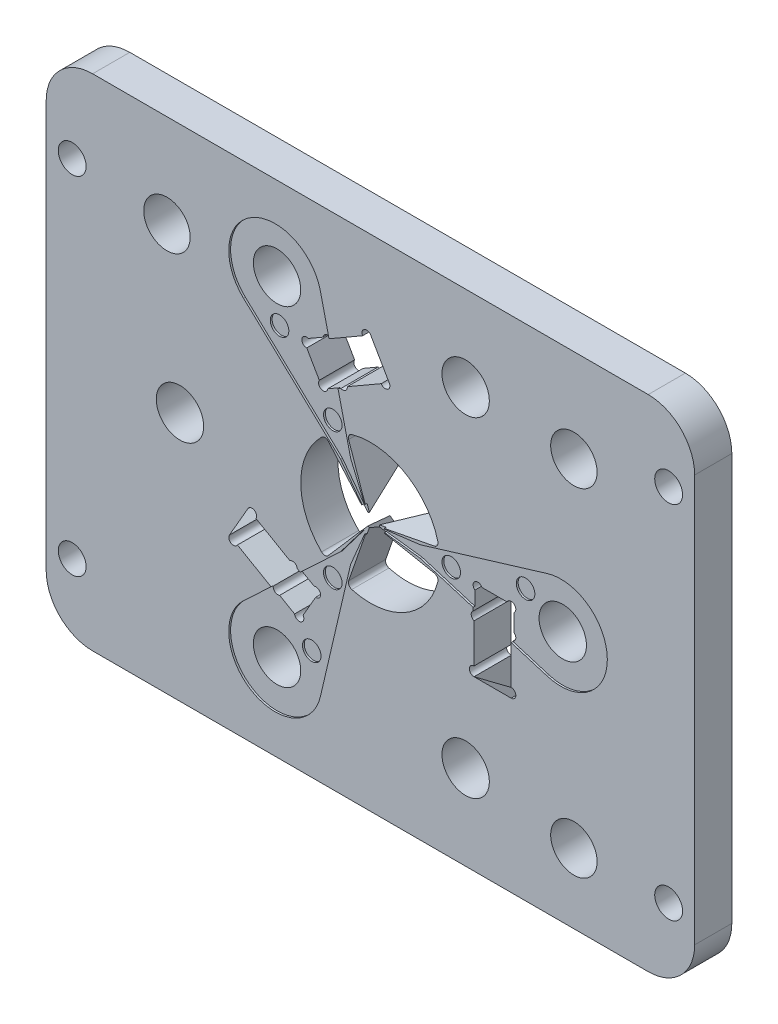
ISO-10303-21;
HEADER;
FILE_DESCRIPTION(('STEP AP214'),'2;1');
FILE_NAME('part.step','',(''),(''),'','','');
FILE_SCHEMA(('AUTOMOTIVE_DESIGN { 1 0 10303 214 1 1 1 1 }'));
ENDSEC;
DATA;
#1=APPLICATION_CONTEXT('core data for automotive mechanical design processes');
#2=APPLICATION_PROTOCOL_DEFINITION('international standard','automotive_design',2000,#1);
#3=PRODUCT_CONTEXT('',#1,'mechanical');
#4=PRODUCT('Part','Part','',(#3));
#5=PRODUCT_RELATED_PRODUCT_CATEGORY('part','',(#4));
#6=PRODUCT_DEFINITION_FORMATION('','',#4);
#7=PRODUCT_DEFINITION_CONTEXT('part definition',#1,'design');
#8=PRODUCT_DEFINITION('design','',#6,#7);
#9=PRODUCT_DEFINITION_SHAPE('','',#8);
#10=(LENGTH_UNIT() NAMED_UNIT(*) SI_UNIT(.MILLI.,.METRE.));
#11=(NAMED_UNIT(*) PLANE_ANGLE_UNIT() SI_UNIT($,.RADIAN.));
#12=(NAMED_UNIT(*) SI_UNIT($,.STERADIAN.) SOLID_ANGLE_UNIT());
#13=UNCERTAINTY_MEASURE_WITH_UNIT(LENGTH_MEASURE(1.E-05),#10,'distance_accuracy_value','');
#14=(GEOMETRIC_REPRESENTATION_CONTEXT(3) GLOBAL_UNCERTAINTY_ASSIGNED_CONTEXT((#13)) GLOBAL_UNIT_ASSIGNED_CONTEXT((#10,
#11,#12)) REPRESENTATION_CONTEXT('',''));
#15=CARTESIAN_POINT('',(0.,0.,0.));
#16=DIRECTION('',(0.,0.,1.));
#17=DIRECTION('',(1.,0.,0.));
#18=AXIS2_PLACEMENT_3D('',#15,#16,#17);
#19=CARTESIAN_POINT('',(0.,0.,4.18));
#20=DIRECTION('',(0.,0.,-1.));
#21=DIRECTION('',(-1.,0.,0.));
#22=AXIS2_PLACEMENT_3D('',#19,#20,#21);
#23=CONICAL_SURFACE('',#22,0.552999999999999,0.523598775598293);
#24=CARTESIAN_POINT('',(-1.89477779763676,-2.28282582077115,-0.000700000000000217));
#25=CARTESIAN_POINT('',(-1.78683342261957,-2.15823274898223,0.284760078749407));
#26=CARTESIAN_POINT('',(-1.67888808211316,-2.03363856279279,0.570219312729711));
#27=CARTESIAN_POINT('',(-1.46298651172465,-1.78443762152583,1.14112825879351));
#28=CARTESIAN_POINT('',(-1.35503028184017,-1.65983086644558,1.42657797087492));
#29=CARTESIAN_POINT('',(-1.13910069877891,-1.41059759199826,1.99745283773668));
#30=CARTESIAN_POINT('',(-1.03112734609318,-1.28597107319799,2.28287799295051));
#31=CARTESIAN_POINT('',(-0.815140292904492,-1.03667146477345,2.85369268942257));
#32=CARTESIAN_POINT('',(-0.70712659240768,-0.911998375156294,3.13908223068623));
#33=CARTESIAN_POINT('',(-0.560231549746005,-0.742447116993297,3.52685492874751));
#34=CARTESIAN_POINT('',(-0.521413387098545,-0.697641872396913,3.62929394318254));
#35=CARTESIAN_POINT('',(-0.443738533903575,-0.607986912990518,3.83413906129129));
#36=CARTESIAN_POINT('',(-0.404881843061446,-0.563137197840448,3.93654516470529));
#37=CARTESIAN_POINT('',(-0.317492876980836,-0.462269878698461,4.1665834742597));
#38=CARTESIAN_POINT('',(-0.268941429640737,-0.406230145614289,4.29419859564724));
#39=CARTESIAN_POINT('',(-0.189792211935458,-0.314873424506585,4.50116381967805));
#40=CARTESIAN_POINT('',(-0.159309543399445,-0.279689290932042,4.58061554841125));
#41=CARTESIAN_POINT('',(-0.109348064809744,-0.222022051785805,4.70931988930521));
#42=CARTESIAN_POINT('',(-0.0900313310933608,-0.199726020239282,4.7587195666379));
#43=CARTESIAN_POINT('',(-0.0580697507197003,-0.162834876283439,4.83860075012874));
#44=CARTESIAN_POINT('',(-0.0456246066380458,-0.148470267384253,4.8692639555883));
#45=CARTESIAN_POINT('',(-0.0287035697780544,-0.12893943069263,4.90907424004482));
#46=CARTESIAN_POINT('',(-0.0246008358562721,-0.124203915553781,4.91858879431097));
#47=CARTESIAN_POINT('',(-0.0162611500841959,-0.114577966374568,4.9374649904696));
#48=CARTESIAN_POINT('',(-0.0120243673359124,-0.109687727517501,4.9468268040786));
#49=CARTESIAN_POINT('',(-0.00488593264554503,-0.10144830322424,4.96196094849));
#50=CARTESIAN_POINT('',(-0.00205397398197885,-0.0981795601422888,4.96780989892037));
#51=CARTESIAN_POINT('',(0.00376734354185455,-0.0914603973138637,4.97935885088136));
#52=CARTESIAN_POINT('',(0.00675720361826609,-0.088009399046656,4.98505828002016));
#53=CARTESIAN_POINT('',(0.0129975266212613,-0.0808066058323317,4.99619685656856));
#54=CARTESIAN_POINT('',(0.0162500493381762,-0.0770524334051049,5.00163327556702));
#55=CARTESIAN_POINT('',(0.0231658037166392,-0.0690700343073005,5.01187720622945));
#56=CARTESIAN_POINT('',(0.0268265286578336,-0.0648447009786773,5.01668820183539));
#57=CARTESIAN_POINT('',(0.0323028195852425,-0.0585237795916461,5.02209355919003));
#58=CARTESIAN_POINT('',(0.0337999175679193,-0.0567957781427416,5.02341602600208));
#59=CARTESIAN_POINT('',(0.0368949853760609,-0.053223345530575,5.02572404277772));
#60=CARTESIAN_POINT('',(0.0384923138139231,-0.0513796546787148,5.02671151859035));
#61=CARTESIAN_POINT('',(0.0414035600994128,-0.048019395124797,5.0280532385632));
#62=CARTESIAN_POINT('',(0.0426985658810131,-0.0465246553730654,5.02850072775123));
#63=CARTESIAN_POINT('',(0.0453356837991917,-0.0434808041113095,5.02908090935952));
#64=CARTESIAN_POINT('',(0.0466781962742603,-0.0419312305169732,5.029209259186));
#65=CARTESIAN_POINT('',(0.0480222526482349,-0.0403798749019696,5.02915021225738));
#66=B_SPLINE_CURVE_WITH_KNOTS('',3,(#24,#25,#26,#27,#28,#29,#30,#31,#32,#33,#34,#35,#36,#37,#38,
#39,#40,#41,#42,#43,#44,#45,#46,#47,#48,#49,#50,#51,#52,#53,#54,#55,#56,#57,#58,#59,#60,#61,#62,
#63,#64,#65),.UNSPECIFIED.,.F.,.F.,(4,2,2,2,2,2,2,2,2,2,2,2,2,2,2,2,2,2,2,2,4),(0.,
0.988921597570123,1.97784340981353,2.96674069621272,3.95563783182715,4.31070547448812,
4.66577585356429,5.10855195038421,5.38480427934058,5.55741778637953,5.66562864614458,
5.69980426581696,5.7339383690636,5.75575929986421,5.777654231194,5.79974162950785,
5.82170017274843,5.82960573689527,5.83746504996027,5.84352374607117,5.84966444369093),.UNSPECIFIED.);
#67=CARTESIAN_POINT('',(-1.89451310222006,-2.28252030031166,0.));
#68=VERTEX_POINT('',#67);
#69=CARTESIAN_POINT('',(-0.456679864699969,-0.622924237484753,3.8));
#70=VERTEX_POINT('',#69);
#71=EDGE_CURVE('E1201',#68,#70,#66,.T.);
#72=ORIENTED_EDGE('',*,*,#71,.T.);
#73=CARTESIAN_POINT('',(0.,0.,3.8));
#74=DIRECTION('',(0.,0.,1.));
#75=DIRECTION('',(1.,0.,0.));
#76=AXIS2_PLACEMENT_3D('',#73,#74,#75);
#77=CIRCLE('',#76,0.772393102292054);
#78=CARTESIAN_POINT('',(-0.311128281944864,-0.706958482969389,3.8));
#79=VERTEX_POINT('',#78);
#80=EDGE_CURVE('E2125',#70,#79,#77,.T.);
#81=ORIENTED_EDGE('',*,*,#80,.T.);
#82=CARTESIAN_POINT('',(-0.0590417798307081,0.0212233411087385,5.02915447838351));
#83=CARTESIAN_POINT('',(-0.0598455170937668,0.0189016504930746,5.02921586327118));
#84=CARTESIAN_POINT('',(-0.0606457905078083,0.0165899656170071,5.02900509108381));
#85=CARTESIAN_POINT('',(-0.0622031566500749,0.0120913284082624,5.02814046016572));
#86=CARTESIAN_POINT('',(-0.0629608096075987,0.00990275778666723,5.02749631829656));
#87=CARTESIAN_POINT('',(-0.0647266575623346,0.0048018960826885,5.02553481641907));
#88=CARTESIAN_POINT('',(-0.0657143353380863,0.00194887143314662,5.02405145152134));
#89=CARTESIAN_POINT('',(-0.0676148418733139,-0.00354096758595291,5.02064736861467));
#90=CARTESIAN_POINT('',(-0.0685267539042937,-0.00617513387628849,5.01872212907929));
#91=CARTESIAN_POINT('',(-0.0711406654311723,-0.0137257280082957,5.0126076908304));
#92=CARTESIAN_POINT('',(-0.0727459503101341,-0.0183627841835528,5.00804155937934));
#93=CARTESIAN_POINT('',(-0.075809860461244,-0.0272132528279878,4.99846350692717));
#94=CARTESIAN_POINT('',(-0.0772678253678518,-0.0314247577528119,4.99344975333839));
#95=CARTESIAN_POINT('',(-0.0801013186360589,-0.0396096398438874,4.98314526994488));
#96=CARTESIAN_POINT('',(-0.0814761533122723,-0.0435810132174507,4.97785275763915));
#97=CARTESIAN_POINT('',(-0.0841609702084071,-0.0513364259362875,4.96713711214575));
#98=CARTESIAN_POINT('',(-0.0854710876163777,-0.0551208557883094,4.96171428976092));
#99=CARTESIAN_POINT('',(-0.0892868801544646,-0.0661432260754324,4.94553249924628));
#100=CARTESIAN_POINT('',(-0.0917338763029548,-0.0732116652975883,4.93464469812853));
#101=CARTESIAN_POINT('',(-0.0965432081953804,-0.0871039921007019,4.91269506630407));
#102=CARTESIAN_POINT('',(-0.0989055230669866,-0.0939278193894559,4.90163319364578));
#103=CARTESIAN_POINT('',(-0.10592244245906,-0.114197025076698,4.86826957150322));
#104=CARTESIAN_POINT('',(-0.110500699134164,-0.127421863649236,4.84581811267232));
#105=CARTESIAN_POINT('',(-0.119536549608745,-0.153522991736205,4.80090927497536));
#106=CARTESIAN_POINT('',(-0.123994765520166,-0.166401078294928,4.778453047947));
#107=CARTESIAN_POINT('',(-0.132858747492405,-0.192005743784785,4.73346251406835));
#108=CARTESIAN_POINT('',(-0.137264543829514,-0.204732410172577,4.7109282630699));
#109=CARTESIAN_POINT('',(-0.150435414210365,-0.242778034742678,4.64326613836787));
#110=CARTESIAN_POINT('',(-0.159157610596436,-0.267973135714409,4.59806051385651));
#111=CARTESIAN_POINT('',(-0.176552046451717,-0.318219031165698,4.50755917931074));
#112=CARTESIAN_POINT('',(-0.185224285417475,-0.34326982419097,4.46226346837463));
#113=CARTESIAN_POINT('',(-0.211205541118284,-0.418319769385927,4.32628321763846));
#114=CARTESIAN_POINT('',(-0.228474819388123,-0.468204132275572,4.23552776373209));
#115=CARTESIAN_POINT('',(-0.263030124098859,-0.568021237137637,4.05366115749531));
#116=CARTESIAN_POINT('',(-0.280316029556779,-0.617953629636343,3.96254979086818));
#117=CARTESIAN_POINT('',(-0.314865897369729,-0.717755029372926,3.78029808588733));
#118=CARTESIAN_POINT('',(-0.332129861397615,-0.767624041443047,3.68915775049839));
#119=CARTESIAN_POINT('',(-0.406360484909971,-0.982048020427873,3.29712659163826));
#120=CARTESIAN_POINT('',(-0.463277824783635,-1.14646052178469,2.99614854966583));
#121=CARTESIAN_POINT('',(-0.577090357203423,-1.47522154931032,2.39413901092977));
#122=CARTESIAN_POINT('',(-0.633985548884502,-1.63957007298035,2.09310751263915));
#123=CARTESIAN_POINT('',(-0.747337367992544,-1.96700027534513,1.49328001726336));
#124=CARTESIAN_POINT('',(-0.80379408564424,-2.13008221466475,1.19448417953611));
#125=CARTESIAN_POINT('',(-0.916699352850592,-2.45622249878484,0.596892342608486));
#126=CARTESIAN_POINT('',(-0.973147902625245,-2.61928084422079,0.298096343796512));
#127=CARTESIAN_POINT('',(-1.0295962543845,-2.78233861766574,-0.00069999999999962));
#128=B_SPLINE_CURVE_WITH_KNOTS('',3,(#82,#83,#84,#85,#86,#87,#88,#89,#90,#91,#92,#93,#94,#95,
#96,#97,#98,#99,#100,#101,#102,#103,#104,#105,#106,#107,#108,#109,#110,#111,#112,#113,#114,#115,
#116,#117,#118,#119,#120,#121,#122,#123,#124,#125,#126,#127),.UNSPECIFIED.,.F.,.F.,(4,2,2,2,2,2,
2,2,2,2,2,2,2,2,2,2,2,2,2,2,2,2,4),(0.,0.00733305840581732,0.0145069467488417,
0.0245404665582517,0.0346816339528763,0.0547121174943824,0.074828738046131,0.0950949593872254,
0.115316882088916,0.154936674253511,0.194566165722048,0.273927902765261,0.352731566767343,
0.4314872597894,0.588934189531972,0.746382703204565,1.06135703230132,1.37733165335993,
1.69328053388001,2.73622318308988,3.77920313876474,4.81436413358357,5.84948808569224),.UNSPECIFIED.);
#129=CARTESIAN_POINT('',(-1.02946401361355,-2.78195662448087,0.));
#130=VERTEX_POINT('',#129);
#131=EDGE_CURVE('E1170',#79,#130,#128,.T.);
#132=ORIENTED_EDGE('',*,*,#131,.T.);
#133=CARTESIAN_POINT('',(0.,0.,0.));
#134=DIRECTION('',(0.,0.,-1.));
#135=DIRECTION('',(-1.,0.,0.));
#136=AXIS2_PLACEMENT_3D('',#133,#134,#135);
#137=CIRCLE('',#136,2.9663241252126);
#138=EDGE_CURVE('E1778',#130,#68,#137,.T.);
#139=ORIENTED_EDGE('',*,*,#138,.T.);
#140=EDGE_LOOP('',(#72,#81,#132,#139));
#141=FACE_BOUND('',#140,.T.);
#142=ADVANCED_FACE('F402',(#141),#23,.F.);
#143=CARTESIAN_POINT('',(0.,0.,3.8));
#144=DIRECTION('',(0.,0.,1.));
#145=DIRECTION('',(1.,0.,0.));
#146=AXIS2_PLACEMENT_3D('',#143,#144,#145);
#147=CIRCLE('',#146,0.772393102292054);
#148=CARTESIAN_POINT('',(0.767808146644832,-0.0840342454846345,3.8));
#149=VERTEX_POINT('',#148);
#150=CARTESIAN_POINT('',(0.767808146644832,0.0840342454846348,3.8));
#151=VERTEX_POINT('',#150);
#152=EDGE_CURVE('E2020',#149,#151,#147,.T.);
#153=ORIENTED_EDGE('',*,*,#152,.T.);
#154=CARTESIAN_POINT('',(0.0111683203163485,-0.0617380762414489,5.0291550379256));
#155=CARTESIAN_POINT('',(0.0135823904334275,-0.0612729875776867,5.02921454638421));
#156=CARTESIAN_POINT('',(0.0159857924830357,-0.0608099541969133,5.02900160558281));
#157=CARTESIAN_POINT('',(0.0206625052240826,-0.0599089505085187,5.02813247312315));
#158=CARTESIAN_POINT('',(0.0229375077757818,-0.0594706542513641,5.02748601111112));
#159=CARTESIAN_POINT('',(0.0282423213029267,-0.0584486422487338,5.02551808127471));
#160=CARTESIAN_POINT('',(0.0312101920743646,-0.0578768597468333,5.0240300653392));
#161=CARTESIAN_POINT('',(0.036920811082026,-0.0567766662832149,5.02061640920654));
#162=CARTESIAN_POINT('',(0.0396607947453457,-0.0562487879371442,5.01868623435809));
#163=CARTESIAN_POINT('',(0.0475274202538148,-0.0547332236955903,5.01254726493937));
#164=CARTESIAN_POINT('',(0.0523615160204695,-0.0538018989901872,5.00795915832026));
#165=CARTESIAN_POINT('',(0.0615878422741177,-0.0520243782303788,4.9983361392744));
#166=CARTESIAN_POINT('',(0.0659780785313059,-0.0511785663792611,4.99329938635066));
#167=CARTESIAN_POINT('',(0.0745104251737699,-0.0495347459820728,4.98294845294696));
#168=CARTESIAN_POINT('',(0.0786504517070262,-0.0487371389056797,4.97763249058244));
#169=CARTESIAN_POINT('',(0.0867354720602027,-0.0471794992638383,4.96686994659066));
#170=CARTESIAN_POINT('',(0.0906808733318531,-0.0464193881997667,4.96142367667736));
#171=CARTESIAN_POINT('',(0.102172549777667,-0.0442054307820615,4.94517239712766));
#172=CARTESIAN_POINT('',(0.109542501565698,-0.0427855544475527,4.93423853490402));
#173=CARTESIAN_POINT('',(0.124028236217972,-0.0399947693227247,4.91219687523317));
#174=CARTESIAN_POINT('',(0.131143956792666,-0.0386238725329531,4.90108903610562));
#175=CARTESIAN_POINT('',(0.152281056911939,-0.0345516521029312,4.86758755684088));
#176=CARTESIAN_POINT('',(0.166073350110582,-0.0318944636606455,4.84504434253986));
#177=CARTESIAN_POINT('',(0.193295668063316,-0.0266498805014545,4.7999529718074));
#178=CARTESIAN_POINT('',(0.206727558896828,-0.0240621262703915,4.7774059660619));
#179=CARTESIAN_POINT('',(0.233434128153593,-0.0189169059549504,4.73223405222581));
#180=CARTESIAN_POINT('',(0.246708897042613,-0.0163594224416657,4.70960919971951));
#181=CARTESIAN_POINT('',(0.286394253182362,-0.00871374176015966,4.64167469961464));
#182=CARTESIAN_POINT('',(0.312676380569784,-0.00365029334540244,4.59628746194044));
#183=CARTESIAN_POINT('',(0.365091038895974,0.00644778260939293,4.50542312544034));
#184=CARTESIAN_POINT('',(0.391223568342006,0.011482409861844,4.45994602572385));
#185=CARTESIAN_POINT('',(0.46951503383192,0.026565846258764,4.32342179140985));
#186=CARTESIAN_POINT('',(0.521555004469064,0.0365917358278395,4.23230393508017));
#187=CARTESIAN_POINT('',(0.625686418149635,0.0566534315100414,4.04971121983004));
#188=CARTESIAN_POINT('',(0.677777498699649,0.0666891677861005,3.95823614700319));
#189=CARTESIAN_POINT('',(0.78189399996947,0.086747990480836,3.77525714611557));
#190=CARTESIAN_POINT('',(0.833919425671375,0.096771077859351,3.68375322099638));
#191=CARTESIAN_POINT('',(1.05665835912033,0.139683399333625,3.29184303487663));
#192=CARTESIAN_POINT('',(1.22722597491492,0.172544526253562,2.99135082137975));
#193=CARTESIAN_POINT('',(1.56829509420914,0.238254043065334,2.39031325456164));
#194=CARTESIAN_POINT('',(1.73879659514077,0.271102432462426,2.08976789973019));
#195=CARTESIAN_POINT('',(2.07848950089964,0.336546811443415,1.49090214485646));
#196=CARTESIAN_POINT('',(2.24768117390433,0.369142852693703,1.19258190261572));
#197=CARTESIAN_POINT('',(2.58604012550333,0.434330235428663,0.595941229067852));
#198=CARTESIAN_POINT('',(2.75520740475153,0.466921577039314,0.297620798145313));
#199=CARTESIAN_POINT('',(2.92437405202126,0.499512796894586,-0.000699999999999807));
#200=B_SPLINE_CURVE_WITH_KNOTS('',3,(#154,#155,#156,#157,#158,#159,#160,#161,#162,#163,#164,
#165,#166,#167,#168,#169,#170,#171,#172,#173,#174,#175,#176,#177,#178,#179,#180,#181,#182,#183,
#184,#185,#186,#187,#188,#189,#190,#191,#192,#193,#194,#195,#196,#197,#198,#199),.UNSPECIFIED.,
.F.,.F.,(4,2,2,2,2,2,2,2,2,2,2,2,2,2,2,2,2,2,2,2,2,2,4),(0.,0.00733755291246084,
0.0145157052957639,0.0245641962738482,0.0347207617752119,0.0548307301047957,0.0750273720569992,
0.0953739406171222,0.115675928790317,0.15545290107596,0.195239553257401,0.274915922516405,
0.354031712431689,0.433099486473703,0.591173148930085,0.749248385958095,1.06547619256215,
1.38270952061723,1.69991712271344,2.7411752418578,3.78247040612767,4.81598364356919,
5.84946009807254),.UNSPECIFIED.);
#201=CARTESIAN_POINT('',(2.92397711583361,0.499436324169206,0.));
#202=VERTEX_POINT('',#201);
#203=EDGE_CURVE('E1217',#151,#202,#200,.T.);
#204=ORIENTED_EDGE('',*,*,#203,.T.);
#205=CARTESIAN_POINT('',(2.92397711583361,-0.499436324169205,0.));
#206=VERTEX_POINT('',#205);
#207=EDGE_CURVE('E1780',#202,#206,#137,.T.);
#208=ORIENTED_EDGE('',*,*,#207,.T.);
#209=CARTESIAN_POINT('',(2.92437405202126,-0.499512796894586,-0.000699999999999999));
#210=CARTESIAN_POINT('',(2.76250099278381,-0.468326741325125,0.284760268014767));
#211=CARTESIAN_POINT('',(2.60062648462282,-0.437140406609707,0.570219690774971));
#212=CARTESIAN_POINT('',(2.27686113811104,-0.374764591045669,1.14112901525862));
#213=CARTESIAN_POINT('',(2.11497029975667,-0.343575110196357,1.42657891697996));
#214=CARTESIAN_POINT('',(1.79116316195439,-0.281191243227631,1.99745378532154));
#215=CARTESIAN_POINT('',(1.62924686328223,-0.24999685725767,2.28287875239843));
#216=CARTESIAN_POINT('',(1.30535375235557,-0.187596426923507,2.8536930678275));
#217=CARTESIAN_POINT('',(1.14337694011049,-0.15639038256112,3.13908241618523));
#218=CARTESIAN_POINT('',(0.922908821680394,-0.113915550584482,3.52718062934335));
#219=CARTESIAN_POINT('',(0.864512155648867,-0.102664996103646,3.62994529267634));
#220=CARTESIAN_POINT('',(0.747660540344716,-0.0801526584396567,3.83544147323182));
#221=CARTESIAN_POINT('',(0.689205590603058,-0.0688908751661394,3.93817299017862));
#222=CARTESIAN_POINT('',(0.55788088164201,-0.0435901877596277,4.1686929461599));
#223=CARTESIAN_POINT('',(0.484982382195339,-0.0295457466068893,4.29646430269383));
#224=CARTESIAN_POINT('',(0.366225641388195,-0.00666637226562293,4.50352671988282));
#225=CARTESIAN_POINT('',(0.320542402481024,0.00213484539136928,4.58292080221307));
#226=CARTESIAN_POINT('',(0.245713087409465,0.0165512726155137,4.71143293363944));
#227=CARTESIAN_POINT('',(0.216813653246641,0.0221189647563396,4.76070027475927));
#228=CARTESIAN_POINT('',(0.169018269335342,0.031327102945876,4.84030452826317));
#229=CARTESIAN_POINT('',(0.150426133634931,0.0349090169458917,4.87082581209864));
#230=CARTESIAN_POINT('',(0.125144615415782,0.0397796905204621,4.91042698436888));
#231=CARTESIAN_POINT('',(0.119021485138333,0.0409593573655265,4.91987927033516));
#232=CARTESIAN_POINT('',(0.106572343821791,0.0433577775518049,4.93862882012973));
#233=CARTESIAN_POINT('',(0.100246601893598,0.0445764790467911,4.94792626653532));
#234=CARTESIAN_POINT('',(0.0895901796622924,0.0466295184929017,4.96294391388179));
#235=CARTESIAN_POINT('',(0.0853652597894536,0.0474434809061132,4.96874189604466));
#236=CARTESIAN_POINT('',(0.0766769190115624,0.0491173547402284,4.98018778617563));
#237=CARTESIAN_POINT('',(0.0722127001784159,0.0499774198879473,4.98583508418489));
#238=CARTESIAN_POINT('',(0.0628891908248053,0.0517736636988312,4.99686703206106));
#239=CARTESIAN_POINT('',(0.0580266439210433,0.0527104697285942,5.00224878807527));
#240=CARTESIAN_POINT('',(0.0476810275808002,0.0547036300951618,5.01237119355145));
#241=CARTESIAN_POINT('',(0.0422020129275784,0.0557592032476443,5.01711562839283));
#242=CARTESIAN_POINT('',(0.0340054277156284,0.0573383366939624,5.022411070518));
#243=CARTESIAN_POINT('',(0.0317648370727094,0.0577700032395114,5.02370250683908));
#244=CARTESIAN_POINT('',(0.027133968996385,0.0586621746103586,5.02594443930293));
#245=CARTESIAN_POINT('',(0.0247446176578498,0.0591225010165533,5.02689683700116));
#246=CARTESIAN_POINT('',(0.0204954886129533,0.0599411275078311,5.02814534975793));
#247=CARTESIAN_POINT('',(0.0186668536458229,0.0602934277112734,5.02854922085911));
#248=CARTESIAN_POINT('',(0.0149493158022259,0.0610096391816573,5.02907733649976));
#249=CARTESIAN_POINT('',(0.013059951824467,0.0613736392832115,5.02919814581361));
#250=CARTESIAN_POINT('',(0.0111683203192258,0.0617380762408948,5.02915503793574));
#251=B_SPLINE_CURVE_WITH_KNOTS('',3,(#209,#210,#211,#212,#213,#214,#215,#216,#217,#218,#219,
#220,#221,#222,#223,#224,#225,#226,#227,#228,#229,#230,#231,#232,#233,#234,#235,#236,#237,#238,
#239,#240,#241,#242,#243,#244,#245,#246,#247,#248,#249,#250),.UNSPECIFIED.,.F.,.F.,(4,2,2,2,2,2,
2,2,2,2,2,2,2,2,2,2,2,2,2,2,4),(0.,0.988922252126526,1.97784472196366,2.96674135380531,
3.95563783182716,4.3118343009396,4.66803366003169,5.11135465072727,5.38741372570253,
5.55958013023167,5.66731511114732,5.70128544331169,5.73521238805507,5.75687062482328,
5.77860621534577,5.80054174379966,5.82234060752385,5.83018768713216,5.83799003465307,
5.84368632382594,5.84945139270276),.UNSPECIFIED.);
#252=EDGE_CURVE('E1210',#206,#149,#251,.T.);
#253=ORIENTED_EDGE('',*,*,#252,.T.);
#254=EDGE_LOOP('',(#153,#204,#208,#253));
#255=FACE_BOUND('',#254,.T.);
#256=ADVANCED_FACE('F1188',(#255),#23,.F.);
#257=CARTESIAN_POINT('',(-1.0295962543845,2.78233861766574,-0.000699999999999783));
#258=CARTESIAN_POINT('',(-0.975667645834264,2.62655942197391,0.28476024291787));
#259=CARTESIAN_POINT('',(-0.921738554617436,2.47077883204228,0.570219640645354));
#260=CARTESIAN_POINT('',(-0.813874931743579,2.15920193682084,1.14112891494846));
#261=CARTESIAN_POINT('',(-0.759940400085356,2.00340563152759,1.42657879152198));
#262=CARTESIAN_POINT('',(-0.652062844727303,1.69178849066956,1.99745365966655));
#263=CARTESIAN_POINT('',(-0.598119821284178,1.5359676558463,2.28287865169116));
#264=CARTESIAN_POINT('',(-0.490213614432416,1.2242677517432,2.85369301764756));
#265=CARTESIAN_POINT('',(-0.436250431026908,1.06838868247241,3.13908239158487));
#266=CARTESIAN_POINT('',(-0.362808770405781,0.856243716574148,3.52713772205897));
#267=CARTESIAN_POINT('',(-0.343361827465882,0.80006891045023,3.62985948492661));
#268=CARTESIAN_POINT('',(-0.304448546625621,0.687663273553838,3.83526989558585));
#269=CARTESIAN_POINT('',(-0.284982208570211,0.631432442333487,3.93795854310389));
#270=CARTESIAN_POINT('',(-0.241243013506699,0.505086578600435,4.16841513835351));
#271=CARTESIAN_POINT('',(-0.216960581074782,0.434943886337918,4.2961660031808));
#272=CARTESIAN_POINT('',(-0.177399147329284,0.320665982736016,4.50321578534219));
#273=CARTESIAN_POINT('',(-0.162178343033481,0.276698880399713,4.58261753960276));
#274=CARTESIAN_POINT('',(-0.137244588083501,0.204674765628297,4.71115511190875));
#275=CARTESIAN_POINT('',(-0.127613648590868,0.176854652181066,4.76043992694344));
#276=CARTESIAN_POINT('',(-0.111684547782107,0.130841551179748,4.84008071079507));
#277=CARTESIAN_POINT('',(-0.105487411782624,0.112940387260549,4.87062069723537));
#278=CARTESIAN_POINT('',(-0.0970606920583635,0.0885988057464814,4.91024941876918));
#279=CARTESIAN_POINT('',(-0.0950194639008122,0.0827024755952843,4.91970989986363));
#280=CARTESIAN_POINT('',(-0.0908694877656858,0.0707147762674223,4.93847611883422));
#281=CARTESIAN_POINT('',(-0.0887608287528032,0.0646236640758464,4.94778203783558));
#282=CARTESIAN_POINT('',(-0.0852084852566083,0.0543622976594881,4.96281501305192));
#283=CARTESIAN_POINT('',(-0.0837999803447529,0.0502936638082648,4.96861969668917));
#284=CARTESIAN_POINT('',(-0.0809036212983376,0.0419271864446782,4.98007913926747));
#285=CARTESIAN_POINT('',(-0.0794155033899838,0.037628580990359,4.98573329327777));
#286=CARTESIAN_POINT('',(-0.0763078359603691,0.0286517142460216,4.99677926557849));
#287=CARTESIAN_POINT('',(-0.0746872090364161,0.0239703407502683,5.00216821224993));
#288=CARTESIAN_POINT('',(-0.0712394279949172,0.0140110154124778,5.01230661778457));
#289=CARTESIAN_POINT('',(-0.0694136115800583,0.00873692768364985,5.01705982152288));
#290=CARTESIAN_POINT('',(-0.0666822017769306,0.000846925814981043,5.02236973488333));
#291=CARTESIAN_POINT('',(-0.065935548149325,-0.00130987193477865,5.02366525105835));
#292=CARTESIAN_POINT('',(-0.0643922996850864,-0.00576772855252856,5.02591587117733));
#293=CARTESIAN_POINT('',(-0.0635960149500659,-0.00806789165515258,5.02687287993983));
#294=CARTESIAN_POINT('',(-0.0621752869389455,-0.0121718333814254,5.02813348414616));
#295=CARTESIAN_POINT('',(-0.0615611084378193,-0.0139459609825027,5.02854295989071));
#296=CARTESIAN_POINT('',(-0.0603122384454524,-0.0175534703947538,5.02907777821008));
#297=CARTESIAN_POINT('',(-0.059677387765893,-0.0193873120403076,5.02919957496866));
#298=CARTESIAN_POINT('',(-0.0590417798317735,-0.0212233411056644,5.02915447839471));
#299=B_SPLINE_CURVE_WITH_KNOTS('',3,(#257,#258,#259,#260,#261,#262,#263,#264,#265,#266,#267,
#268,#269,#270,#271,#272,#273,#274,#275,#276,#277,#278,#279,#280,#281,#282,#283,#284,#285,#286,
#287,#288,#289,#290,#291,#292,#293,#294,#295,#296,#297,#298),.UNSPECIFIED.,.F.,.F.,(4,2,2,2,2,2,
2,2,2,2,2,2,2,2,2,2,2,2,2,2,4),(0.,0.98892216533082,1.97784454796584,2.96674126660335,
3.95563783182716,4.31168559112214,4.66773621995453,5.11098573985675,5.3870705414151,
5.55929598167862,5.66709367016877,5.70109101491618,5.73504521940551,5.75672483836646,
5.77848136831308,5.80043684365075,5.82225668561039,5.83011139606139,5.83792117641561,
5.84366500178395,5.84947926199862),.UNSPECIFIED.);
#300=CARTESIAN_POINT('',(-1.02946401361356,2.78195662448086,0.));
#301=VERTEX_POINT('',#300);
#302=CARTESIAN_POINT('',(-0.311128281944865,0.706958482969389,3.8));
#303=VERTEX_POINT('',#302);
#304=EDGE_CURVE('E1224',#301,#303,#299,.T.);
#305=ORIENTED_EDGE('',*,*,#304,.T.);
#306=CARTESIAN_POINT('',(0.,0.,3.8));
#307=DIRECTION('',(0.,0.,1.));
#308=DIRECTION('',(1.,0.,0.));
#309=AXIS2_PLACEMENT_3D('',#306,#307,#308);
#310=CIRCLE('',#309,0.772393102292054);
#311=CARTESIAN_POINT('',(-0.456679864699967,0.622924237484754,3.8));
#312=VERTEX_POINT('',#311);
#313=EDGE_CURVE('E1178',#303,#312,#310,.T.);
#314=ORIENTED_EDGE('',*,*,#313,.T.);
#315=CARTESIAN_POINT('',(0.0480222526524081,0.0403798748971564,5.0291502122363));
#316=CARTESIAN_POINT('',(0.0464203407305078,0.042228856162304,5.02922400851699));
#317=CARTESIAN_POINT('',(0.0448241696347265,0.0440712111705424,5.02902759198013));
#318=CARTESIAN_POINT('',(0.0417161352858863,0.0476586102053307,5.02819277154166));
#319=CARTESIAN_POINT('',(0.0402031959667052,0.0494048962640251,5.02756399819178));
#320=CARTESIAN_POINT('',(0.0366880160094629,0.0534622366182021,5.02564491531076));
#321=CARTESIAN_POINT('',(0.0347252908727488,0.0557276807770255,5.02419218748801));
#322=CARTESIAN_POINT('',(0.0309476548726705,0.0600879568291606,5.02085116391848));
#323=CARTESIAN_POINT('',(0.0291345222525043,0.0621807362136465,5.01895843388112));
#324=CARTESIAN_POINT('',(0.0239924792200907,0.0681158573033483,5.01300408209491));
#325=CARTESIAN_POINT('',(0.020847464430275,0.0717459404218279,5.00858100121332));
#326=CARTESIAN_POINT('',(0.0148437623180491,0.0786756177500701,4.99929576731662));
#327=CARTESIAN_POINT('',(0.0119863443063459,0.0819737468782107,4.99443183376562));
#328=CARTESIAN_POINT('',(0.00643350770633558,0.0883830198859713,4.9844299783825));
#329=CARTESIAN_POINT('',(0.00373946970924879,0.0914925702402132,4.97929027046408));
#330=CARTESIAN_POINT('',(-0.00152043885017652,0.0975637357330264,4.96888024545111));
#331=CARTESIAN_POINT('',(-0.0040865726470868,0.1005256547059,4.96361023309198));
#332=CARTESIAN_POINT('',(-0.011558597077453,0.109150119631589,4.94788128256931));
#333=CARTESIAN_POINT('',(-0.0163478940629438,0.11467808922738,4.93729364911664));
#334=CARTESIAN_POINT('',(-0.0257572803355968,0.125538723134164,4.915943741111));
#335=CARTESIAN_POINT('',(-0.0303773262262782,0.130871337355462,4.90518142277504));
#336=CARTESIAN_POINT('',(-0.0440967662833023,0.146706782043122,4.87271617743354));
#337=CARTESIAN_POINT('',(-0.0530430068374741,0.157032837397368,4.85086265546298));
#338=CARTESIAN_POINT('',(-0.0706943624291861,0.17740663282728,4.80714322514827));
#339=CARTESIAN_POINT('',(-0.0794007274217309,0.187455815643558,4.78527847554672));
#340=CARTESIAN_POINT('',(-0.0967074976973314,0.207431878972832,4.74146972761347));
#341=CARTESIAN_POINT('',(-0.10530796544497,0.217358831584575,4.71952578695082));
#342=CARTESIAN_POINT('',(-0.131013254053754,0.247028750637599,4.6536383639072));
#343=CARTESIAN_POINT('',(-0.148031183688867,0.266671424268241,4.609616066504));
#344=CARTESIAN_POINT('',(-0.181965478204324,0.305839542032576,4.52147989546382));
#345=CARTESIAN_POINT('',(-0.198881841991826,0.325364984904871,4.47736602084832));
#346=CARTESIAN_POINT('',(-0.249558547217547,0.383857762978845,4.34493005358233));
#347=CARTESIAN_POINT('',(-0.283237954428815,0.422731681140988,4.25653576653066));
#348=CARTESIAN_POINT('',(-0.350624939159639,0.500512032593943,4.07940022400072));
#349=CARTESIAN_POINT('',(-0.384332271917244,0.53941818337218,3.99065875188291));
#350=CARTESIAN_POINT('',(-0.451702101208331,0.617178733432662,3.81314605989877));
#351=CARTESIAN_POINT('',(-0.485364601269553,0.656033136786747,3.72437484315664));
#352=CARTESIAN_POINT('',(-0.634263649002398,0.827897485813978,3.33155615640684));
#353=CARTESIAN_POINT('',(-0.749391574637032,0.960782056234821,3.02741270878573));
#354=CARTESIAN_POINT('',(-0.979601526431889,1.22649821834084,2.41907029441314));
#355=CARTESIAN_POINT('',(-1.09468355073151,1.35932980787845,2.11487132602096));
#356=CARTESIAN_POINT('',(-1.32394260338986,1.62394840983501,1.50877683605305));
#357=CARTESIAN_POINT('',(-1.43811982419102,1.75573564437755,1.2068814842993));
#358=CARTESIAN_POINT('',(-1.66645736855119,2.0192906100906,0.603090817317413));
#359=CARTESIAN_POINT('',(-1.78061769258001,2.15105834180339,0.301195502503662));
#360=CARTESIAN_POINT('',(-1.89477779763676,2.28282582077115,-0.000699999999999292));
#361=B_SPLINE_CURVE_WITH_KNOTS('',3,(#315,#316,#317,#318,#319,#320,#321,#322,#323,#324,#325,
#326,#327,#328,#329,#330,#331,#332,#333,#334,#335,#336,#337,#338,#339,#340,#341,#342,#343,#344,
#345,#346,#347,#348,#349,#350,#351,#352,#353,#354,#355,#356,#357,#358,#359,#360),.UNSPECIFIED.,
.F.,.F.,(4,2,2,2,2,2,2,2,2,2,2,2,2,2,2,2,2,2,2,2,2,2,4),(0.,0.00730349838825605,
0.0144493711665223,0.0243844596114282,0.0344243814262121,0.0539369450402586,0.073532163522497,
0.0932748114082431,0.112974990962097,0.151570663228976,0.190176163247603,0.267487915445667,
0.344258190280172,0.420980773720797,0.574344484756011,0.727709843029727,1.03451768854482,
1.34229083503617,1.6500381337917,2.70395638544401,3.75791372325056,4.80381335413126,
5.84967417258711),.UNSPECIFIED.);
#362=CARTESIAN_POINT('',(-1.89451310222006,2.28252030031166,0.));
#363=VERTEX_POINT('',#362);
#364=EDGE_CURVE('E1231',#312,#363,#361,.T.);
#365=ORIENTED_EDGE('',*,*,#364,.T.);
#366=EDGE_CURVE('E1779',#363,#301,#137,.T.);
#367=ORIENTED_EDGE('',*,*,#366,.T.);
#368=EDGE_LOOP('',(#305,#314,#365,#367));
#369=FACE_BOUND('',#368,.T.);
#370=ADVANCED_FACE('F1190',(#369),#23,.F.);
#371=CARTESIAN_POINT('',(20.5,0.,0.));
#372=DIRECTION('',(0.,0.,1.));
#373=DIRECTION('',(1.,0.,0.));
#374=AXIS2_PLACEMENT_3D('',#371,#372,#373);
#375=CYLINDRICAL_SURFACE('',#374,2.55);
#376=CARTESIAN_POINT('',(20.5,0.,0.));
#377=DIRECTION('',(0.,0.,1.));
#378=DIRECTION('',(1.,0.,0.));
#379=AXIS2_PLACEMENT_3D('',#376,#377,#378);
#380=CIRCLE('',#379,2.55);
#381=CARTESIAN_POINT('',(23.05,0.,0.));
#382=VERTEX_POINT('',#381);
#383=EDGE_CURVE('E1142',#382,#382,#380,.T.);
#384=ORIENTED_EDGE('',*,*,#383,.F.);
#385=EDGE_LOOP('',(#384));
#386=FACE_BOUND('',#385,.T.);
#387=CARTESIAN_POINT('',(20.5,0.,3.8));
#388=DIRECTION('',(0.,0.,1.));
#389=DIRECTION('',(1.,0.,0.));
#390=AXIS2_PLACEMENT_3D('',#387,#388,#389);
#391=CIRCLE('',#390,2.55);
#392=CARTESIAN_POINT('',(23.05,0.,3.8));
#393=VERTEX_POINT('',#392);
#394=EDGE_CURVE('E1750',#393,#393,#391,.F.);
#395=ORIENTED_EDGE('',*,*,#394,.F.);
#396=EDGE_LOOP('',(#395));
#397=FACE_BOUND('',#396,.T.);
#398=ADVANCED_FACE('F2920',(#386,#397),#375,.F.);
#399=CARTESIAN_POINT('',(-10.2500000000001,-17.7535207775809,0.));
#400=DIRECTION('',(0.,0.,1.));
#401=DIRECTION('',(1.,0.,0.));
#402=AXIS2_PLACEMENT_3D('',#399,#400,#401);
#403=CYLINDRICAL_SURFACE('',#402,2.55);
#404=CARTESIAN_POINT('',(-10.2500000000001,-17.7535207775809,0.));
#405=DIRECTION('',(0.,0.,1.));
#406=DIRECTION('',(1.,0.,0.));
#407=AXIS2_PLACEMENT_3D('',#404,#405,#406);
#408=CIRCLE('',#407,2.55);
#409=CARTESIAN_POINT('',(-7.70000000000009,-17.7535207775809,0.));
#410=VERTEX_POINT('',#409);
#411=EDGE_CURVE('E1146',#410,#410,#408,.T.);
#412=ORIENTED_EDGE('',*,*,#411,.F.);
#413=EDGE_LOOP('',(#412));
#414=FACE_BOUND('',#413,.T.);
#415=CARTESIAN_POINT('',(-10.2500000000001,-17.7535207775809,3.8));
#416=DIRECTION('',(0.,0.,1.));
#417=DIRECTION('',(1.,0.,0.));
#418=AXIS2_PLACEMENT_3D('',#415,#416,#417);
#419=CIRCLE('',#418,2.55);
#420=CARTESIAN_POINT('',(-7.70000000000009,-17.7535207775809,3.8));
#421=VERTEX_POINT('',#420);
#422=EDGE_CURVE('E1769',#421,#421,#419,.F.);
#423=ORIENTED_EDGE('',*,*,#422,.F.);
#424=EDGE_LOOP('',(#423));
#425=FACE_BOUND('',#424,.T.);
#426=ADVANCED_FACE('F2907',(#414,#425),#403,.F.);
#427=CARTESIAN_POINT('',(-10.2499999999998,17.7535207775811,0.));
#428=DIRECTION('',(0.,0.,1.));
#429=DIRECTION('',(1.,0.,0.));
#430=AXIS2_PLACEMENT_3D('',#427,#428,#429);
#431=CYLINDRICAL_SURFACE('',#430,2.55);
#432=CARTESIAN_POINT('',(-10.2499999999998,17.7535207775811,0.));
#433=DIRECTION('',(0.,0.,1.));
#434=DIRECTION('',(1.,0.,0.));
#435=AXIS2_PLACEMENT_3D('',#432,#433,#434);
#436=CIRCLE('',#435,2.55);
#437=CARTESIAN_POINT('',(-7.69999999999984,17.7535207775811,0.));
#438=VERTEX_POINT('',#437);
#439=EDGE_CURVE('E1127',#438,#438,#436,.T.);
#440=ORIENTED_EDGE('',*,*,#439,.F.);
#441=EDGE_LOOP('',(#440));
#442=FACE_BOUND('',#441,.T.);
#443=CARTESIAN_POINT('',(-10.2499999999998,17.7535207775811,3.8));
#444=DIRECTION('',(0.,0.,1.));
#445=DIRECTION('',(1.,0.,0.));
#446=AXIS2_PLACEMENT_3D('',#443,#444,#445);
#447=CIRCLE('',#446,2.55);
#448=CARTESIAN_POINT('',(-7.69999999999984,17.7535207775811,3.8));
#449=VERTEX_POINT('',#448);
#450=EDGE_CURVE('E1729',#449,#449,#447,.F.);
#451=ORIENTED_EDGE('',*,*,#450,.F.);
#452=EDGE_LOOP('',(#451));
#453=FACE_BOUND('',#452,.T.);
#454=ADVANCED_FACE('F2895',(#442,#453),#431,.F.);
#455=CARTESIAN_POINT('',(14.95,-0.45,0.));
#456=DIRECTION('',(0.,0.,1.));
#457=DIRECTION('',(1.,0.,0.));
#458=AXIS2_PLACEMENT_3D('',#455,#456,#457);
#459=CYLINDRICAL_SURFACE('',#458,0.500000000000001);
#460=DIRECTION('',(0.,0.,1.));
#461=VECTOR('',#460,1.);
#462=CARTESIAN_POINT('',(15.25,-0.85,0.));
#463=LINE('',#462,#461);
#464=CARTESIAN_POINT('',(15.25,-0.849999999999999,0.));
#465=VERTEX_POINT('',#464);
#466=CARTESIAN_POINT('',(15.25,-0.849999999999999,3.8));
#467=VERTEX_POINT('',#466);
#468=EDGE_CURVE('E1393',#465,#467,#463,.T.);
#469=ORIENTED_EDGE('',*,*,#468,.T.);
#470=CARTESIAN_POINT('',(14.95,-0.45,3.8));
#471=DIRECTION('',(0.,0.,1.));
#472=DIRECTION('',(1.,0.,0.));
#473=AXIS2_PLACEMENT_3D('',#470,#471,#472);
#474=CIRCLE('',#473,0.500000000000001);
#475=CARTESIAN_POINT('',(14.5017039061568,-0.228571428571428,3.8));
#476=VERTEX_POINT('',#475);
#477=EDGE_CURVE('E1739',#467,#476,#474,.T.);
#478=ORIENTED_EDGE('',*,*,#477,.T.);
#479=DIRECTION('',(0.,0.,1.));
#480=VECTOR('',#479,1.);
#481=CARTESIAN_POINT('',(14.5017039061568,-0.228571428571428,0.));
#482=LINE('',#481,#480);
#483=CARTESIAN_POINT('',(14.5017039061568,-0.228571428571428,0.));
#484=VERTEX_POINT('',#483);
#485=EDGE_CURVE('E1391',#476,#484,#482,.F.);
#486=ORIENTED_EDGE('',*,*,#485,.T.);
#487=CARTESIAN_POINT('',(14.95,-0.45,0.));
#488=DIRECTION('',(0.,0.,-1.));
#489=DIRECTION('',(-1.,0.,0.));
#490=AXIS2_PLACEMENT_3D('',#487,#488,#489);
#491=CIRCLE('',#490,0.500000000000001);
#492=EDGE_CURVE('E1397',#484,#465,#491,.T.);
#493=ORIENTED_EDGE('',*,*,#492,.T.);
#494=EDGE_LOOP('',(#469,#478,#486,#493));
#495=FACE_BOUND('',#494,.T.);
#496=ADVANCED_FACE('F2182',(#495),#459,.F.);
#497=CARTESIAN_POINT('',(11.35,-0.45,0.));
#498=DIRECTION('',(0.,0.,1.));
#499=DIRECTION('',(1.,0.,0.));
#500=AXIS2_PLACEMENT_3D('',#497,#498,#499);
#501=CYLINDRICAL_SURFACE('',#500,0.500000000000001);
#502=CARTESIAN_POINT('',(11.35,-0.45,3.8));
#503=DIRECTION('',(0.,0.,1.));
#504=DIRECTION('',(1.,0.,0.));
#505=AXIS2_PLACEMENT_3D('',#502,#503,#504);
#506=CIRCLE('',#505,0.500000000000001);
#507=CARTESIAN_POINT('',(11.05,-0.850000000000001,3.8));
#508=VERTEX_POINT('',#507);
#509=CARTESIAN_POINT('',(11.7982960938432,-0.228571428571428,3.8));
#510=VERTEX_POINT('',#509);
#511=EDGE_CURVE('E1745',#508,#510,#506,.F.);
#512=ORIENTED_EDGE('',*,*,#511,.F.);
#513=DIRECTION('',(0.,0.,1.));
#514=VECTOR('',#513,1.);
#515=CARTESIAN_POINT('',(11.05,-0.850000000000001,0.));
#516=LINE('',#515,#514);
#517=CARTESIAN_POINT('',(11.05,-0.850000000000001,0.));
#518=VERTEX_POINT('',#517);
#519=EDGE_CURVE('E1400',#518,#508,#516,.T.);
#520=ORIENTED_EDGE('',*,*,#519,.F.);
#521=CARTESIAN_POINT('',(11.35,-0.45,0.));
#522=DIRECTION('',(0.,0.,1.));
#523=DIRECTION('',(1.,0.,0.));
#524=AXIS2_PLACEMENT_3D('',#521,#522,#523);
#525=CIRCLE('',#524,0.500000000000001);
#526=CARTESIAN_POINT('',(11.7982960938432,-0.228571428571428,0.));
#527=VERTEX_POINT('',#526);
#528=EDGE_CURVE('E1403',#527,#518,#525,.T.);
#529=ORIENTED_EDGE('',*,*,#528,.F.);
#530=DIRECTION('',(0.,0.,1.));
#531=VECTOR('',#530,1.);
#532=CARTESIAN_POINT('',(11.7982960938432,-0.228571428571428,0.));
#533=LINE('',#532,#531);
#534=EDGE_CURVE('E1398',#510,#527,#533,.F.);
#535=ORIENTED_EDGE('',*,*,#534,.F.);
#536=EDGE_LOOP('',(#512,#520,#529,#535));
#537=FACE_BOUND('',#536,.T.);
#538=ADVANCED_FACE('F2192',(#537),#501,.F.);
#539=CARTESIAN_POINT('',(14.95,-3.10714285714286,0.));
#540=DIRECTION('',(0.,0.,1.));
#541=DIRECTION('',(1.,0.,0.));
#542=AXIS2_PLACEMENT_3D('',#539,#540,#541);
#543=CYLINDRICAL_SURFACE('',#542,0.499999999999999);
#544=CARTESIAN_POINT('',(14.95,-3.10714285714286,0.));
#545=DIRECTION('',(0.,0.,1.));
#546=DIRECTION('',(1.,0.,0.));
#547=AXIS2_PLACEMENT_3D('',#544,#545,#546);
#548=CIRCLE('',#547,0.499999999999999);
#549=CARTESIAN_POINT('',(15.15,-3.56540042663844,0.));
#550=VERTEX_POINT('',#549);
#551=CARTESIAN_POINT('',(15.25,-2.70714285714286,0.));
#552=VERTEX_POINT('',#551);
#553=EDGE_CURVE('E1411',#550,#552,#548,.T.);
#554=ORIENTED_EDGE('',*,*,#553,.F.);
#555=DIRECTION('',(0.,0.,1.));
#556=VECTOR('',#555,1.);
#557=CARTESIAN_POINT('',(15.15,-3.56540042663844,0.));
#558=LINE('',#557,#556);
#559=CARTESIAN_POINT('',(15.15,-3.56540042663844,3.8));
#560=VERTEX_POINT('',#559);
#561=EDGE_CURVE('E1001',#550,#560,#558,.T.);
#562=ORIENTED_EDGE('',*,*,#561,.T.);
#563=CARTESIAN_POINT('',(14.95,-3.10714285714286,3.8));
#564=DIRECTION('',(0.,0.,1.));
#565=DIRECTION('',(1.,0.,0.));
#566=AXIS2_PLACEMENT_3D('',#563,#564,#565);
#567=CIRCLE('',#566,0.499999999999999);
#568=CARTESIAN_POINT('',(15.25,-2.70714285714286,3.8));
#569=VERTEX_POINT('',#568);
#570=EDGE_CURVE('E1734',#569,#560,#567,.F.);
#571=ORIENTED_EDGE('',*,*,#570,.F.);
#572=DIRECTION('',(0.,0.,1.));
#573=VECTOR('',#572,1.);
#574=CARTESIAN_POINT('',(15.25,-2.70714285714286,0.));
#575=LINE('',#574,#573);
#576=EDGE_CURVE('E1407',#569,#552,#575,.F.);
#577=ORIENTED_EDGE('',*,*,#576,.T.);
#578=EDGE_LOOP('',(#554,#562,#571,#577));
#579=FACE_BOUND('',#578,.T.);
#580=ADVANCED_FACE('F2173',(#579),#543,.F.);
#581=CARTESIAN_POINT('',(11.05,-0.228571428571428,0.));
#582=DIRECTION('',(0.,-1.,0.));
#583=DIRECTION('',(0.,0.,-1.));
#584=AXIS2_PLACEMENT_3D('',#581,#582,#583);
#585=PLANE('',#584);
#586=ORIENTED_EDGE('',*,*,#485,.F.);
#587=DIRECTION('',(-1.,0.,0.));
#588=VECTOR('',#587,1.);
#589=CARTESIAN_POINT('',(11.05,-0.228571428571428,3.8));
#590=LINE('',#589,#588);
#591=EDGE_CURVE('E1742',#476,#510,#590,.T.);
#592=ORIENTED_EDGE('',*,*,#591,.T.);
#593=ORIENTED_EDGE('',*,*,#534,.T.);
#594=DIRECTION('',(1.,0.,0.));
#595=VECTOR('',#594,1.);
#596=CARTESIAN_POINT('',(11.05,-0.228571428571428,0.));
#597=LINE('',#596,#595);
#598=EDGE_CURVE('E1424',#527,#484,#597,.T.);
#599=ORIENTED_EDGE('',*,*,#598,.T.);
#600=EDGE_LOOP('',(#586,#592,#593,#599));
#601=FACE_BOUND('',#600,.T.);
#602=ADVANCED_FACE('F2185',(#601),#585,.T.);
#603=CARTESIAN_POINT('',(15.25,-0.228571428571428,0.));
#604=DIRECTION('',(-1.,0.,0.));
#605=DIRECTION('',(0.,0.,1.));
#606=AXIS2_PLACEMENT_3D('',#603,#604,#605);
#607=PLANE('',#606);
#608=ORIENTED_EDGE('',*,*,#576,.F.);
#609=DIRECTION('',(0.,1.,0.));
#610=VECTOR('',#609,1.);
#611=CARTESIAN_POINT('',(15.25,-0.228571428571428,3.8));
#612=LINE('',#611,#610);
#613=EDGE_CURVE('E1736',#569,#467,#612,.T.);
#614=ORIENTED_EDGE('',*,*,#613,.T.);
#615=ORIENTED_EDGE('',*,*,#468,.F.);
#616=DIRECTION('',(0.,-1.,0.));
#617=VECTOR('',#616,1.);
#618=CARTESIAN_POINT('',(15.25,-0.228571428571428,0.));
#619=LINE('',#618,#617);
#620=EDGE_CURVE('E1410',#465,#552,#619,.T.);
#621=ORIENTED_EDGE('',*,*,#620,.T.);
#622=EDGE_LOOP('',(#608,#614,#615,#621));
#623=FACE_BOUND('',#622,.T.);
#624=ADVANCED_FACE('F2180',(#623),#607,.T.);
#625=CARTESIAN_POINT('',(-0.197948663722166,0.114285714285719,0.));
#626=DIRECTION('',(-0.866025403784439,0.5,0.));
#627=DIRECTION('',(-0.5,-0.866025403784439,0.));
#628=AXIS2_PLACEMENT_3D('',#625,#626,#627);
#629=PLANE('',#628);
#630=DIRECTION('',(0.,0.,1.));
#631=VECTOR('',#630,1.);
#632=CARTESIAN_POINT('',(-7.44880061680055,-12.4445582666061,0.));
#633=LINE('',#632,#631);
#634=CARTESIAN_POINT('',(-7.44880061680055,-12.4445582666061,0.));
#635=VERTEX_POINT('',#634);
#636=CARTESIAN_POINT('',(-7.44880061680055,-12.4445582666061,3.8));
#637=VERTEX_POINT('',#636);
#638=EDGE_CURVE('E1455',#635,#637,#633,.T.);
#639=ORIENTED_EDGE('',*,*,#638,.T.);
#640=DIRECTION('',(0.5,0.866025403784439,0.));
#641=VECTOR('',#640,1.);
#642=CARTESIAN_POINT('',(-0.197948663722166,0.114285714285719,3.8));
#643=LINE('',#642,#641);
#644=CARTESIAN_POINT('',(-6.09709671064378,-10.1033384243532,3.8));
#645=VERTEX_POINT('',#644);
#646=EDGE_CURVE('E1762',#637,#645,#643,.T.);
#647=ORIENTED_EDGE('',*,*,#646,.T.);
#648=DIRECTION('',(0.,0.,1.));
#649=VECTOR('',#648,1.);
#650=CARTESIAN_POINT('',(-6.09709671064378,-10.1033384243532,0.));
#651=LINE('',#650,#649);
#652=CARTESIAN_POINT('',(-6.09709671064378,-10.1033384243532,0.));
#653=VERTEX_POINT('',#652);
#654=EDGE_CURVE('E1458',#653,#645,#651,.T.);
#655=ORIENTED_EDGE('',*,*,#654,.F.);
#656=DIRECTION('',(-0.5,-0.866025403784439,0.));
#657=VECTOR('',#656,1.);
#658=CARTESIAN_POINT('',(-0.197948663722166,0.114285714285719,0.));
#659=LINE('',#658,#657);
#660=EDGE_CURVE('E1448',#653,#635,#659,.T.);
#661=ORIENTED_EDGE('',*,*,#660,.T.);
#662=EDGE_LOOP('',(#639,#647,#655,#661));
#663=FACE_BOUND('',#662,.T.);
#664=ADVANCED_FACE('F2832',(#663),#629,.T.);
#665=CARTESIAN_POINT('',(-7.625,-13.2068874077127,0.));
#666=DIRECTION('',(-0.5,-0.866025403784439,0.));
#667=DIRECTION('',(0.866025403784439,-0.5,0.));
#668=AXIS2_PLACEMENT_3D('',#665,#666,#667);
#669=PLANE('',#668);
#670=DIRECTION('',(-0.866025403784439,0.5,0.));
#671=VECTOR('',#670,1.);
#672=CARTESIAN_POINT('',(-7.625,-13.2068874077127,3.8));
#673=LINE('',#672,#671);
#674=CARTESIAN_POINT('',(-8.36112159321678,-12.7818874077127,3.8));
#675=VERTEX_POINT('',#674);
#676=CARTESIAN_POINT('',(-9.96945448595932,-11.8533159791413,3.8));
#677=VERTEX_POINT('',#676);
#678=EDGE_CURVE('E1757',#675,#677,#673,.T.);
#679=ORIENTED_EDGE('',*,*,#678,.F.);
#680=DIRECTION('',(0.,0.,1.));
#681=VECTOR('',#680,1.);
#682=CARTESIAN_POINT('',(-8.36112159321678,-12.7818874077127,0.));
#683=LINE('',#682,#681);
#684=CARTESIAN_POINT('',(-8.36112159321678,-12.7818874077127,0.));
#685=VERTEX_POINT('',#684);
#686=EDGE_CURVE('E1452',#685,#675,#683,.T.);
#687=ORIENTED_EDGE('',*,*,#686,.F.);
#688=DIRECTION('',(0.866025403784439,-0.5,0.));
#689=VECTOR('',#688,1.);
#690=CARTESIAN_POINT('',(-7.625,-13.2068874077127,0.));
#691=LINE('',#690,#689);
#692=CARTESIAN_POINT('',(-9.96945448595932,-11.8533159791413,0.));
#693=VERTEX_POINT('',#692);
#694=EDGE_CURVE('E1466',#693,#685,#691,.T.);
#695=ORIENTED_EDGE('',*,*,#694,.F.);
#696=DIRECTION('',(0.,0.,1.));
#697=VECTOR('',#696,1.);
#698=CARTESIAN_POINT('',(-9.96945448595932,-11.8533159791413,0.));
#699=LINE('',#698,#697);
#700=EDGE_CURVE('E1449',#693,#677,#699,.T.);
#701=ORIENTED_EDGE('',*,*,#700,.T.);
#702=EDGE_LOOP('',(#679,#687,#695,#701));
#703=FACE_BOUND('',#702,.T.);
#704=ADVANCED_FACE('F2819',(#703),#669,.F.);
#705=CARTESIAN_POINT('',(-6.064711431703,-9.60438833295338,0.));
#706=DIRECTION('',(0.,0.,1.));
#707=DIRECTION('',(1.,0.,0.));
#708=AXIS2_PLACEMENT_3D('',#705,#706,#707);
#709=CYLINDRICAL_SURFACE('',#708,0.500000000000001);
#710=CARTESIAN_POINT('',(-6.064711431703,-9.60438833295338,3.8));
#711=DIRECTION('',(0.,0.,1.));
#712=DIRECTION('',(1.,0.,0.));
#713=AXIS2_PLACEMENT_3D('',#710,#711,#712);
#714=CIRCLE('',#713,0.500000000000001);
#715=CARTESIAN_POINT('',(-6.26112159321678,-9.14458071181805,3.8));
#716=VERTEX_POINT('',#715);
#717=EDGE_CURVE('E1765',#716,#645,#714,.F.);
#718=ORIENTED_EDGE('',*,*,#717,.F.);
#719=DIRECTION('',(0.,0.,1.));
#720=VECTOR('',#719,1.);
#721=CARTESIAN_POINT('',(-6.26112159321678,-9.14458071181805,0.));
#722=LINE('',#721,#720);
#723=CARTESIAN_POINT('',(-6.26112159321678,-9.14458071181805,0.));
#724=VERTEX_POINT('',#723);
#725=EDGE_CURVE('E1020',#724,#716,#722,.T.);
#726=ORIENTED_EDGE('',*,*,#725,.F.);
#727=CARTESIAN_POINT('',(-6.064711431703,-9.60438833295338,0.));
#728=DIRECTION('',(0.,0.,1.));
#729=DIRECTION('',(1.,0.,0.));
#730=AXIS2_PLACEMENT_3D('',#727,#728,#729);
#731=CIRCLE('',#730,0.500000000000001);
#732=EDGE_CURVE('E1436',#653,#724,#731,.T.);
#733=ORIENTED_EDGE('',*,*,#732,.F.);
#734=ORIENTED_EDGE('',*,*,#654,.T.);
#735=EDGE_LOOP('',(#718,#726,#733,#734));
#736=FACE_BOUND('',#735,.T.);
#737=ADVANCED_FACE('F2576',(#736),#709,.F.);
#738=CARTESIAN_POINT('',(-10.1658646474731,-11.3935083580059,0.));
#739=DIRECTION('',(0.,0.,1.));
#740=DIRECTION('',(1.,0.,0.));
#741=AXIS2_PLACEMENT_3D('',#738,#739,#740);
#742=CYLINDRICAL_SURFACE('',#741,0.499999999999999);
#743=CARTESIAN_POINT('',(-10.1658646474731,-11.3935083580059,0.));
#744=DIRECTION('',(0.,0.,1.));
#745=DIRECTION('',(1.,0.,0.));
#746=AXIS2_PLACEMENT_3D('',#743,#744,#745);
#747=CIRCLE('',#746,0.499999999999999);
#748=CARTESIAN_POINT('',(-10.6627273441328,-11.337584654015,0.));
#749=VERTEX_POINT('',#748);
#750=EDGE_CURVE('E1439',#749,#693,#747,.T.);
#751=ORIENTED_EDGE('',*,*,#750,.F.);
#752=DIRECTION('',(0.,0.,1.));
#753=VECTOR('',#752,1.);
#754=CARTESIAN_POINT('',(-10.6627273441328,-11.337584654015,0.));
#755=LINE('',#754,#753);
#756=CARTESIAN_POINT('',(-10.6627273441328,-11.337584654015,3.8));
#757=VERTEX_POINT('',#756);
#758=EDGE_CURVE('E1552',#749,#757,#755,.T.);
#759=ORIENTED_EDGE('',*,*,#758,.T.);
#760=CARTESIAN_POINT('',(-10.1658646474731,-11.3935083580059,3.8));
#761=DIRECTION('',(0.,0.,1.));
#762=DIRECTION('',(1.,0.,0.));
#763=AXIS2_PLACEMENT_3D('',#760,#761,#762);
#764=CIRCLE('',#763,0.499999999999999);
#765=EDGE_CURVE('E1755',#677,#757,#764,.F.);
#766=ORIENTED_EDGE('',*,*,#765,.F.);
#767=ORIENTED_EDGE('',*,*,#700,.F.);
#768=EDGE_LOOP('',(#751,#759,#766,#767));
#769=FACE_BOUND('',#768,.T.);
#770=ADVANCED_FACE('F2571',(#769),#742,.F.);
#771=CARTESIAN_POINT('',(-7.864711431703,-12.7220797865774,0.));
#772=DIRECTION('',(0.,0.,1.));
#773=DIRECTION('',(1.,0.,0.));
#774=AXIS2_PLACEMENT_3D('',#771,#772,#773);
#775=CYLINDRICAL_SURFACE('',#774,0.500000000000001);
#776=ORIENTED_EDGE('',*,*,#686,.T.);
#777=CARTESIAN_POINT('',(-7.864711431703,-12.7220797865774,3.8));
#778=DIRECTION('',(0.,0.,1.));
#779=DIRECTION('',(1.,0.,0.));
#780=AXIS2_PLACEMENT_3D('',#777,#778,#779);
#781=CIRCLE('',#780,0.500000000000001);
#782=EDGE_CURVE('E1759',#675,#637,#781,.T.);
#783=ORIENTED_EDGE('',*,*,#782,.T.);
#784=ORIENTED_EDGE('',*,*,#638,.F.);
#785=CARTESIAN_POINT('',(-7.864711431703,-12.7220797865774,0.));
#786=DIRECTION('',(0.,0.,-1.));
#787=DIRECTION('',(-1.,0.,0.));
#788=AXIS2_PLACEMENT_3D('',#785,#786,#787);
#789=CIRCLE('',#788,0.500000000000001);
#790=EDGE_CURVE('E1441',#635,#685,#789,.T.);
#791=ORIENTED_EDGE('',*,*,#790,.T.);
#792=EDGE_LOOP('',(#776,#783,#784,#791));
#793=FACE_BOUND('',#792,.T.);
#794=ADVANCED_FACE('F2575',(#793),#775,.F.);
#795=CARTESIAN_POINT('',(-7.62500000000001,13.2068874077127,0.));
#796=DIRECTION('',(0.5,-0.866025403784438,0.));
#797=DIRECTION('',(0.866025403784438,0.5,0.));
#798=AXIS2_PLACEMENT_3D('',#795,#796,#797);
#799=PLANE('',#798);
#800=DIRECTION('',(0.,0.,1.));
#801=VECTOR('',#800,1.);
#802=CARTESIAN_POINT('',(-5.2805455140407,14.5604588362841,0.));
#803=LINE('',#802,#801);
#804=CARTESIAN_POINT('',(-5.2805455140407,14.5604588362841,0.));
#805=VERTEX_POINT('',#804);
#806=CARTESIAN_POINT('',(-5.2805455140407,14.5604588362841,3.8));
#807=VERTEX_POINT('',#806);
#808=EDGE_CURVE('E1042',#805,#807,#803,.T.);
#809=ORIENTED_EDGE('',*,*,#808,.T.);
#810=DIRECTION('',(-0.866025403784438,-0.5,0.));
#811=VECTOR('',#810,1.);
#812=CARTESIAN_POINT('',(-7.62500000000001,13.2068874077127,3.8));
#813=LINE('',#812,#811);
#814=CARTESIAN_POINT('',(-6.88887840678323,13.6318874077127,3.8));
#815=VERTEX_POINT('',#814);
#816=EDGE_CURVE('E1716',#807,#815,#813,.T.);
#817=ORIENTED_EDGE('',*,*,#816,.T.);
#818=DIRECTION('',(0.,0.,1.));
#819=VECTOR('',#818,1.);
#820=CARTESIAN_POINT('',(-6.88887840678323,13.6318874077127,0.));
#821=LINE('',#820,#819);
#822=CARTESIAN_POINT('',(-6.88887840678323,13.6318874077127,0.));
#823=VERTEX_POINT('',#822);
#824=EDGE_CURVE('E1045',#823,#815,#821,.T.);
#825=ORIENTED_EDGE('',*,*,#824,.F.);
#826=DIRECTION('',(0.866025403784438,0.5,0.));
#827=VECTOR('',#826,1.);
#828=CARTESIAN_POINT('',(-7.62500000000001,13.2068874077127,0.));
#829=LINE('',#828,#827);
#830=EDGE_CURVE('E1036',#823,#805,#829,.T.);
#831=ORIENTED_EDGE('',*,*,#830,.T.);
#832=EDGE_LOOP('',(#809,#817,#825,#831));
#833=FACE_BOUND('',#832,.T.);
#834=ADVANCED_FACE('F2082',(#833),#799,.T.);
#835=CARTESIAN_POINT('',(0.197948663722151,0.11428571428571,0.));
#836=DIRECTION('',(-0.866025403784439,-0.5,0.));
#837=DIRECTION('',(0.5,-0.866025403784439,0.));
#838=AXIS2_PLACEMENT_3D('',#835,#836,#837);
#839=PLANE('',#838);
#840=DIRECTION('',(-0.5,0.866025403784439,0.));
#841=VECTOR('',#840,1.);
#842=CARTESIAN_POINT('',(0.197948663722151,0.11428571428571,3.8));
#843=LINE('',#842,#841);
#844=CARTESIAN_POINT('',(-5.70119938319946,10.3319098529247,3.8));
#845=VERTEX_POINT('',#844);
#846=CARTESIAN_POINT('',(-7.05290328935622,12.6731296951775,3.8));
#847=VERTEX_POINT('',#846);
#848=EDGE_CURVE('E1721',#845,#847,#843,.T.);
#849=ORIENTED_EDGE('',*,*,#848,.F.);
#850=DIRECTION('',(0.,0.,1.));
#851=VECTOR('',#850,1.);
#852=CARTESIAN_POINT('',(-5.70119938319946,10.3319098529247,0.));
#853=LINE('',#852,#851);
#854=CARTESIAN_POINT('',(-5.70119938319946,10.3319098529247,0.));
#855=VERTEX_POINT('',#854);
#856=EDGE_CURVE('E1033',#855,#845,#853,.T.);
#857=ORIENTED_EDGE('',*,*,#856,.F.);
#858=DIRECTION('',(0.5,-0.866025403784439,0.));
#859=VECTOR('',#858,1.);
#860=CARTESIAN_POINT('',(0.197948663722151,0.11428571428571,0.));
#861=LINE('',#860,#859);
#862=CARTESIAN_POINT('',(-7.05290328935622,12.6731296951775,0.));
#863=VERTEX_POINT('',#862);
#864=EDGE_CURVE('E1054',#863,#855,#861,.T.);
#865=ORIENTED_EDGE('',*,*,#864,.F.);
#866=DIRECTION('',(0.,0.,1.));
#867=VECTOR('',#866,1.);
#868=CARTESIAN_POINT('',(-7.05290328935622,12.6731296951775,0.));
#869=LINE('',#868,#867);
#870=EDGE_CURVE('E1048',#863,#847,#869,.T.);
#871=ORIENTED_EDGE('',*,*,#870,.T.);
#872=EDGE_LOOP('',(#849,#857,#865,#871));
#873=FACE_BOUND('',#872,.T.);
#874=ADVANCED_FACE('F2090',(#873),#839,.F.);
#875=CARTESIAN_POINT('',(-5.285288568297,10.0543883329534,0.));
#876=DIRECTION('',(0.,0.,1.));
#877=DIRECTION('',(1.,0.,0.));
#878=AXIS2_PLACEMENT_3D('',#875,#876,#877);
#879=CYLINDRICAL_SURFACE('',#878,0.500000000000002);
#880=ORIENTED_EDGE('',*,*,#856,.T.);
#881=CARTESIAN_POINT('',(-5.285288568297,10.0543883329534,3.8));
#882=DIRECTION('',(0.,0.,1.));
#883=DIRECTION('',(1.,0.,0.));
#884=AXIS2_PLACEMENT_3D('',#881,#882,#883);
#885=CIRCLE('',#884,0.500000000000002);
#886=CARTESIAN_POINT('',(-4.78887840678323,9.99458071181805,3.8));
#887=VERTEX_POINT('',#886);
#888=EDGE_CURVE('E1723',#845,#887,#885,.T.);
#889=ORIENTED_EDGE('',*,*,#888,.T.);
#890=DIRECTION('',(0.,0.,1.));
#891=VECTOR('',#890,1.);
#892=CARTESIAN_POINT('',(-4.78887840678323,9.99458071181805,0.));
#893=LINE('',#892,#891);
#894=CARTESIAN_POINT('',(-4.78887840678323,9.99458071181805,0.));
#895=VERTEX_POINT('',#894);
#896=EDGE_CURVE('E1037',#895,#887,#893,.T.);
#897=ORIENTED_EDGE('',*,*,#896,.F.);
#898=CARTESIAN_POINT('',(-5.285288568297,10.0543883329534,0.));
#899=DIRECTION('',(0.,0.,-1.));
#900=DIRECTION('',(-1.,0.,0.));
#901=AXIS2_PLACEMENT_3D('',#898,#899,#900);
#902=CIRCLE('',#901,0.500000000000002);
#903=EDGE_CURVE('E1018',#895,#855,#902,.T.);
#904=ORIENTED_EDGE('',*,*,#903,.T.);
#905=EDGE_LOOP('',(#880,#889,#897,#904));
#906=FACE_BOUND('',#905,.T.);
#907=ADVANCED_FACE('F2092',(#906),#879,.F.);
#908=CARTESIAN_POINT('',(-4.78413535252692,14.5006512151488,0.));
#909=DIRECTION('',(0.,0.,1.));
#910=DIRECTION('',(1.,0.,0.));
#911=AXIS2_PLACEMENT_3D('',#908,#909,#910);
#912=CYLINDRICAL_SURFACE('',#911,0.500000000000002);
#913=CARTESIAN_POINT('',(-4.78413535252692,14.5006512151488,0.));
#914=DIRECTION('',(0.,0.,-1.));
#915=DIRECTION('',(-1.,0.,0.));
#916=AXIS2_PLACEMENT_3D('',#913,#914,#915);
#917=CIRCLE('',#916,0.500000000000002);
#918=CARTESIAN_POINT('',(-4.48727265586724,14.9029850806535,0.));
#919=VERTEX_POINT('',#918);
#920=EDGE_CURVE('E1023',#805,#919,#917,.T.);
#921=ORIENTED_EDGE('',*,*,#920,.T.);
#922=DIRECTION('',(0.,0.,1.));
#923=VECTOR('',#922,1.);
#924=CARTESIAN_POINT('',(-4.48727265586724,14.9029850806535,0.));
#925=LINE('',#924,#923);
#926=CARTESIAN_POINT('',(-4.48727265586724,14.9029850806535,3.8));
#927=VERTEX_POINT('',#926);
#928=EDGE_CURVE('E1000',#927,#919,#925,.F.);
#929=ORIENTED_EDGE('',*,*,#928,.F.);
#930=CARTESIAN_POINT('',(-4.78413535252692,14.5006512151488,3.8));
#931=DIRECTION('',(0.,0.,1.));
#932=DIRECTION('',(1.,0.,0.));
#933=AXIS2_PLACEMENT_3D('',#930,#931,#932);
#934=CIRCLE('',#933,0.500000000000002);
#935=EDGE_CURVE('E1712',#927,#807,#934,.T.);
#936=ORIENTED_EDGE('',*,*,#935,.T.);
#937=ORIENTED_EDGE('',*,*,#808,.F.);
#938=EDGE_LOOP('',(#921,#929,#936,#937));
#939=FACE_BOUND('',#938,.T.);
#940=ADVANCED_FACE('F2080',(#939),#912,.F.);
#941=CARTESIAN_POINT('',(-7.085288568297,13.1720797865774,0.));
#942=DIRECTION('',(0.,0.,1.));
#943=DIRECTION('',(1.,0.,0.));
#944=AXIS2_PLACEMENT_3D('',#941,#942,#943);
#945=CYLINDRICAL_SURFACE('',#944,0.500000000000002);
#946=CARTESIAN_POINT('',(-7.085288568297,13.1720797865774,3.8));
#947=DIRECTION('',(0.,0.,1.));
#948=DIRECTION('',(1.,0.,0.));
#949=AXIS2_PLACEMENT_3D('',#946,#947,#948);
#950=CIRCLE('',#949,0.500000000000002);
#951=EDGE_CURVE('E1719',#847,#815,#950,.F.);
#952=ORIENTED_EDGE('',*,*,#951,.F.);
#953=ORIENTED_EDGE('',*,*,#870,.F.);
#954=CARTESIAN_POINT('',(-7.085288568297,13.1720797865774,0.));
#955=DIRECTION('',(0.,0.,1.));
#956=DIRECTION('',(1.,0.,0.));
#957=AXIS2_PLACEMENT_3D('',#954,#955,#956);
#958=CIRCLE('',#957,0.500000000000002);
#959=EDGE_CURVE('E1029',#823,#863,#958,.T.);
#960=ORIENTED_EDGE('',*,*,#959,.F.);
#961=ORIENTED_EDGE('',*,*,#824,.T.);
#962=EDGE_LOOP('',(#952,#953,#960,#961));
#963=FACE_BOUND('',#962,.T.);
#964=ADVANCED_FACE('F2087',(#963),#945,.F.);
#965=CARTESIAN_POINT('',(-4.52726649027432,-5.32133387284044,0.));
#966=DIRECTION('',(0.75579801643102,-0.65480482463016,0.));
#967=DIRECTION('',(0.65480482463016,0.75579801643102,0.));
#968=AXIS2_PLACEMENT_3D('',#965,#966,#967);
#969=PLANE('',#968);
#970=DIRECTION('',(0.65480482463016,0.75579801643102,0.));
#971=VECTOR('',#970,1.);
#972=CARTESIAN_POINT('',(-4.52726649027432,-5.32133387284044,4.));
#973=LINE('',#972,#971);
#974=CARTESIAN_POINT('',(-4.52726649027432,-5.32133387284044,4.));
#975=VERTEX_POINT('',#974);
#976=CARTESIAN_POINT('',(-0.951389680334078,-1.19393514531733,4.));
#977=VERTEX_POINT('',#976);
#978=EDGE_CURVE('E1339',#975,#977,#973,.T.);
#979=ORIENTED_EDGE('',*,*,#978,.T.);
#980=DIRECTION('',(0.,0.,1.));
#981=VECTOR('',#980,1.);
#982=CARTESIAN_POINT('',(-0.951389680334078,-1.19393514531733,3.8));
#983=LINE('',#982,#981);
#984=CARTESIAN_POINT('',(-0.951389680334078,-1.19393514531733,3.8));
#985=VERTEX_POINT('',#984);
#986=EDGE_CURVE('E1802',#977,#985,#983,.F.);
#987=ORIENTED_EDGE('',*,*,#986,.T.);
#988=DIRECTION('',(-0.65480482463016,-0.75579801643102,0.));
#989=VECTOR('',#988,1.);
#990=CARTESIAN_POINT('',(-4.52726649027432,-5.32133387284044,3.8));
#991=LINE('',#990,#989);
#992=EDGE_CURVE('E1794',#70,#985,#991,.T.);
#993=ORIENTED_EDGE('',*,*,#992,.F.);
#994=ORIENTED_EDGE('',*,*,#71,.F.);
#995=DIRECTION('',(0.65480482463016,0.75579801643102,0.));
#996=VECTOR('',#995,1.);
#997=CARTESIAN_POINT('',(-4.52726649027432,-5.32133387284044,0.));
#998=LINE('',#997,#996);
#999=CARTESIAN_POINT('',(-4.52726649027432,-5.32133387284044,0.));
#1000=VERTEX_POINT('',#999);
#1001=EDGE_CURVE('E1368',#1000,#68,#998,.T.);
#1002=ORIENTED_EDGE('',*,*,#1001,.F.);
#1003=DIRECTION('',(0.,0.,1.));
#1004=VECTOR('',#1003,1.);
#1005=CARTESIAN_POINT('',(-4.52726649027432,-5.32133387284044,0.));
#1006=LINE('',#1005,#1004);
#1007=EDGE_CURVE('E1343',#1000,#975,#1006,.T.);
#1008=ORIENTED_EDGE('',*,*,#1007,.T.);
#1009=EDGE_LOOP('',(#979,#987,#993,#994,#1002,#1008));
#1010=FACE_BOUND('',#1009,.T.);
#1011=ADVANCED_FACE('F1792',(#1010),#969,.F.);
#1012=CARTESIAN_POINT('',(-4.52726649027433,5.32133387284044,0.));
#1013=DIRECTION('',(0.75579801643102,0.654804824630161,0.));
#1014=DIRECTION('',(-0.654804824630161,0.75579801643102,0.));
#1015=AXIS2_PLACEMENT_3D('',#1012,#1013,#1014);
#1016=PLANE('',#1015);
#1017=DIRECTION('',(0.654804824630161,-0.75579801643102,0.));
#1018=VECTOR('',#1017,1.);
#1019=CARTESIAN_POINT('',(-4.52726649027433,5.32133387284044,3.8));
#1020=LINE('',#1019,#1018);
#1021=CARTESIAN_POINT('',(-0.951389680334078,1.19393514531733,3.8));
#1022=VERTEX_POINT('',#1021);
#1023=EDGE_CURVE('E1819',#1022,#312,#1020,.T.);
#1024=ORIENTED_EDGE('',*,*,#1023,.F.);
#1025=DIRECTION('',(0.,0.,1.));
#1026=VECTOR('',#1025,1.);
#1027=CARTESIAN_POINT('',(-0.951389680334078,1.19393514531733,3.8));
#1028=LINE('',#1027,#1026);
#1029=CARTESIAN_POINT('',(-0.951389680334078,1.19393514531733,4.));
#1030=VERTEX_POINT('',#1029);
#1031=EDGE_CURVE('E1853',#1022,#1030,#1028,.T.);
#1032=ORIENTED_EDGE('',*,*,#1031,.T.);
#1033=DIRECTION('',(-0.654804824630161,0.75579801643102,0.));
#1034=VECTOR('',#1033,1.);
#1035=CARTESIAN_POINT('',(-4.52726649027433,5.32133387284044,4.));
#1036=LINE('',#1035,#1034);
#1037=CARTESIAN_POINT('',(-4.52726649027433,5.32133387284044,4.));
#1038=VERTEX_POINT('',#1037);
#1039=EDGE_CURVE('E1328',#1030,#1038,#1036,.T.);
#1040=ORIENTED_EDGE('',*,*,#1039,.T.);
#1041=DIRECTION('',(0.,0.,1.));
#1042=VECTOR('',#1041,1.);
#1043=CARTESIAN_POINT('',(-4.52726649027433,5.32133387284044,0.));
#1044=LINE('',#1043,#1042);
#1045=CARTESIAN_POINT('',(-4.52726649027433,5.32133387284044,0.));
#1046=VERTEX_POINT('',#1045);
#1047=EDGE_CURVE('E1350',#1046,#1038,#1044,.T.);
#1048=ORIENTED_EDGE('',*,*,#1047,.F.);
#1049=DIRECTION('',(-0.654804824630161,0.75579801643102,0.));
#1050=VECTOR('',#1049,1.);
#1051=CARTESIAN_POINT('',(-4.52726649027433,5.32133387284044,0.));
#1052=LINE('',#1051,#1050);
#1053=EDGE_CURVE('E1605',#363,#1046,#1052,.T.);
#1054=ORIENTED_EDGE('',*,*,#1053,.F.);
#1055=ORIENTED_EDGE('',*,*,#364,.F.);
#1056=EDGE_LOOP('',(#1024,#1032,#1040,#1048,#1054,#1055));
#1057=FACE_BOUND('',#1056,.T.);
#1058=ADVANCED_FACE('F1243',(#1057),#1016,.F.);
#1059=CARTESIAN_POINT('',(-2.3447770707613,6.5813947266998,0.));
#1060=DIRECTION('',(-0.944976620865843,-0.327137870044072,0.));
#1061=DIRECTION('',(0.327137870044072,-0.944976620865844,0.));
#1062=AXIS2_PLACEMENT_3D('',#1059,#1060,#1061);
#1063=PLANE('',#1062);
#1064=DIRECTION('',(0.327137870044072,-0.944976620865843,0.));
#1065=VECTOR('',#1064,1.);
#1066=CARTESIAN_POINT('',(-2.3447770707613,6.5813947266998,4.));
#1067=LINE('',#1066,#1065);
#1068=CARTESIAN_POINT('',(-2.3447770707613,6.5813947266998,4.));
#1069=VERTEX_POINT('',#1068);
#1070=CARTESIAN_POINT('',(-0.558283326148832,1.42089520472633,4.));
#1071=VERTEX_POINT('',#1070);
#1072=EDGE_CURVE('E1325',#1069,#1071,#1067,.T.);
#1073=ORIENTED_EDGE('',*,*,#1072,.T.);
#1074=DIRECTION('',(0.,0.,1.));
#1075=VECTOR('',#1074,1.);
#1076=CARTESIAN_POINT('',(-0.558283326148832,1.42089520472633,3.8));
#1077=LINE('',#1076,#1075);
#1078=CARTESIAN_POINT('',(-0.558283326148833,1.42089520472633,3.8));
#1079=VERTEX_POINT('',#1078);
#1080=EDGE_CURVE('E1850',#1071,#1079,#1077,.F.);
#1081=ORIENTED_EDGE('',*,*,#1080,.T.);
#1082=DIRECTION('',(-0.327137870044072,0.944976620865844,0.));
#1083=VECTOR('',#1082,1.);
#1084=CARTESIAN_POINT('',(-2.3447770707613,6.5813947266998,3.8));
#1085=LINE('',#1084,#1083);
#1086=EDGE_CURVE('E1822',#303,#1079,#1085,.T.);
#1087=ORIENTED_EDGE('',*,*,#1086,.F.);
#1088=ORIENTED_EDGE('',*,*,#304,.F.);
#1089=DIRECTION('',(0.327137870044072,-0.944976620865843,0.));
#1090=VECTOR('',#1089,1.);
#1091=CARTESIAN_POINT('',(-2.3447770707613,6.5813947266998,0.));
#1092=LINE('',#1091,#1090);
#1093=CARTESIAN_POINT('',(-2.3447770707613,6.5813947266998,0.));
#1094=VERTEX_POINT('',#1093);
#1095=EDGE_CURVE('E1602',#1094,#301,#1092,.T.);
#1096=ORIENTED_EDGE('',*,*,#1095,.F.);
#1097=DIRECTION('',(0.,0.,1.));
#1098=VECTOR('',#1097,1.);
#1099=CARTESIAN_POINT('',(-2.3447770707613,6.5813947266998,0.));
#1100=LINE('',#1099,#1098);
#1101=EDGE_CURVE('E1353',#1094,#1069,#1100,.T.);
#1102=ORIENTED_EDGE('',*,*,#1101,.T.);
#1103=EDGE_LOOP('',(#1073,#1081,#1087,#1088,#1096,#1102));
#1104=FACE_BOUND('',#1103,.T.);
#1105=ADVANCED_FACE('F1238',(#1104),#1063,.F.);
#1106=CARTESIAN_POINT('',(6.87204356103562,1.26006085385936,0.));
#1107=DIRECTION('',(0.189178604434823,-0.981942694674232,0.));
#1108=DIRECTION('',(0.981942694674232,0.189178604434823,0.));
#1109=AXIS2_PLACEMENT_3D('',#1106,#1107,#1108);
#1110=PLANE('',#1109);
#1111=DIRECTION('',(-0.981942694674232,-0.189178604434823,0.));
#1112=VECTOR('',#1111,1.);
#1113=CARTESIAN_POINT('',(6.87204356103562,1.26006085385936,3.8));
#1114=LINE('',#1113,#1112);
#1115=CARTESIAN_POINT('',(1.50967300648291,0.226960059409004,3.8));
#1116=VERTEX_POINT('',#1115);
#1117=EDGE_CURVE('E1816',#1116,#151,#1114,.T.);
#1118=ORIENTED_EDGE('',*,*,#1117,.F.);
#1119=DIRECTION('',(0.,0.,1.));
#1120=VECTOR('',#1119,1.);
#1121=CARTESIAN_POINT('',(1.50967300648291,0.226960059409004,3.8));
#1122=LINE('',#1121,#1120);
#1123=CARTESIAN_POINT('',(1.50967300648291,0.226960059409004,4.));
#1124=VERTEX_POINT('',#1123);
#1125=EDGE_CURVE('E1847',#1116,#1124,#1122,.T.);
#1126=ORIENTED_EDGE('',*,*,#1125,.T.);
#1127=DIRECTION('',(0.981942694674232,0.189178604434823,0.));
#1128=VECTOR('',#1127,1.);
#1129=CARTESIAN_POINT('',(6.87204356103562,1.26006085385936,4.));
#1130=LINE('',#1129,#1128);
#1131=CARTESIAN_POINT('',(6.87204356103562,1.26006085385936,4.));
#1132=VERTEX_POINT('',#1131);
#1133=EDGE_CURVE('E1314',#1124,#1132,#1130,.T.);
#1134=ORIENTED_EDGE('',*,*,#1133,.T.);
#1135=DIRECTION('',(0.,0.,1.));
#1136=VECTOR('',#1135,1.);
#1137=CARTESIAN_POINT('',(6.87204356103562,1.26006085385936,0.));
#1138=LINE('',#1137,#1136);
#1139=CARTESIAN_POINT('',(6.87204356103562,1.26006085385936,0.));
#1140=VERTEX_POINT('',#1139);
#1141=EDGE_CURVE('E1359',#1140,#1132,#1138,.T.);
#1142=ORIENTED_EDGE('',*,*,#1141,.F.);
#1143=DIRECTION('',(0.981942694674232,0.189178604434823,0.));
#1144=VECTOR('',#1143,1.);
#1145=CARTESIAN_POINT('',(6.87204356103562,1.26006085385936,0.));
#1146=LINE('',#1145,#1144);
#1147=EDGE_CURVE('E1591',#202,#1140,#1146,.T.);
#1148=ORIENTED_EDGE('',*,*,#1147,.F.);
#1149=ORIENTED_EDGE('',*,*,#203,.F.);
#1150=EDGE_LOOP('',(#1118,#1126,#1134,#1142,#1148,#1149));
#1151=FACE_BOUND('',#1150,.T.);
#1152=ADVANCED_FACE('F1242',(#1151),#1110,.F.);
#1153=CARTESIAN_POINT('',(6.87204356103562,-1.26006085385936,0.));
#1154=DIRECTION('',(0.189178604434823,0.981942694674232,0.));
#1155=DIRECTION('',(-0.981942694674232,0.189178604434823,0.));
#1156=AXIS2_PLACEMENT_3D('',#1153,#1154,#1155);
#1157=PLANE('',#1156);
#1158=DIRECTION('',(-0.981942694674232,0.189178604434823,0.));
#1159=VECTOR('',#1158,1.);
#1160=CARTESIAN_POINT('',(6.87204356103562,-1.26006085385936,4.));
#1161=LINE('',#1160,#1159);
#1162=CARTESIAN_POINT('',(6.87204356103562,-1.26006085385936,4.));
#1163=VERTEX_POINT('',#1162);
#1164=CARTESIAN_POINT('',(1.50967300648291,-0.226960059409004,4.));
#1165=VERTEX_POINT('',#1164);
#1166=EDGE_CURVE('E1308',#1163,#1165,#1161,.T.);
#1167=ORIENTED_EDGE('',*,*,#1166,.T.);
#1168=DIRECTION('',(0.,0.,1.));
#1169=VECTOR('',#1168,1.);
#1170=CARTESIAN_POINT('',(1.50967300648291,-0.226960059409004,3.8));
#1171=LINE('',#1170,#1169);
#1172=CARTESIAN_POINT('',(1.50967300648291,-0.226960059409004,3.8));
#1173=VERTEX_POINT('',#1172);
#1174=EDGE_CURVE('E1844',#1165,#1173,#1171,.F.);
#1175=ORIENTED_EDGE('',*,*,#1174,.T.);
#1176=DIRECTION('',(0.981942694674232,-0.189178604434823,0.));
#1177=VECTOR('',#1176,1.);
#1178=CARTESIAN_POINT('',(6.87204356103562,-1.26006085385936,3.8));
#1179=LINE('',#1178,#1177);
#1180=EDGE_CURVE('E1824',#149,#1173,#1179,.T.);
#1181=ORIENTED_EDGE('',*,*,#1180,.F.);
#1182=ORIENTED_EDGE('',*,*,#252,.F.);
#1183=DIRECTION('',(-0.981942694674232,0.189178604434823,0.));
#1184=VECTOR('',#1183,1.);
#1185=CARTESIAN_POINT('',(6.87204356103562,-1.26006085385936,0.));
#1186=LINE('',#1185,#1184);
#1187=CARTESIAN_POINT('',(6.87204356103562,-1.26006085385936,0.));
#1188=VERTEX_POINT('',#1187);
#1189=EDGE_CURVE('E1588',#1188,#206,#1186,.T.);
#1190=ORIENTED_EDGE('',*,*,#1189,.F.);
#1191=DIRECTION('',(0.,0.,1.));
#1192=VECTOR('',#1191,1.);
#1193=CARTESIAN_POINT('',(6.87204356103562,-1.26006085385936,0.));
#1194=LINE('',#1193,#1192);
#1195=EDGE_CURVE('E1362',#1188,#1163,#1194,.T.);
#1196=ORIENTED_EDGE('',*,*,#1195,.T.);
#1197=EDGE_LOOP('',(#1167,#1175,#1181,#1182,#1190,#1196));
#1198=FACE_BOUND('',#1197,.T.);
#1199=ADVANCED_FACE('F1262',(#1198),#1157,.F.);
#1200=CARTESIAN_POINT('',(-2.34477707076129,-6.5813947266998,0.));
#1201=DIRECTION('',(-0.944976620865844,0.327137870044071,0.));
#1202=DIRECTION('',(-0.327137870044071,-0.944976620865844,0.));
#1203=AXIS2_PLACEMENT_3D('',#1200,#1201,#1202);
#1204=PLANE('',#1203);
#1205=DIRECTION('',(0.327137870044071,0.944976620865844,0.));
#1206=VECTOR('',#1205,1.);
#1207=CARTESIAN_POINT('',(-2.34477707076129,-6.5813947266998,3.8));
#1208=LINE('',#1207,#1206);
#1209=CARTESIAN_POINT('',(-0.55828332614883,-1.42089520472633,3.8));
#1210=VERTEX_POINT('',#1209);
#1211=EDGE_CURVE('E1826',#1210,#79,#1208,.T.);
#1212=ORIENTED_EDGE('',*,*,#1211,.F.);
#1213=DIRECTION('',(0.,0.,1.));
#1214=VECTOR('',#1213,1.);
#1215=CARTESIAN_POINT('',(-0.55828332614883,-1.42089520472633,3.8));
#1216=LINE('',#1215,#1214);
#1217=CARTESIAN_POINT('',(-0.55828332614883,-1.42089520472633,4.));
#1218=VERTEX_POINT('',#1217);
#1219=EDGE_CURVE('E1621',#1210,#1218,#1216,.T.);
#1220=ORIENTED_EDGE('',*,*,#1219,.T.);
#1221=DIRECTION('',(-0.327137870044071,-0.944976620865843,0.));
#1222=VECTOR('',#1221,1.);
#1223=CARTESIAN_POINT('',(-2.34477707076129,-6.5813947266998,4.));
#1224=LINE('',#1223,#1222);
#1225=CARTESIAN_POINT('',(-2.34477707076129,-6.5813947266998,4.));
#1226=VERTEX_POINT('',#1225);
#1227=EDGE_CURVE('E1297',#1218,#1226,#1224,.T.);
#1228=ORIENTED_EDGE('',*,*,#1227,.T.);
#1229=DIRECTION('',(0.,0.,1.));
#1230=VECTOR('',#1229,1.);
#1231=CARTESIAN_POINT('',(-2.34477707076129,-6.5813947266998,0.));
#1232=LINE('',#1231,#1230);
#1233=CARTESIAN_POINT('',(-2.34477707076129,-6.5813947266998,0.));
#1234=VERTEX_POINT('',#1233);
#1235=EDGE_CURVE('E1293',#1234,#1226,#1232,.T.);
#1236=ORIENTED_EDGE('',*,*,#1235,.F.);
#1237=DIRECTION('',(-0.327137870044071,-0.944976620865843,0.));
#1238=VECTOR('',#1237,1.);
#1239=CARTESIAN_POINT('',(-2.34477707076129,-6.5813947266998,0.));
#1240=LINE('',#1239,#1238);
#1241=EDGE_CURVE('E1342',#130,#1234,#1240,.T.);
#1242=ORIENTED_EDGE('',*,*,#1241,.F.);
#1243=ORIENTED_EDGE('',*,*,#131,.F.);
#1244=EDGE_LOOP('',(#1212,#1220,#1228,#1236,#1242,#1243));
#1245=FACE_BOUND('',#1244,.T.);
#1246=ADVANCED_FACE('F1180',(#1245),#1204,.F.);
#1247=CARTESIAN_POINT('',(0.,0.,4.));
#1248=DIRECTION('',(0.,0.,1.));
#1249=DIRECTION('',(1.,0.,0.));
#1250=AXIS2_PLACEMENT_3D('',#1247,#1248,#1249);
#1251=PLANE('',#1250);
#1252=CARTESIAN_POINT('',(0.,0.,4.));
#1253=DIRECTION('',(0.,0.,1.));
#1254=DIRECTION('',(1.,0.,0.));
#1255=AXIS2_PLACEMENT_3D('',#1252,#1253,#1254);
#1256=CIRCLE('',#1255,1.52663795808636);
#1257=CARTESIAN_POINT('',(1.51925095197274,0.15,4.));
#1258=VERTEX_POINT('',#1257);
#1259=EDGE_CURVE('E1811',#1258,#1124,#1256,.T.);
#1260=ORIENTED_EDGE('',*,*,#1259,.F.);
#1261=DIRECTION('',(-0.992298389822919,-0.123870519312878,0.));
#1262=VECTOR('',#1261,1.);
#1263=CARTESIAN_POINT('',(0.357380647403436,0.00496149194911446,4.));
#1264=LINE('',#1263,#1262);
#1265=CARTESIAN_POINT('',(5.358,0.629198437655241,4.));
#1266=VERTEX_POINT('',#1265);
#1267=EDGE_CURVE('E1896',#1266,#1258,#1264,.T.);
#1268=ORIENTED_EDGE('',*,*,#1267,.F.);
#1269=DIRECTION('',(-0.956891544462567,-0.290445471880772,0.));
#1270=VECTOR('',#1269,1.);
#1271=CARTESIAN_POINT('',(5.358,0.629198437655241,4.));
#1272=LINE('',#1271,#1270);
#1273=CARTESIAN_POINT('',(19.0477726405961,4.78445772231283,4.));
#1274=VERTEX_POINT('',#1273);
#1275=EDGE_CURVE('E1916',#1274,#1266,#1272,.T.);
#1276=ORIENTED_EDGE('',*,*,#1275,.F.);
#1277=CARTESIAN_POINT('',(20.5,0.,4.));
#1278=DIRECTION('',(0.,0.,1.));
#1279=DIRECTION('',(1.,0.,0.));
#1280=AXIS2_PLACEMENT_3D('',#1277,#1278,#1279);
#1281=CIRCLE('',#1280,5.);
#1282=CARTESIAN_POINT('',(19.0477726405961,-4.78445772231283,4.));
#1283=VERTEX_POINT('',#1282);
#1284=EDGE_CURVE('E1913',#1283,#1274,#1281,.T.);
#1285=ORIENTED_EDGE('',*,*,#1284,.F.);
#1286=DIRECTION('',(0.956891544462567,-0.290445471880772,0.));
#1287=VECTOR('',#1286,1.);
#1288=CARTESIAN_POINT('',(5.358,-0.629198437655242,4.));
#1289=LINE('',#1288,#1287);
#1290=CARTESIAN_POINT('',(15.15,-3.60136605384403,4.));
#1291=VERTEX_POINT('',#1290);
#1292=EDGE_CURVE('E1534',#1291,#1283,#1289,.T.);
#1293=ORIENTED_EDGE('',*,*,#1292,.F.);
#1294=DIRECTION('',(0.,1.,0.));
#1295=VECTOR('',#1294,1.);
#1296=CARTESIAN_POINT('',(15.15,-3.32857142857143,4.));
#1297=LINE('',#1296,#1295);
#1298=CARTESIAN_POINT('',(15.15,-7.77857142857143,4.));
#1299=VERTEX_POINT('',#1298);
#1300=EDGE_CURVE('E1531',#1299,#1291,#1297,.T.);
#1301=ORIENTED_EDGE('',*,*,#1300,.F.);
#1302=CARTESIAN_POINT('',(15.15,-8.27857142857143,4.));
#1303=DIRECTION('',(0.,0.,1.));
#1304=DIRECTION('',(1.,0.,0.));
#1305=AXIS2_PLACEMENT_3D('',#1302,#1303,#1304);
#1306=CIRCLE('',#1305,0.500000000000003);
#1307=CARTESIAN_POINT('',(15.15,-8.77857142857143,4.));
#1308=VERTEX_POINT('',#1307);
#1309=EDGE_CURVE('E1503',#1308,#1299,#1306,.T.);
#1310=ORIENTED_EDGE('',*,*,#1309,.F.);
#1311=DIRECTION('',(-1.,0.,0.));
#1312=VECTOR('',#1311,1.);
#1313=CARTESIAN_POINT('',(15.15,-8.77857142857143,4.));
#1314=LINE('',#1313,#1312);
#1315=CARTESIAN_POINT('',(11.15,-8.77857142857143,4.));
#1316=VERTEX_POINT('',#1315);
#1317=EDGE_CURVE('E1499',#1308,#1316,#1314,.T.);
#1318=ORIENTED_EDGE('',*,*,#1317,.T.);
#1319=CARTESIAN_POINT('',(11.15,-8.27857142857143,4.));
#1320=DIRECTION('',(0.,0.,1.));
#1321=DIRECTION('',(1.,0.,0.));
#1322=AXIS2_PLACEMENT_3D('',#1319,#1320,#1321);
#1323=CIRCLE('',#1322,0.500000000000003);
#1324=CARTESIAN_POINT('',(11.15,-7.77857142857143,4.));
#1325=VERTEX_POINT('',#1324);
#1326=EDGE_CURVE('E1492',#1325,#1316,#1323,.T.);
#1327=ORIENTED_EDGE('',*,*,#1326,.F.);
#1328=DIRECTION('',(0.,-1.,0.));
#1329=VECTOR('',#1328,1.);
#1330=CARTESIAN_POINT('',(11.15,-3.32857142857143,4.));
#1331=LINE('',#1330,#1329);
#1332=CARTESIAN_POINT('',(11.15,-3.56540042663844,4.));
#1333=VERTEX_POINT('',#1332);
#1334=EDGE_CURVE('E1535',#1333,#1325,#1331,.T.);
#1335=ORIENTED_EDGE('',*,*,#1334,.F.);
#1336=CARTESIAN_POINT('',(11.35,-3.10714285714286,4.));
#1337=DIRECTION('',(0.,0.,-1.));
#1338=DIRECTION('',(-1.,0.,0.));
#1339=AXIS2_PLACEMENT_3D('',#1336,#1337,#1338);
#1340=CIRCLE('',#1339,0.500000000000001);
#1341=CARTESIAN_POINT('',(11.05,-2.70714285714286,4.));
#1342=VERTEX_POINT('',#1341);
#1343=EDGE_CURVE('E1414',#1333,#1342,#1340,.T.);
#1344=ORIENTED_EDGE('',*,*,#1343,.T.);
#1345=DIRECTION('',(0.,1.,0.));
#1346=VECTOR('',#1345,1.);
#1347=CARTESIAN_POINT('',(11.05,-3.32857142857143,4.));
#1348=LINE('',#1347,#1346);
#1349=CARTESIAN_POINT('',(11.05,-2.3568922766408,4.));
#1350=VERTEX_POINT('',#1349);
#1351=EDGE_CURVE('E1418',#1342,#1350,#1348,.T.);
#1352=ORIENTED_EDGE('',*,*,#1351,.T.);
#1353=CARTESIAN_POINT('',(5.358,-0.629198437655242,4.));
#1354=VERTEX_POINT('',#1353);
#1355=EDGE_CURVE('E1911',#1354,#1350,#1289,.T.);
#1356=ORIENTED_EDGE('',*,*,#1355,.F.);
#1357=DIRECTION('',(0.992298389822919,-0.123870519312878,0.));
#1358=VECTOR('',#1357,1.);
#1359=CARTESIAN_POINT('',(0.357380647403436,-0.0049614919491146,4.));
#1360=LINE('',#1359,#1358);
#1361=CARTESIAN_POINT('',(1.51925095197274,-0.15,4.));
#1362=VERTEX_POINT('',#1361);
#1363=EDGE_CURVE('E1657',#1362,#1354,#1360,.T.);
#1364=ORIENTED_EDGE('',*,*,#1363,.F.);
#1365=EDGE_CURVE('E1630',#1165,#1362,#1256,.T.);
#1366=ORIENTED_EDGE('',*,*,#1365,.F.);
#1367=ORIENTED_EDGE('',*,*,#1166,.F.);
#1368=CARTESIAN_POINT('',(6.77745425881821,-1.75103220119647,4.));
#1369=DIRECTION('',(0.,0.,1.));
#1370=DIRECTION('',(-1.,0.,0.));
#1371=AXIS2_PLACEMENT_3D('',#1368,#1369,#1370);
#1372=CIRCLE('',#1371,0.5);
#1373=CARTESIAN_POINT('',(7.26155813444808,-1.87610592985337,4.));
#1374=VERTEX_POINT('',#1373);
#1375=EDGE_CURVE('E1306',#1374,#1163,#1372,.T.);
#1376=ORIENTED_EDGE('',*,*,#1375,.F.);
#1377=CARTESIAN_POINT('',(0.,0.,4.));
#1378=DIRECTION('',(0.,0.,1.));
#1379=DIRECTION('',(1.,0.,0.));
#1380=AXIS2_PLACEMENT_3D('',#1377,#1378,#1379);
#1381=CIRCLE('',#1380,7.5);
#1382=CARTESIAN_POINT('',(-2.0060236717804,-7.22674678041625,4.));
#1383=VERTEX_POINT('',#1382);
#1384=EDGE_CURVE('E1296',#1383,#1374,#1381,.T.);
#1385=ORIENTED_EDGE('',*,*,#1384,.F.);
#1386=CARTESIAN_POINT('',(-1.87228876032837,-6.74496366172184,4.));
#1387=DIRECTION('',(0.,0.,1.));
#1388=DIRECTION('',(1.,0.,0.));
#1389=AXIS2_PLACEMENT_3D('',#1386,#1387,#1388);
#1390=CIRCLE('',#1389,0.5);
#1391=EDGE_CURVE('E1287',#1226,#1383,#1390,.T.);
#1392=ORIENTED_EDGE('',*,*,#1391,.F.);
#1393=ORIENTED_EDGE('',*,*,#1227,.F.);
#1394=CARTESIAN_POINT('',(-0.629721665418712,-1.39070991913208,4.));
#1395=VERTEX_POINT('',#1394);
#1396=EDGE_CURVE('E1624',#1395,#1218,#1256,.T.);
#1397=ORIENTED_EDGE('',*,*,#1396,.F.);
#1398=DIRECTION('',(0.38887417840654,0.921290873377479,0.));
#1399=VECTOR('',#1398,1.);
#1400=CARTESIAN_POINT('',(-0.174393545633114,-0.311981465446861,4.));
#1401=LINE('',#1400,#1399);
#1402=CARTESIAN_POINT('',(-2.13409816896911,-4.95476333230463,4.));
#1403=VERTEX_POINT('',#1402);
#1404=EDGE_CURVE('E1627',#1403,#1395,#1401,.T.);
#1405=ORIENTED_EDGE('',*,*,#1404,.F.);
#1406=DIRECTION('',(0.226912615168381,0.973915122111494,0.));
#1407=VECTOR('',#1406,1.);
#1408=CARTESIAN_POINT('',(-2.13409816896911,-4.95476333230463,4.));
#1409=LINE('',#1408,#1407);
#1410=CARTESIAN_POINT('',(-5.38042438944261,-18.8880838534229,4.));
#1411=VERTEX_POINT('',#1410);
#1412=EDGE_CURVE('E1640',#1411,#1403,#1409,.T.);
#1413=ORIENTED_EDGE('',*,*,#1412,.F.);
#1414=CARTESIAN_POINT('',(-10.2500000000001,-17.7535207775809,4.));
#1415=DIRECTION('',(0.,0.,1.));
#1416=DIRECTION('',(1.,0.,0.));
#1417=AXIS2_PLACEMENT_3D('',#1414,#1415,#1416);
#1418=CIRCLE('',#1417,5.);
#1419=CARTESIAN_POINT('',(-13.6673482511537,-14.10362613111,4.));
#1420=VERTEX_POINT('',#1419);
#1421=EDGE_CURVE('E1643',#1420,#1411,#1418,.T.);
#1422=ORIENTED_EDGE('',*,*,#1421,.F.);
#1423=DIRECTION('',(-0.729978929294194,-0.68346965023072,0.));
#1424=VECTOR('',#1423,1.);
#1425=CARTESIAN_POINT('',(-3.22390183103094,-4.32556489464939,4.));
#1426=LINE('',#1425,#1424);
#1427=CARTESIAN_POINT('',(-10.6938744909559,-11.3196018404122,4.));
#1428=VERTEX_POINT('',#1427);
#1429=EDGE_CURVE('E1652',#1428,#1420,#1426,.T.);
#1430=ORIENTED_EDGE('',*,*,#1429,.F.);
#1431=DIRECTION('',(0.866025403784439,-0.5,0.));
#1432=VECTOR('',#1431,1.);
#1433=CARTESIAN_POINT('',(-14.3114404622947,-9.23099915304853,4.));
#1434=LINE('',#1433,#1432);
#1435=CARTESIAN_POINT('',(-14.3114404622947,-9.23099915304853,4.));
#1436=VERTEX_POINT('',#1435);
#1437=EDGE_CURVE('E1546',#1436,#1428,#1434,.T.);
#1438=ORIENTED_EDGE('',*,*,#1437,.F.);
#1439=CARTESIAN_POINT('',(-14.7444531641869,-8.98099915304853,4.));
#1440=DIRECTION('',(0.,0.,1.));
#1441=DIRECTION('',(1.,0.,0.));
#1442=AXIS2_PLACEMENT_3D('',#1439,#1440,#1441);
#1443=CIRCLE('',#1442,0.500000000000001);
#1444=CARTESIAN_POINT('',(-15.1774658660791,-8.73099915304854,4.));
#1445=VERTEX_POINT('',#1444);
#1446=EDGE_CURVE('E1082',#1445,#1436,#1443,.T.);
#1447=ORIENTED_EDGE('',*,*,#1446,.F.);
#1448=DIRECTION('',(-0.5,-0.866025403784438,0.));
#1449=VECTOR('',#1448,1.);
#1450=CARTESIAN_POINT('',(-7.6024658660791,4.38928571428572,4.));
#1451=LINE('',#1450,#1449);
#1452=CARTESIAN_POINT('',(-13.1774658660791,-5.26689753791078,4.));
#1453=VERTEX_POINT('',#1452);
#1454=EDGE_CURVE('E1482',#1453,#1445,#1451,.T.);
#1455=ORIENTED_EDGE('',*,*,#1454,.F.);
#1456=CARTESIAN_POINT('',(-12.7444531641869,-5.51689753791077,4.));
#1457=DIRECTION('',(0.,0.,1.));
#1458=DIRECTION('',(1.,0.,0.));
#1459=AXIS2_PLACEMENT_3D('',#1456,#1457,#1458);
#1460=CIRCLE('',#1459,0.500000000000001);
#1461=CARTESIAN_POINT('',(-12.3114404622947,-5.76689753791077,4.));
#1462=VERTEX_POINT('',#1461);
#1463=EDGE_CURVE('E1476',#1462,#1453,#1460,.T.);
#1464=ORIENTED_EDGE('',*,*,#1463,.F.);
#1465=DIRECTION('',(-0.866025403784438,0.5,0.));
#1466=VECTOR('',#1465,1.);
#1467=CARTESIAN_POINT('',(-12.3114404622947,-5.76689753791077,4.));
#1468=LINE('',#1467,#1466);
#1469=CARTESIAN_POINT('',(-8.66272734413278,-7.87348303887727,4.));
#1470=VERTEX_POINT('',#1469);
#1471=EDGE_CURVE('E1544',#1470,#1462,#1468,.T.);
#1472=ORIENTED_EDGE('',*,*,#1471,.F.);
#1473=CARTESIAN_POINT('',(-8.36586464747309,-8.27581690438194,4.));
#1474=DIRECTION('',(0.,0.,-1.));
#1475=DIRECTION('',(-1.,0.,0.));
#1476=AXIS2_PLACEMENT_3D('',#1473,#1474,#1475);
#1477=CIRCLE('',#1476,0.500000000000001);
#1478=CARTESIAN_POINT('',(-7.86945448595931,-8.21600928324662,4.));
#1479=VERTEX_POINT('',#1478);
#1480=EDGE_CURVE('E1394',#1470,#1479,#1477,.T.);
#1481=ORIENTED_EDGE('',*,*,#1480,.T.);
#1482=DIRECTION('',(-0.866025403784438,0.500000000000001,0.));
#1483=VECTOR('',#1482,1.);
#1484=CARTESIAN_POINT('',(-5.52500000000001,-9.56958071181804,4.));
#1485=LINE('',#1484,#1483);
#1486=CARTESIAN_POINT('',(-7.56612858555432,-8.39113457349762,4.));
#1487=VERTEX_POINT('',#1486);
#1488=EDGE_CURVE('E1444',#1487,#1479,#1485,.T.);
#1489=ORIENTED_EDGE('',*,*,#1488,.F.);
#1490=CARTESIAN_POINT('',(-3.22390183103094,-4.32556489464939,4.));
#1491=VERTEX_POINT('',#1490);
#1492=EDGE_CURVE('E1653',#1491,#1487,#1426,.T.);
#1493=ORIENTED_EDGE('',*,*,#1492,.F.);
#1494=DIRECTION('',(-0.603424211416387,-0.7974203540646,0.));
#1495=VECTOR('',#1494,1.);
#1496=CARTESIAN_POINT('',(-0.182987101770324,-0.307019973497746,4.));
#1497=LINE('',#1496,#1495);
#1498=CARTESIAN_POINT('',(-0.889529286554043,-1.24070991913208,4.));
#1499=VERTEX_POINT('',#1498);
#1500=EDGE_CURVE('E1655',#1499,#1491,#1497,.T.);
#1501=ORIENTED_EDGE('',*,*,#1500,.F.);
#1502=EDGE_CURVE('E1629',#977,#1499,#1256,.T.);
#1503=ORIENTED_EDGE('',*,*,#1502,.F.);
#1504=ORIENTED_EDGE('',*,*,#978,.F.);
#1505=CARTESIAN_POINT('',(-4.90516549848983,-4.99393146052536,4.));
#1506=DIRECTION('',(0.,0.,1.));
#1507=DIRECTION('',(-1.,0.,0.));
#1508=AXIS2_PLACEMENT_3D('',#1505,#1506,#1507);
#1509=CIRCLE('',#1508,0.500000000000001);
#1510=CARTESIAN_POINT('',(-5.25553446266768,-5.35064085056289,4.));
#1511=VERTEX_POINT('',#1510);
#1512=EDGE_CURVE('E1336',#1511,#975,#1509,.T.);
#1513=ORIENTED_EDGE('',*,*,#1512,.F.);
#1514=CARTESIAN_POINT('',(0.,0.,4.));
#1515=DIRECTION('',(0.,0.,1.));
#1516=DIRECTION('',(1.,0.,0.));
#1517=AXIS2_PLACEMENT_3D('',#1514,#1515,#1516);
#1518=CIRCLE('',#1517,7.5);
#1519=CARTESIAN_POINT('',(-5.25553446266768,5.35064085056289,4.));
#1520=VERTEX_POINT('',#1519);
#1521=EDGE_CURVE('E1333',#1520,#1511,#1518,.T.);
#1522=ORIENTED_EDGE('',*,*,#1521,.F.);
#1523=CARTESIAN_POINT('',(-4.90516549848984,4.99393146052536,4.));
#1524=DIRECTION('',(0.,0.,1.));
#1525=DIRECTION('',(1.,0.,0.));
#1526=AXIS2_PLACEMENT_3D('',#1523,#1524,#1525);
#1527=CIRCLE('',#1526,0.5);
#1528=EDGE_CURVE('E1330',#1038,#1520,#1527,.T.);
#1529=ORIENTED_EDGE('',*,*,#1528,.F.);
#1530=ORIENTED_EDGE('',*,*,#1039,.F.);
#1531=CARTESIAN_POINT('',(-0.889529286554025,1.24070991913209,4.));
#1532=VERTEX_POINT('',#1531);
#1533=EDGE_CURVE('E1809',#1532,#1030,#1256,.T.);
#1534=ORIENTED_EDGE('',*,*,#1533,.F.);
#1535=DIRECTION('',(0.603424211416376,-0.797420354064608,0.));
#1536=VECTOR('',#1535,1.);
#1537=CARTESIAN_POINT('',(-0.18298710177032,0.307019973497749,4.));
#1538=LINE('',#1537,#1536);
#1539=CARTESIAN_POINT('',(-3.22390183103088,4.32556489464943,4.));
#1540=VERTEX_POINT('',#1539);
#1541=EDGE_CURVE('E1682',#1540,#1532,#1538,.T.);
#1542=ORIENTED_EDGE('',*,*,#1541,.F.);
#1543=DIRECTION('',(0.729978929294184,-0.68346965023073,0.));
#1544=VECTOR('',#1543,1.);
#1545=CARTESIAN_POINT('',(-3.22390183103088,4.32556489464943,4.));
#1546=LINE('',#1545,#1544);
#1547=CARTESIAN_POINT('',(-13.6673482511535,14.1036261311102,4.));
#1548=VERTEX_POINT('',#1547);
#1549=EDGE_CURVE('E1685',#1548,#1540,#1546,.T.);
#1550=ORIENTED_EDGE('',*,*,#1549,.F.);
#1551=CARTESIAN_POINT('',(-10.2499999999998,17.7535207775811,4.));
#1552=DIRECTION('',(0.,0.,1.));
#1553=DIRECTION('',(1.,0.,0.));
#1554=AXIS2_PLACEMENT_3D('',#1551,#1552,#1553);
#1555=CIRCLE('',#1554,5.);
#1556=CARTESIAN_POINT('',(-5.38042438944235,18.8880838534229,4.));
#1557=VERTEX_POINT('',#1556);
#1558=EDGE_CURVE('E1689',#1557,#1548,#1555,.T.);
#1559=ORIENTED_EDGE('',*,*,#1558,.F.);
#1560=DIRECTION('',(-0.226912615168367,0.973915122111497,0.));
#1561=VECTOR('',#1560,1.);
#1562=CARTESIAN_POINT('',(-2.13409816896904,4.95476333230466,4.));
#1563=LINE('',#1562,#1561);
#1564=CARTESIAN_POINT('',(-4.45612550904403,14.9209678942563,4.));
#1565=VERTEX_POINT('',#1564);
#1566=EDGE_CURVE('E1692',#1565,#1557,#1563,.T.);
#1567=ORIENTED_EDGE('',*,*,#1566,.F.);
#1568=DIRECTION('',(-0.866025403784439,-0.5,0.));
#1569=VECTOR('',#1568,1.);
#1570=CARTESIAN_POINT('',(-4.69237258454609,14.78457058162,4.));
#1571=LINE('',#1570,#1569);
#1572=CARTESIAN_POINT('',(-0.838559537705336,17.00957058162,4.));
#1573=VERTEX_POINT('',#1572);
#1574=EDGE_CURVE('E1540',#1573,#1565,#1571,.T.);
#1575=ORIENTED_EDGE('',*,*,#1574,.F.);
#1576=CARTESIAN_POINT('',(-0.405546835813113,17.25957058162,4.));
#1577=DIRECTION('',(0.,0.,1.));
#1578=DIRECTION('',(1.,0.,0.));
#1579=AXIS2_PLACEMENT_3D('',#1576,#1577,#1578);
#1580=CIRCLE('',#1579,0.500000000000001);
#1581=CARTESIAN_POINT('',(0.0274658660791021,17.50957058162,4.));
#1582=VERTEX_POINT('',#1581);
#1583=EDGE_CURVE('E1079',#1582,#1573,#1580,.T.);
#1584=ORIENTED_EDGE('',*,*,#1583,.F.);
#1585=DIRECTION('',(0.5,-0.866025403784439,0.));
#1586=VECTOR('',#1585,1.);
#1587=CARTESIAN_POINT('',(7.60246586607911,4.38928571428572,4.));
#1588=LINE('',#1587,#1586);
#1589=CARTESIAN_POINT('',(2.0274658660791,14.0454689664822,4.));
#1590=VERTEX_POINT('',#1589);
#1591=EDGE_CURVE('E1060',#1582,#1590,#1588,.T.);
#1592=ORIENTED_EDGE('',*,*,#1591,.T.);
#1593=CARTESIAN_POINT('',(1.59445316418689,13.7954689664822,4.));
#1594=DIRECTION('',(0.,0.,1.));
#1595=DIRECTION('',(1.,0.,0.));
#1596=AXIS2_PLACEMENT_3D('',#1593,#1594,#1595);
#1597=CIRCLE('',#1596,0.500000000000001);
#1598=CARTESIAN_POINT('',(1.16144046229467,13.5454689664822,4.));
#1599=VERTEX_POINT('',#1598);
#1600=EDGE_CURVE('E1074',#1599,#1590,#1597,.T.);
#1601=ORIENTED_EDGE('',*,*,#1600,.F.);
#1602=DIRECTION('',(0.866025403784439,0.5,0.));
#1603=VECTOR('',#1602,1.);
#1604=CARTESIAN_POINT('',(-2.69237258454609,11.3204689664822,4.));
#1605=LINE('',#1604,#1603);
#1606=CARTESIAN_POINT('',(-2.48727265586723,11.4388834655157,4.));
#1607=VERTEX_POINT('',#1606);
#1608=EDGE_CURVE('E1536',#1607,#1599,#1605,.T.);
#1609=ORIENTED_EDGE('',*,*,#1608,.F.);
#1610=CARTESIAN_POINT('',(-2.98413535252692,11.3829597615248,4.));
#1611=DIRECTION('',(0.,0.,1.));
#1612=DIRECTION('',(1.,0.,0.));
#1613=AXIS2_PLACEMENT_3D('',#1610,#1611,#1612);
#1614=CIRCLE('',#1613,0.500000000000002);
#1615=CARTESIAN_POINT('',(-3.1805455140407,10.9231521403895,4.));
#1616=VERTEX_POINT('',#1615);
#1617=EDGE_CURVE('E996',#1616,#1607,#1614,.T.);
#1618=ORIENTED_EDGE('',*,*,#1617,.F.);
#1619=DIRECTION('',(-0.866025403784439,-0.5,0.));
#1620=VECTOR('',#1619,1.);
#1621=CARTESIAN_POINT('',(-5.525,9.56958071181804,4.));
#1622=LINE('',#1621,#1620);
#1623=CARTESIAN_POINT('',(-3.48387141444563,10.7480268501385,4.));
#1624=VERTEX_POINT('',#1623);
#1625=EDGE_CURVE('E1032',#1616,#1624,#1622,.T.);
#1626=ORIENTED_EDGE('',*,*,#1625,.T.);
#1627=CARTESIAN_POINT('',(-2.13409816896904,4.95476333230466,4.));
#1628=VERTEX_POINT('',#1627);
#1629=EDGE_CURVE('E1693',#1628,#1624,#1563,.T.);
#1630=ORIENTED_EDGE('',*,*,#1629,.F.);
#1631=DIRECTION('',(-0.388874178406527,0.921290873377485,0.));
#1632=VECTOR('',#1631,1.);
#1633=CARTESIAN_POINT('',(-0.17439354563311,0.311981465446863,4.));
#1634=LINE('',#1633,#1632);
#1635=CARTESIAN_POINT('',(-0.629721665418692,1.39070991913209,4.));
#1636=VERTEX_POINT('',#1635);
#1637=EDGE_CURVE('E1695',#1636,#1628,#1634,.T.);
#1638=ORIENTED_EDGE('',*,*,#1637,.F.);
#1639=EDGE_CURVE('E1810',#1071,#1636,#1256,.T.);
#1640=ORIENTED_EDGE('',*,*,#1639,.F.);
#1641=ORIENTED_EDGE('',*,*,#1072,.F.);
#1642=CARTESIAN_POINT('',(-1.87228876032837,6.74496366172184,4.));
#1643=DIRECTION('',(0.,0.,1.));
#1644=DIRECTION('',(-1.,0.,0.));
#1645=AXIS2_PLACEMENT_3D('',#1642,#1643,#1644);
#1646=CIRCLE('',#1645,0.5);
#1647=CARTESIAN_POINT('',(-2.0060236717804,7.22674678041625,4.));
#1648=VERTEX_POINT('',#1647);
#1649=EDGE_CURVE('E1322',#1648,#1069,#1646,.T.);
#1650=ORIENTED_EDGE('',*,*,#1649,.F.);
#1651=CARTESIAN_POINT('',(0.,0.,4.));
#1652=DIRECTION('',(0.,0.,1.));
#1653=DIRECTION('',(1.,0.,0.));
#1654=AXIS2_PLACEMENT_3D('',#1651,#1652,#1653);
#1655=CIRCLE('',#1654,7.5);
#1656=CARTESIAN_POINT('',(7.26155813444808,1.87610592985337,4.));
#1657=VERTEX_POINT('',#1656);
#1658=EDGE_CURVE('E1319',#1657,#1648,#1655,.T.);
#1659=ORIENTED_EDGE('',*,*,#1658,.F.);
#1660=CARTESIAN_POINT('',(6.7774542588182,1.75103220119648,4.));
#1661=DIRECTION('',(0.,0.,1.));
#1662=DIRECTION('',(1.,0.,0.));
#1663=AXIS2_PLACEMENT_3D('',#1660,#1661,#1662);
#1664=CIRCLE('',#1663,0.5);
#1665=EDGE_CURVE('E1316',#1132,#1657,#1664,.T.);
#1666=ORIENTED_EDGE('',*,*,#1665,.F.);
#1667=ORIENTED_EDGE('',*,*,#1133,.F.);
#1668=EDGE_LOOP('',(#1260,#1268,#1276,#1285,#1293,#1301,#1310,#1318,#1327,#1335,#1344,#1352,
#1356,#1364,#1366,#1367,#1376,#1385,#1392,#1393,#1397,#1405,#1413,#1422,#1430,#1438,#1447,#1455,
#1464,#1472,#1481,#1489,#1493,#1501,#1503,#1504,#1513,#1522,#1529,#1530,#1534,#1542,#1550,#1559,
#1567,#1575,#1584,#1592,#1601,#1609,#1618,#1626,#1630,#1638,#1640,#1641,#1650,#1659,#1666,#1667));
#1669=FACE_BOUND('',#1668,.T.);
#1670=CARTESIAN_POINT('',(21.9,-19.4,4.));
#1671=DIRECTION('',(0.,0.,-1.));
#1672=DIRECTION('',(-1.,0.,0.));
#1673=AXIS2_PLACEMENT_3D('',#1670,#1671,#1672);
#1674=CIRCLE('',#1673,2.5);
#1675=CARTESIAN_POINT('',(19.4,-19.4,4.));
#1676=VERTEX_POINT('',#1675);
#1677=EDGE_CURVE('E1560',#1676,#1676,#1674,.T.);
#1678=ORIENTED_EDGE('',*,*,#1677,.T.);
#1679=EDGE_LOOP('',(#1678));
#1680=FACE_BOUND('',#1679,.T.);
#1681=CARTESIAN_POINT('',(-21.9,16.9,4.));
#1682=DIRECTION('',(0.,0.,-1.));
#1683=DIRECTION('',(1.,0.,0.));
#1684=AXIS2_PLACEMENT_3D('',#1681,#1682,#1683);
#1685=CIRCLE('',#1684,2.5);
#1686=CARTESIAN_POINT('',(-19.4,16.9,4.));
#1687=VERTEX_POINT('',#1686);
#1688=EDGE_CURVE('E1565',#1687,#1687,#1685,.T.);
#1689=ORIENTED_EDGE('',*,*,#1688,.T.);
#1690=EDGE_LOOP('',(#1689));
#1691=FACE_BOUND('',#1690,.T.);
#1692=CARTESIAN_POINT('',(21.9,16.9,4.));
#1693=DIRECTION('',(0.,0.,-1.));
#1694=DIRECTION('',(-1.,0.,0.));
#1695=AXIS2_PLACEMENT_3D('',#1692,#1693,#1694);
#1696=CIRCLE('',#1695,2.5);
#1697=CARTESIAN_POINT('',(19.4,16.9,4.));
#1698=VERTEX_POINT('',#1697);
#1699=EDGE_CURVE('E1573',#1698,#1698,#1696,.T.);
#1700=ORIENTED_EDGE('',*,*,#1699,.T.);
#1701=EDGE_LOOP('',(#1700));
#1702=FACE_BOUND('',#1701,.T.);
#1703=CARTESIAN_POINT('',(-32.1,17.9,4.));
#1704=DIRECTION('',(0.,0.,1.));
#1705=DIRECTION('',(1.,0.,0.));
#1706=AXIS2_PLACEMENT_3D('',#1703,#1704,#1705);
#1707=CIRCLE('',#1706,1.5);
#1708=CARTESIAN_POINT('',(-30.6,17.9,4.));
#1709=VERTEX_POINT('',#1708);
#1710=EDGE_CURVE('E1345',#1709,#1709,#1707,.T.);
#1711=ORIENTED_EDGE('',*,*,#1710,.F.);
#1712=EDGE_LOOP('',(#1711));
#1713=FACE_BOUND('',#1712,.T.);
#1714=CARTESIAN_POINT('',(-32.1,-19.4,4.));
#1715=DIRECTION('',(0.,0.,-1.));
#1716=DIRECTION('',(-1.,0.,0.));
#1717=AXIS2_PLACEMENT_3D('',#1714,#1715,#1716);
#1718=CIRCLE('',#1717,1.5);
#1719=CARTESIAN_POINT('',(-33.6,-19.4,4.));
#1720=VERTEX_POINT('',#1719);
#1721=EDGE_CURVE('E1373',#1720,#1720,#1718,.F.);
#1722=ORIENTED_EDGE('',*,*,#1721,.F.);
#1723=EDGE_LOOP('',(#1722));
#1724=FACE_BOUND('',#1723,.T.);
#1725=CARTESIAN_POINT('',(32.1,19.4,4.));
#1726=DIRECTION('',(0.,0.,-1.));
#1727=DIRECTION('',(-1.,0.,0.));
#1728=AXIS2_PLACEMENT_3D('',#1725,#1726,#1727);
#1729=CIRCLE('',#1728,1.5);
#1730=CARTESIAN_POINT('',(30.6,19.4,4.));
#1731=VERTEX_POINT('',#1730);
#1732=EDGE_CURVE('E1051',#1731,#1731,#1729,.F.);
#1733=ORIENTED_EDGE('',*,*,#1732,.F.);
#1734=EDGE_LOOP('',(#1733));
#1735=FACE_BOUND('',#1734,.T.);
#1736=CARTESIAN_POINT('',(-29.9,21.9,4.));
#1737=DIRECTION('',(0.,0.,1.));
#1738=DIRECTION('',(1.,0.,0.));
#1739=AXIS2_PLACEMENT_3D('',#1736,#1737,#1738);
#1740=CIRCLE('',#1739,5.);
#1741=CARTESIAN_POINT('',(-34.9,21.9,4.));
#1742=VERTEX_POINT('',#1741);
#1743=CARTESIAN_POINT('',(-29.9,26.9,4.));
#1744=VERTEX_POINT('',#1743);
#1745=EDGE_CURVE('E1085',#1742,#1744,#1740,.F.);
#1746=ORIENTED_EDGE('',*,*,#1745,.F.);
#1747=DIRECTION('',(0.,-1.,0.));
#1748=VECTOR('',#1747,1.);
#1749=CARTESIAN_POINT('',(-34.9,0.,4.));
#1750=LINE('',#1749,#1748);
#1751=CARTESIAN_POINT('',(-34.9,-21.9,4.));
#1752=VERTEX_POINT('',#1751);
#1753=EDGE_CURVE('E1066',#1742,#1752,#1750,.T.);
#1754=ORIENTED_EDGE('',*,*,#1753,.T.);
#1755=CARTESIAN_POINT('',(-29.9,-21.9,4.));
#1756=DIRECTION('',(0.,0.,1.));
#1757=DIRECTION('',(1.,0.,0.));
#1758=AXIS2_PLACEMENT_3D('',#1755,#1756,#1757);
#1759=CIRCLE('',#1758,5.);
#1760=CARTESIAN_POINT('',(-29.9,-26.9,4.));
#1761=VERTEX_POINT('',#1760);
#1762=EDGE_CURVE('E1103',#1761,#1752,#1759,.F.);
#1763=ORIENTED_EDGE('',*,*,#1762,.F.);
#1764=DIRECTION('',(1.,0.,0.));
#1765=VECTOR('',#1764,1.);
#1766=CARTESIAN_POINT('',(0.,-26.9,4.));
#1767=LINE('',#1766,#1765);
#1768=CARTESIAN_POINT('',(29.9,-26.9,4.));
#1769=VERTEX_POINT('',#1768);
#1770=EDGE_CURVE('E1100',#1761,#1769,#1767,.T.);
#1771=ORIENTED_EDGE('',*,*,#1770,.T.);
#1772=CARTESIAN_POINT('',(29.9,-21.9,4.));
#1773=DIRECTION('',(0.,0.,1.));
#1774=DIRECTION('',(1.,0.,0.));
#1775=AXIS2_PLACEMENT_3D('',#1772,#1773,#1774);
#1776=CIRCLE('',#1775,5.);
#1777=CARTESIAN_POINT('',(34.9,-21.9,4.));
#1778=VERTEX_POINT('',#1777);
#1779=EDGE_CURVE('E1097',#1769,#1778,#1776,.T.);
#1780=ORIENTED_EDGE('',*,*,#1779,.T.);
#1781=DIRECTION('',(0.,-1.,0.));
#1782=VECTOR('',#1781,1.);
#1783=CARTESIAN_POINT('',(34.9,0.,4.));
#1784=LINE('',#1783,#1782);
#1785=CARTESIAN_POINT('',(34.9,21.9,4.));
#1786=VERTEX_POINT('',#1785);
#1787=EDGE_CURVE('E1094',#1786,#1778,#1784,.T.);
#1788=ORIENTED_EDGE('',*,*,#1787,.F.);
#1789=CARTESIAN_POINT('',(29.9,21.9,4.));
#1790=DIRECTION('',(0.,0.,1.));
#1791=DIRECTION('',(1.,0.,0.));
#1792=AXIS2_PLACEMENT_3D('',#1789,#1790,#1791);
#1793=CIRCLE('',#1792,5.);
#1794=CARTESIAN_POINT('',(29.9,26.9,4.));
#1795=VERTEX_POINT('',#1794);
#1796=EDGE_CURVE('E1091',#1786,#1795,#1793,.T.);
#1797=ORIENTED_EDGE('',*,*,#1796,.T.);
#1798=DIRECTION('',(1.,0.,0.));
#1799=VECTOR('',#1798,1.);
#1800=CARTESIAN_POINT('',(0.,26.9,4.));
#1801=LINE('',#1800,#1799);
#1802=EDGE_CURVE('E1088',#1744,#1795,#1801,.T.);
#1803=ORIENTED_EDGE('',*,*,#1802,.F.);
#1804=EDGE_LOOP('',(#1746,#1754,#1763,#1771,#1780,#1788,#1797,#1803));
#1805=FACE_BOUND('',#1804,.T.);
#1806=CARTESIAN_POINT('',(-20.5,0.,4.));
#1807=DIRECTION('',(0.,0.,1.));
#1808=DIRECTION('',(1.,0.,0.));
#1809=AXIS2_PLACEMENT_3D('',#1806,#1807,#1808);
#1810=CIRCLE('',#1809,2.55);
#1811=CARTESIAN_POINT('',(-17.95,0.,4.));
#1812=VERTEX_POINT('',#1811);
#1813=EDGE_CURVE('E1128',#1812,#1812,#1810,.T.);
#1814=ORIENTED_EDGE('',*,*,#1813,.F.);
#1815=EDGE_LOOP('',(#1814));
#1816=FACE_BOUND('',#1815,.T.);
#1817=CARTESIAN_POINT('',(10.2500000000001,17.7535207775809,4.));
#1818=DIRECTION('',(0.,0.,1.));
#1819=DIRECTION('',(1.,0.,0.));
#1820=AXIS2_PLACEMENT_3D('',#1817,#1818,#1819);
#1821=CIRCLE('',#1820,2.55);
#1822=CARTESIAN_POINT('',(12.8000000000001,17.7535207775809,4.));
#1823=VERTEX_POINT('',#1822);
#1824=EDGE_CURVE('E1131',#1823,#1823,#1821,.T.);
#1825=ORIENTED_EDGE('',*,*,#1824,.F.);
#1826=EDGE_LOOP('',(#1825));
#1827=FACE_BOUND('',#1826,.T.);
#1828=CARTESIAN_POINT('',(10.2499999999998,-17.7535207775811,4.));
#1829=DIRECTION('',(0.,0.,1.));
#1830=DIRECTION('',(1.,0.,0.));
#1831=AXIS2_PLACEMENT_3D('',#1828,#1829,#1830);
#1832=CIRCLE('',#1831,2.55);
#1833=CARTESIAN_POINT('',(12.7999999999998,-17.7535207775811,4.));
#1834=VERTEX_POINT('',#1833);
#1835=EDGE_CURVE('E1137',#1834,#1834,#1832,.T.);
#1836=ORIENTED_EDGE('',*,*,#1835,.F.);
#1837=EDGE_LOOP('',(#1836));
#1838=FACE_BOUND('',#1837,.T.);
#1839=CARTESIAN_POINT('',(32.1,-19.4,4.));
#1840=DIRECTION('',(0.,0.,-1.));
#1841=DIRECTION('',(-1.,0.,0.));
#1842=AXIS2_PLACEMENT_3D('',#1839,#1840,#1841);
#1843=CIRCLE('',#1842,1.5);
#1844=CARTESIAN_POINT('',(30.6,-19.4,4.));
#1845=VERTEX_POINT('',#1844);
#1846=EDGE_CURVE('E1379',#1845,#1845,#1843,.T.);
#1847=ORIENTED_EDGE('',*,*,#1846,.T.);
#1848=EDGE_LOOP('',(#1847));
#1849=FACE_BOUND('',#1848,.T.);
#1850=ADVANCED_FACE('F1302',(#1669,#1680,#1691,#1702,#1713,#1724,#1735,#1805,#1816,#1827,#1838,
#1849),#1251,.T.);
#1851=CARTESIAN_POINT('',(0.,0.,0.));
#1852=DIRECTION('',(0.,0.,1.));
#1853=DIRECTION('',(1.,0.,0.));
#1854=AXIS2_PLACEMENT_3D('',#1851,#1852,#1853);
#1855=PLANE('',#1854);
#1856=ORIENTED_EDGE('',*,*,#138,.F.);
#1857=ORIENTED_EDGE('',*,*,#1241,.T.);
#1858=CARTESIAN_POINT('',(-1.87228876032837,-6.74496366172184,0.));
#1859=DIRECTION('',(0.,0.,1.));
#1860=DIRECTION('',(1.,0.,0.));
#1861=AXIS2_PLACEMENT_3D('',#1858,#1859,#1860);
#1862=CIRCLE('',#1861,0.5);
#1863=CARTESIAN_POINT('',(-2.0060236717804,-7.22674678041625,0.));
#1864=VERTEX_POINT('',#1863);
#1865=EDGE_CURVE('E1579',#1234,#1864,#1862,.T.);
#1866=ORIENTED_EDGE('',*,*,#1865,.T.);
#1867=CARTESIAN_POINT('',(0.,0.,0.));
#1868=DIRECTION('',(0.,0.,1.));
#1869=DIRECTION('',(1.,0.,0.));
#1870=AXIS2_PLACEMENT_3D('',#1867,#1868,#1869);
#1871=CIRCLE('',#1870,7.5);
#1872=CARTESIAN_POINT('',(7.26155813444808,-1.87610592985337,0.));
#1873=VERTEX_POINT('',#1872);
#1874=EDGE_CURVE('E1582',#1864,#1873,#1871,.T.);
#1875=ORIENTED_EDGE('',*,*,#1874,.T.);
#1876=CARTESIAN_POINT('',(6.77745425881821,-1.75103220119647,0.));
#1877=DIRECTION('',(0.,0.,1.));
#1878=DIRECTION('',(-1.,0.,0.));
#1879=AXIS2_PLACEMENT_3D('',#1876,#1877,#1878);
#1880=CIRCLE('',#1879,0.5);
#1881=EDGE_CURVE('E1585',#1873,#1188,#1880,.T.);
#1882=ORIENTED_EDGE('',*,*,#1881,.T.);
#1883=ORIENTED_EDGE('',*,*,#1189,.T.);
#1884=ORIENTED_EDGE('',*,*,#207,.F.);
#1885=ORIENTED_EDGE('',*,*,#1147,.T.);
#1886=CARTESIAN_POINT('',(6.7774542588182,1.75103220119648,0.));
#1887=DIRECTION('',(0.,0.,1.));
#1888=DIRECTION('',(1.,0.,0.));
#1889=AXIS2_PLACEMENT_3D('',#1886,#1887,#1888);
#1890=CIRCLE('',#1889,0.5);
#1891=CARTESIAN_POINT('',(7.26155813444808,1.87610592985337,0.));
#1892=VERTEX_POINT('',#1891);
#1893=EDGE_CURVE('E1593',#1140,#1892,#1890,.T.);
#1894=ORIENTED_EDGE('',*,*,#1893,.T.);
#1895=CARTESIAN_POINT('',(0.,0.,0.));
#1896=DIRECTION('',(0.,0.,1.));
#1897=DIRECTION('',(1.,0.,0.));
#1898=AXIS2_PLACEMENT_3D('',#1895,#1896,#1897);
#1899=CIRCLE('',#1898,7.5);
#1900=CARTESIAN_POINT('',(-2.0060236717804,7.22674678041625,0.));
#1901=VERTEX_POINT('',#1900);
#1902=EDGE_CURVE('E1596',#1892,#1901,#1899,.T.);
#1903=ORIENTED_EDGE('',*,*,#1902,.T.);
#1904=CARTESIAN_POINT('',(-1.87228876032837,6.74496366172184,0.));
#1905=DIRECTION('',(0.,0.,1.));
#1906=DIRECTION('',(-1.,0.,0.));
#1907=AXIS2_PLACEMENT_3D('',#1904,#1905,#1906);
#1908=CIRCLE('',#1907,0.5);
#1909=EDGE_CURVE('E1599',#1901,#1094,#1908,.T.);
#1910=ORIENTED_EDGE('',*,*,#1909,.T.);
#1911=ORIENTED_EDGE('',*,*,#1095,.T.);
#1912=ORIENTED_EDGE('',*,*,#366,.F.);
#1913=ORIENTED_EDGE('',*,*,#1053,.T.);
#1914=CARTESIAN_POINT('',(-4.90516549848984,4.99393146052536,0.));
#1915=DIRECTION('',(0.,0.,1.));
#1916=DIRECTION('',(1.,0.,0.));
#1917=AXIS2_PLACEMENT_3D('',#1914,#1915,#1916);
#1918=CIRCLE('',#1917,0.5);
#1919=CARTESIAN_POINT('',(-5.25553446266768,5.35064085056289,0.));
#1920=VERTEX_POINT('',#1919);
#1921=EDGE_CURVE('E1607',#1046,#1920,#1918,.T.);
#1922=ORIENTED_EDGE('',*,*,#1921,.T.);
#1923=CARTESIAN_POINT('',(0.,0.,0.));
#1924=DIRECTION('',(0.,0.,1.));
#1925=DIRECTION('',(1.,0.,0.));
#1926=AXIS2_PLACEMENT_3D('',#1923,#1924,#1925);
#1927=CIRCLE('',#1926,7.5);
#1928=CARTESIAN_POINT('',(-5.25553446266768,-5.35064085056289,0.));
#1929=VERTEX_POINT('',#1928);
#1930=EDGE_CURVE('E1610',#1920,#1929,#1927,.T.);
#1931=ORIENTED_EDGE('',*,*,#1930,.T.);
#1932=CARTESIAN_POINT('',(-4.90516549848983,-4.99393146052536,0.));
#1933=DIRECTION('',(0.,0.,1.));
#1934=DIRECTION('',(-1.,0.,0.));
#1935=AXIS2_PLACEMENT_3D('',#1932,#1933,#1934);
#1936=CIRCLE('',#1935,0.500000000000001);
#1937=EDGE_CURVE('E1613',#1929,#1000,#1936,.T.);
#1938=ORIENTED_EDGE('',*,*,#1937,.T.);
#1939=ORIENTED_EDGE('',*,*,#1001,.T.);
#1940=EDGE_LOOP('',(#1856,#1857,#1866,#1875,#1882,#1883,#1884,#1885,#1894,#1903,#1910,#1911,
#1912,#1913,#1922,#1931,#1938,#1939));
#1941=FACE_BOUND('',#1940,.T.);
#1942=CARTESIAN_POINT('',(21.9,-19.4,0.));
#1943=DIRECTION('',(0.,0.,-1.));
#1944=DIRECTION('',(-1.,0.,0.));
#1945=AXIS2_PLACEMENT_3D('',#1942,#1943,#1944);
#1946=CIRCLE('',#1945,2.5);
#1947=CARTESIAN_POINT('',(19.4,-19.4,0.));
#1948=VERTEX_POINT('',#1947);
#1949=EDGE_CURVE('E1568',#1948,#1948,#1946,.T.);
#1950=ORIENTED_EDGE('',*,*,#1949,.F.);
#1951=EDGE_LOOP('',(#1950));
#1952=FACE_BOUND('',#1951,.T.);
#1953=CARTESIAN_POINT('',(-21.9,16.9,0.));
#1954=DIRECTION('',(0.,0.,-1.));
#1955=DIRECTION('',(1.,0.,0.));
#1956=AXIS2_PLACEMENT_3D('',#1953,#1954,#1955);
#1957=CIRCLE('',#1956,2.5);
#1958=CARTESIAN_POINT('',(-19.4,16.9,0.));
#1959=VERTEX_POINT('',#1958);
#1960=EDGE_CURVE('E1561',#1959,#1959,#1957,.T.);
#1961=ORIENTED_EDGE('',*,*,#1960,.F.);
#1962=EDGE_LOOP('',(#1961));
#1963=FACE_BOUND('',#1962,.T.);
#1964=CARTESIAN_POINT('',(21.9,16.9,0.));
#1965=DIRECTION('',(0.,0.,-1.));
#1966=DIRECTION('',(-1.,0.,0.));
#1967=AXIS2_PLACEMENT_3D('',#1964,#1965,#1966);
#1968=CIRCLE('',#1967,2.5);
#1969=CARTESIAN_POINT('',(19.4,16.9,0.));
#1970=VERTEX_POINT('',#1969);
#1971=EDGE_CURVE('E1564',#1970,#1970,#1968,.T.);
#1972=ORIENTED_EDGE('',*,*,#1971,.F.);
#1973=EDGE_LOOP('',(#1972));
#1974=FACE_BOUND('',#1973,.T.);
#1975=CARTESIAN_POINT('',(32.1,-19.4,0.));
#1976=DIRECTION('',(0.,0.,-1.));
#1977=DIRECTION('',(-1.,0.,0.));
#1978=AXIS2_PLACEMENT_3D('',#1975,#1976,#1977);
#1979=CIRCLE('',#1978,1.5);
#1980=CARTESIAN_POINT('',(30.6,-19.4,0.));
#1981=VERTEX_POINT('',#1980);
#1982=EDGE_CURVE('E1376',#1981,#1981,#1979,.T.);
#1983=ORIENTED_EDGE('',*,*,#1982,.F.);
#1984=EDGE_LOOP('',(#1983));
#1985=FACE_BOUND('',#1984,.T.);
#1986=CARTESIAN_POINT('',(-32.1,-19.4,0.));
#1987=DIRECTION('',(0.,0.,-1.));
#1988=DIRECTION('',(-1.,0.,0.));
#1989=AXIS2_PLACEMENT_3D('',#1986,#1987,#1988);
#1990=CIRCLE('',#1989,1.5);
#1991=CARTESIAN_POINT('',(-33.6,-19.4,0.));
#1992=VERTEX_POINT('',#1991);
#1993=EDGE_CURVE('E1369',#1992,#1992,#1990,.F.);
#1994=ORIENTED_EDGE('',*,*,#1993,.T.);
#1995=EDGE_LOOP('',(#1994));
#1996=FACE_BOUND('',#1995,.T.);
#1997=CARTESIAN_POINT('',(32.1,19.4,0.));
#1998=DIRECTION('',(0.,0.,-1.));
#1999=DIRECTION('',(-1.,0.,0.));
#2000=AXIS2_PLACEMENT_3D('',#1997,#1998,#1999);
#2001=CIRCLE('',#2000,1.5);
#2002=CARTESIAN_POINT('',(30.6,19.4,0.));
#2003=VERTEX_POINT('',#2002);
#2004=EDGE_CURVE('E1372',#2003,#2003,#2001,.F.);
#2005=ORIENTED_EDGE('',*,*,#2004,.T.);
#2006=EDGE_LOOP('',(#2005));
#2007=FACE_BOUND('',#2006,.T.);
#2008=CARTESIAN_POINT('',(-0.405546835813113,17.25957058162,0.));
#2009=DIRECTION('',(0.,0.,1.));
#2010=DIRECTION('',(1.,0.,0.));
#2011=AXIS2_PLACEMENT_3D('',#2008,#2009,#2010);
#2012=CIRCLE('',#2011,0.500000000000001);
#2013=CARTESIAN_POINT('',(0.0274658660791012,17.50957058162,0.));
#2014=VERTEX_POINT('',#2013);
#2015=CARTESIAN_POINT('',(-0.838559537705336,17.00957058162,0.));
#2016=VERTEX_POINT('',#2015);
#2017=EDGE_CURVE('E1077',#2014,#2016,#2012,.T.);
#2018=ORIENTED_EDGE('',*,*,#2017,.T.);
#2019=DIRECTION('',(-0.866025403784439,-0.5,0.));
#2020=VECTOR('',#2019,1.);
#2021=CARTESIAN_POINT('',(-0.838559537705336,17.00957058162,0.));
#2022=LINE('',#2021,#2020);
#2023=EDGE_CURVE('E1010',#2016,#919,#2022,.T.);
#2024=ORIENTED_EDGE('',*,*,#2023,.T.);
#2025=ORIENTED_EDGE('',*,*,#920,.F.);
#2026=ORIENTED_EDGE('',*,*,#830,.F.);
#2027=ORIENTED_EDGE('',*,*,#959,.T.);
#2028=ORIENTED_EDGE('',*,*,#864,.T.);
#2029=ORIENTED_EDGE('',*,*,#903,.F.);
#2030=DIRECTION('',(-0.866025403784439,-0.5,0.));
#2031=VECTOR('',#2030,1.);
#2032=CARTESIAN_POINT('',(-5.525,9.56958071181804,0.));
#2033=LINE('',#2032,#2031);
#2034=CARTESIAN_POINT('',(-3.1805455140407,10.9231521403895,0.));
#2035=VERTEX_POINT('',#2034);
#2036=EDGE_CURVE('E1017',#2035,#895,#2033,.T.);
#2037=ORIENTED_EDGE('',*,*,#2036,.F.);
#2038=CARTESIAN_POINT('',(-2.98413535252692,11.3829597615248,0.));
#2039=DIRECTION('',(0.,0.,1.));
#2040=DIRECTION('',(1.,0.,0.));
#2041=AXIS2_PLACEMENT_3D('',#2038,#2039,#2040);
#2042=CIRCLE('',#2041,0.500000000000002);
#2043=CARTESIAN_POINT('',(-2.48727265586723,11.4388834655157,0.));
#2044=VERTEX_POINT('',#2043);
#2045=EDGE_CURVE('E993',#2035,#2044,#2042,.T.);
#2046=ORIENTED_EDGE('',*,*,#2045,.T.);
#2047=DIRECTION('',(0.866025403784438,0.5,0.));
#2048=VECTOR('',#2047,1.);
#2049=CARTESIAN_POINT('',(-2.48727265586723,11.4388834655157,0.));
#2050=LINE('',#2049,#2048);
#2051=CARTESIAN_POINT('',(1.16144046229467,13.5454689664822,0.));
#2052=VERTEX_POINT('',#2051);
#2053=EDGE_CURVE('E1004',#2044,#2052,#2050,.T.);
#2054=ORIENTED_EDGE('',*,*,#2053,.T.);
#2055=CARTESIAN_POINT('',(1.59445316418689,13.7954689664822,0.));
#2056=DIRECTION('',(0.,0.,1.));
#2057=DIRECTION('',(1.,0.,0.));
#2058=AXIS2_PLACEMENT_3D('',#2055,#2056,#2057);
#2059=CIRCLE('',#2058,0.500000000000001);
#2060=CARTESIAN_POINT('',(2.0274658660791,14.0454689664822,0.));
#2061=VERTEX_POINT('',#2060);
#2062=EDGE_CURVE('E1064',#2052,#2061,#2059,.T.);
#2063=ORIENTED_EDGE('',*,*,#2062,.T.);
#2064=DIRECTION('',(-0.866025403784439,-0.5,0.));
#2065=VECTOR('',#2064,1.);
#2066=CARTESIAN_POINT('',(2.0274658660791,14.0454689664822,0.));
#2067=LINE('',#2066,#2065);
#2068=CARTESIAN_POINT('',(4.62554207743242,15.5454689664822,0.));
#2069=VERTEX_POINT('',#2068);
#2070=EDGE_CURVE('E1875',#2069,#2061,#2067,.T.);
#2071=ORIENTED_EDGE('',*,*,#2070,.F.);
#2072=DIRECTION('',(0.5,-0.866025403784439,0.));
#2073=VECTOR('',#2072,1.);
#2074=CARTESIAN_POINT('',(2.62554207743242,19.00957058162,0.));
#2075=LINE('',#2074,#2073);
#2076=CARTESIAN_POINT('',(2.62554207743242,19.00957058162,0.));
#2077=VERTEX_POINT('',#2076);
#2078=EDGE_CURVE('E1878',#2077,#2069,#2075,.T.);
#2079=ORIENTED_EDGE('',*,*,#2078,.F.);
#2080=DIRECTION('',(-0.866025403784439,-0.5,0.));
#2081=VECTOR('',#2080,1.);
#2082=CARTESIAN_POINT('',(0.0274658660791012,17.50957058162,0.));
#2083=LINE('',#2082,#2081);
#2084=EDGE_CURVE('E1874',#2077,#2014,#2083,.T.);
#2085=ORIENTED_EDGE('',*,*,#2084,.T.);
#2086=EDGE_LOOP('',(#2018,#2024,#2025,#2026,#2027,#2028,#2029,#2037,#2046,#2054,#2063,#2071,
#2079,#2085));
#2087=FACE_BOUND('',#2086,.T.);
#2088=CARTESIAN_POINT('',(15.15,-8.27857142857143,0.));
#2089=DIRECTION('',(0.,0.,1.));
#2090=DIRECTION('',(1.,0.,0.));
#2091=AXIS2_PLACEMENT_3D('',#2088,#2089,#2090);
#2092=CIRCLE('',#2091,0.500000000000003);
#2093=CARTESIAN_POINT('',(15.15,-8.77857142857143,0.));
#2094=VERTEX_POINT('',#2093);
#2095=CARTESIAN_POINT('',(15.15,-7.77857142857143,0.));
#2096=VERTEX_POINT('',#2095);
#2097=EDGE_CURVE('E1510',#2094,#2096,#2092,.T.);
#2098=ORIENTED_EDGE('',*,*,#2097,.T.);
#2099=DIRECTION('',(0.,1.,0.));
#2100=VECTOR('',#2099,1.);
#2101=CARTESIAN_POINT('',(15.15,-7.77857142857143,0.));
#2102=LINE('',#2101,#2100);
#2103=EDGE_CURVE('E1517',#2096,#550,#2102,.T.);
#2104=ORIENTED_EDGE('',*,*,#2103,.T.);
#2105=ORIENTED_EDGE('',*,*,#553,.T.);
#2106=ORIENTED_EDGE('',*,*,#620,.F.);
#2107=ORIENTED_EDGE('',*,*,#492,.F.);
#2108=ORIENTED_EDGE('',*,*,#598,.F.);
#2109=ORIENTED_EDGE('',*,*,#528,.T.);
#2110=DIRECTION('',(0.,1.,0.));
#2111=VECTOR('',#2110,1.);
#2112=CARTESIAN_POINT('',(11.05,-3.32857142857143,0.));
#2113=LINE('',#2112,#2111);
#2114=CARTESIAN_POINT('',(11.05,-2.70714285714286,0.));
#2115=VERTEX_POINT('',#2114);
#2116=EDGE_CURVE('E1421',#2115,#518,#2113,.T.);
#2117=ORIENTED_EDGE('',*,*,#2116,.F.);
#2118=CARTESIAN_POINT('',(11.35,-3.10714285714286,0.));
#2119=DIRECTION('',(0.,0.,-1.));
#2120=DIRECTION('',(-1.,0.,0.));
#2121=AXIS2_PLACEMENT_3D('',#2118,#2119,#2120);
#2122=CIRCLE('',#2121,0.500000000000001);
#2123=CARTESIAN_POINT('',(11.15,-3.56540042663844,0.));
#2124=VERTEX_POINT('',#2123);
#2125=EDGE_CURVE('E1416',#2124,#2115,#2122,.T.);
#2126=ORIENTED_EDGE('',*,*,#2125,.F.);
#2127=DIRECTION('',(0.,-1.,0.));
#2128=VECTOR('',#2127,1.);
#2129=CARTESIAN_POINT('',(11.15,-3.56540042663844,0.));
#2130=LINE('',#2129,#2128);
#2131=CARTESIAN_POINT('',(11.15,-7.77857142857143,0.));
#2132=VERTEX_POINT('',#2131);
#2133=EDGE_CURVE('E2066',#2124,#2132,#2130,.T.);
#2134=ORIENTED_EDGE('',*,*,#2133,.T.);
#2135=CARTESIAN_POINT('',(11.15,-8.27857142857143,0.));
#2136=DIRECTION('',(0.,0.,1.));
#2137=DIRECTION('',(1.,0.,0.));
#2138=AXIS2_PLACEMENT_3D('',#2135,#2136,#2137);
#2139=CIRCLE('',#2138,0.500000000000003);
#2140=CARTESIAN_POINT('',(11.15,-8.77857142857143,0.));
#2141=VERTEX_POINT('',#2140);
#2142=EDGE_CURVE('E1496',#2132,#2141,#2139,.T.);
#2143=ORIENTED_EDGE('',*,*,#2142,.T.);
#2144=DIRECTION('',(0.,1.,0.));
#2145=VECTOR('',#2144,1.);
#2146=CARTESIAN_POINT('',(11.15,-11.7785714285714,0.));
#2147=LINE('',#2146,#2145);
#2148=CARTESIAN_POINT('',(11.15,-11.7785714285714,0.));
#2149=VERTEX_POINT('',#2148);
#2150=EDGE_CURVE('E1887',#2149,#2141,#2147,.T.);
#2151=ORIENTED_EDGE('',*,*,#2150,.F.);
#2152=DIRECTION('',(-1.,0.,0.));
#2153=VECTOR('',#2152,1.);
#2154=CARTESIAN_POINT('',(15.15,-11.7785714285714,0.));
#2155=LINE('',#2154,#2153);
#2156=CARTESIAN_POINT('',(15.15,-11.7785714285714,0.));
#2157=VERTEX_POINT('',#2156);
#2158=EDGE_CURVE('E1681',#2157,#2149,#2155,.T.);
#2159=ORIENTED_EDGE('',*,*,#2158,.F.);
#2160=DIRECTION('',(0.,1.,0.));
#2161=VECTOR('',#2160,1.);
#2162=CARTESIAN_POINT('',(15.15,-11.7785714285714,0.));
#2163=LINE('',#2162,#2161);
#2164=EDGE_CURVE('E1520',#2157,#2094,#2163,.T.);
#2165=ORIENTED_EDGE('',*,*,#2164,.T.);
#2166=EDGE_LOOP('',(#2098,#2104,#2105,#2106,#2107,#2108,#2109,#2117,#2126,#2134,#2143,#2151,
#2159,#2165));
#2167=FACE_BOUND('',#2166,.T.);
#2168=ORIENTED_EDGE('',*,*,#439,.T.);
#2169=EDGE_LOOP('',(#2168));
#2170=FACE_BOUND('',#2169,.T.);
#2171=ORIENTED_EDGE('',*,*,#411,.T.);
#2172=EDGE_LOOP('',(#2171));
#2173=FACE_BOUND('',#2172,.T.);
#2174=ORIENTED_EDGE('',*,*,#383,.T.);
#2175=EDGE_LOOP('',(#2174));
#2176=FACE_BOUND('',#2175,.T.);
#2177=CARTESIAN_POINT('',(10.2499999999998,-17.7535207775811,0.));
#2178=DIRECTION('',(0.,0.,1.));
#2179=DIRECTION('',(1.,0.,0.));
#2180=AXIS2_PLACEMENT_3D('',#2177,#2178,#2179);
#2181=CIRCLE('',#2180,2.55);
#2182=CARTESIAN_POINT('',(12.7999999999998,-17.7535207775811,0.));
#2183=VERTEX_POINT('',#2182);
#2184=EDGE_CURVE('E1109',#2183,#2183,#2181,.T.);
#2185=ORIENTED_EDGE('',*,*,#2184,.T.);
#2186=EDGE_LOOP('',(#2185));
#2187=FACE_BOUND('',#2186,.T.);
#2188=CARTESIAN_POINT('',(10.2500000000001,17.7535207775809,0.));
#2189=DIRECTION('',(0.,0.,1.));
#2190=DIRECTION('',(1.,0.,0.));
#2191=AXIS2_PLACEMENT_3D('',#2188,#2189,#2190);
#2192=CIRCLE('',#2191,2.55);
#2193=CARTESIAN_POINT('',(12.8000000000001,17.7535207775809,0.));
#2194=VERTEX_POINT('',#2193);
#2195=EDGE_CURVE('E1134',#2194,#2194,#2192,.T.);
#2196=ORIENTED_EDGE('',*,*,#2195,.T.);
#2197=EDGE_LOOP('',(#2196));
#2198=FACE_BOUND('',#2197,.T.);
#2199=CARTESIAN_POINT('',(-20.5,0.,0.));
#2200=DIRECTION('',(0.,0.,1.));
#2201=DIRECTION('',(1.,0.,0.));
#2202=AXIS2_PLACEMENT_3D('',#2199,#2200,#2201);
#2203=CIRCLE('',#2202,2.55);
#2204=CARTESIAN_POINT('',(-17.95,0.,0.));
#2205=VERTEX_POINT('',#2204);
#2206=EDGE_CURVE('E1124',#2205,#2205,#2203,.T.);
#2207=ORIENTED_EDGE('',*,*,#2206,.T.);
#2208=EDGE_LOOP('',(#2207));
#2209=FACE_BOUND('',#2208,.T.);
#2210=DIRECTION('',(0.,-1.,0.));
#2211=VECTOR('',#2210,1.);
#2212=CARTESIAN_POINT('',(-34.9,0.,0.));
#2213=LINE('',#2212,#2211);
#2214=CARTESIAN_POINT('',(-34.9,21.9,0.));
#2215=VERTEX_POINT('',#2214);
#2216=CARTESIAN_POINT('',(-34.9,-21.9,0.));
#2217=VERTEX_POINT('',#2216);
#2218=EDGE_CURVE('E1168',#2215,#2217,#2213,.T.);
#2219=ORIENTED_EDGE('',*,*,#2218,.F.);
#2220=CARTESIAN_POINT('',(-29.9,21.9,0.));
#2221=DIRECTION('',(0.,0.,1.));
#2222=DIRECTION('',(1.,0.,0.));
#2223=AXIS2_PLACEMENT_3D('',#2220,#2221,#2222);
#2224=CIRCLE('',#2223,5.);
#2225=CARTESIAN_POINT('',(-29.9,26.9,0.));
#2226=VERTEX_POINT('',#2225);
#2227=EDGE_CURVE('E1145',#2215,#2226,#2224,.F.);
#2228=ORIENTED_EDGE('',*,*,#2227,.T.);
#2229=DIRECTION('',(1.,0.,0.));
#2230=VECTOR('',#2229,1.);
#2231=CARTESIAN_POINT('',(0.,26.9,0.));
#2232=LINE('',#2231,#2230);
#2233=CARTESIAN_POINT('',(29.9,26.9,0.));
#2234=VERTEX_POINT('',#2233);
#2235=EDGE_CURVE('E1153',#2226,#2234,#2232,.T.);
#2236=ORIENTED_EDGE('',*,*,#2235,.T.);
#2237=CARTESIAN_POINT('',(29.9,21.9,0.));
#2238=DIRECTION('',(0.,0.,1.));
#2239=DIRECTION('',(1.,0.,0.));
#2240=AXIS2_PLACEMENT_3D('',#2237,#2238,#2239);
#2241=CIRCLE('',#2240,5.);
#2242=CARTESIAN_POINT('',(34.9,21.9,0.));
#2243=VERTEX_POINT('',#2242);
#2244=EDGE_CURVE('E1156',#2243,#2234,#2241,.T.);
#2245=ORIENTED_EDGE('',*,*,#2244,.F.);
#2246=DIRECTION('',(0.,-1.,0.));
#2247=VECTOR('',#2246,1.);
#2248=CARTESIAN_POINT('',(34.9,0.,0.));
#2249=LINE('',#2248,#2247);
#2250=CARTESIAN_POINT('',(34.9,-21.9,0.));
#2251=VERTEX_POINT('',#2250);
#2252=EDGE_CURVE('E1158',#2243,#2251,#2249,.T.);
#2253=ORIENTED_EDGE('',*,*,#2252,.T.);
#2254=CARTESIAN_POINT('',(29.9,-21.9,0.));
#2255=DIRECTION('',(0.,0.,1.));
#2256=DIRECTION('',(1.,0.,0.));
#2257=AXIS2_PLACEMENT_3D('',#2254,#2255,#2256);
#2258=CIRCLE('',#2257,5.);
#2259=CARTESIAN_POINT('',(29.9,-26.9,0.));
#2260=VERTEX_POINT('',#2259);
#2261=EDGE_CURVE('E1161',#2260,#2251,#2258,.T.);
#2262=ORIENTED_EDGE('',*,*,#2261,.F.);
#2263=DIRECTION('',(1.,0.,0.));
#2264=VECTOR('',#2263,1.);
#2265=CARTESIAN_POINT('',(0.,-26.9,0.));
#2266=LINE('',#2265,#2264);
#2267=CARTESIAN_POINT('',(-29.9,-26.9,0.));
#2268=VERTEX_POINT('',#2267);
#2269=EDGE_CURVE('E1163',#2268,#2260,#2266,.T.);
#2270=ORIENTED_EDGE('',*,*,#2269,.F.);
#2271=CARTESIAN_POINT('',(-29.9,-21.9,0.));
#2272=DIRECTION('',(0.,0.,1.));
#2273=DIRECTION('',(1.,0.,0.));
#2274=AXIS2_PLACEMENT_3D('',#2271,#2272,#2273);
#2275=CIRCLE('',#2274,5.);
#2276=EDGE_CURVE('E1165',#2268,#2217,#2275,.F.);
#2277=ORIENTED_EDGE('',*,*,#2276,.T.);
#2278=EDGE_LOOP('',(#2219,#2228,#2236,#2245,#2253,#2262,#2270,#2277));
#2279=FACE_BOUND('',#2278,.T.);
#2280=CARTESIAN_POINT('',(-14.7444531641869,-8.98099915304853,0.));
#2281=DIRECTION('',(0.,0.,1.));
#2282=DIRECTION('',(1.,0.,0.));
#2283=AXIS2_PLACEMENT_3D('',#2280,#2281,#2282);
#2284=CIRCLE('',#2283,0.500000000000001);
#2285=CARTESIAN_POINT('',(-15.1774658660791,-8.73099915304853,0.));
#2286=VERTEX_POINT('',#2285);
#2287=CARTESIAN_POINT('',(-14.3114404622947,-9.23099915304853,0.));
#2288=VERTEX_POINT('',#2287);
#2289=EDGE_CURVE('E1473',#2286,#2288,#2284,.T.);
#2290=ORIENTED_EDGE('',*,*,#2289,.T.);
#2291=DIRECTION('',(0.866025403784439,-0.5,0.));
#2292=VECTOR('',#2291,1.);
#2293=CARTESIAN_POINT('',(-14.3114404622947,-9.23099915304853,0.));
#2294=LINE('',#2293,#2292);
#2295=EDGE_CURVE('E1952',#2288,#749,#2294,.T.);
#2296=ORIENTED_EDGE('',*,*,#2295,.T.);
#2297=ORIENTED_EDGE('',*,*,#750,.T.);
#2298=ORIENTED_EDGE('',*,*,#694,.T.);
#2299=ORIENTED_EDGE('',*,*,#790,.F.);
#2300=ORIENTED_EDGE('',*,*,#660,.F.);
#2301=ORIENTED_EDGE('',*,*,#732,.T.);
#2302=DIRECTION('',(-0.866025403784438,0.500000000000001,0.));
#2303=VECTOR('',#2302,1.);
#2304=CARTESIAN_POINT('',(-5.52500000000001,-9.56958071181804,0.));
#2305=LINE('',#2304,#2303);
#2306=CARTESIAN_POINT('',(-7.86945448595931,-8.21600928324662,0.));
#2307=VERTEX_POINT('',#2306);
#2308=EDGE_CURVE('E1464',#724,#2307,#2305,.T.);
#2309=ORIENTED_EDGE('',*,*,#2308,.T.);
#2310=CARTESIAN_POINT('',(-8.36586464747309,-8.27581690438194,0.));
#2311=DIRECTION('',(0.,0.,-1.));
#2312=DIRECTION('',(-1.,0.,0.));
#2313=AXIS2_PLACEMENT_3D('',#2310,#2311,#2312);
#2314=CIRCLE('',#2313,0.500000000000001);
#2315=CARTESIAN_POINT('',(-8.66272734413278,-7.87348303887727,0.));
#2316=VERTEX_POINT('',#2315);
#2317=EDGE_CURVE('E1434',#2316,#2307,#2314,.T.);
#2318=ORIENTED_EDGE('',*,*,#2317,.F.);
#2319=DIRECTION('',(-0.866025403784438,0.5,0.));
#2320=VECTOR('',#2319,1.);
#2321=CARTESIAN_POINT('',(-8.66272734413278,-7.87348303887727,0.));
#2322=LINE('',#2321,#2320);
#2323=CARTESIAN_POINT('',(-12.3114404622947,-5.76689753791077,0.));
#2324=VERTEX_POINT('',#2323);
#2325=EDGE_CURVE('E1011',#2316,#2324,#2322,.T.);
#2326=ORIENTED_EDGE('',*,*,#2325,.T.);
#2327=CARTESIAN_POINT('',(-12.7444531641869,-5.51689753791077,0.));
#2328=DIRECTION('',(0.,0.,1.));
#2329=DIRECTION('',(1.,0.,0.));
#2330=AXIS2_PLACEMENT_3D('',#2327,#2328,#2329);
#2331=CIRCLE('',#2330,0.500000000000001);
#2332=CARTESIAN_POINT('',(-13.1774658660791,-5.26689753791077,0.));
#2333=VERTEX_POINT('',#2332);
#2334=EDGE_CURVE('E1479',#2324,#2333,#2331,.T.);
#2335=ORIENTED_EDGE('',*,*,#2334,.T.);
#2336=DIRECTION('',(0.866025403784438,-0.5,0.));
#2337=VECTOR('',#2336,1.);
#2338=CARTESIAN_POINT('',(-13.1774658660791,-5.26689753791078,0.));
#2339=LINE('',#2338,#2337);
#2340=CARTESIAN_POINT('',(-15.7755420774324,-3.76689753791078,0.));
#2341=VERTEX_POINT('',#2340);
#2342=EDGE_CURVE('E1862',#2341,#2333,#2339,.T.);
#2343=ORIENTED_EDGE('',*,*,#2342,.F.);
#2344=DIRECTION('',(0.5,0.866025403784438,0.));
#2345=VECTOR('',#2344,1.);
#2346=CARTESIAN_POINT('',(-17.7755420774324,-7.23099915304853,0.));
#2347=LINE('',#2346,#2345);
#2348=CARTESIAN_POINT('',(-17.7755420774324,-7.23099915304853,0.));
#2349=VERTEX_POINT('',#2348);
#2350=EDGE_CURVE('E1865',#2349,#2341,#2347,.T.);
#2351=ORIENTED_EDGE('',*,*,#2350,.F.);
#2352=DIRECTION('',(0.866025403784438,-0.5,0.));
#2353=VECTOR('',#2352,1.);
#2354=CARTESIAN_POINT('',(-15.1774658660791,-8.73099915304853,0.));
#2355=LINE('',#2354,#2353);
#2356=EDGE_CURVE('E1861',#2349,#2286,#2355,.T.);
#2357=ORIENTED_EDGE('',*,*,#2356,.T.);
#2358=EDGE_LOOP('',(#2290,#2296,#2297,#2298,#2299,#2300,#2301,#2309,#2318,#2326,#2335,#2343,
#2351,#2357));
#2359=FACE_BOUND('',#2358,.T.);
#2360=CARTESIAN_POINT('',(-32.1,17.9,0.));
#2361=DIRECTION('',(0.,0.,1.));
#2362=DIRECTION('',(1.,0.,0.));
#2363=AXIS2_PLACEMENT_3D('',#2360,#2361,#2362);
#2364=CIRCLE('',#2363,1.5);
#2365=CARTESIAN_POINT('',(-30.6,17.9,0.));
#2366=VERTEX_POINT('',#2365);
#2367=EDGE_CURVE('E1382',#2366,#2366,#2364,.T.);
#2368=ORIENTED_EDGE('',*,*,#2367,.T.);
#2369=EDGE_LOOP('',(#2368));
#2370=FACE_BOUND('',#2369,.T.);
#2371=ADVANCED_FACE('F404',(#1941,#1952,#1963,#1974,#1985,#1996,#2007,#2087,#2167,#2170,#2173,
#2176,#2187,#2198,#2209,#2279,#2359,#2370),#1855,.F.);
#2372=CARTESIAN_POINT('',(10.2499999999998,-17.7535207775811,0.));
#2373=DIRECTION('',(0.,0.,1.));
#2374=DIRECTION('',(1.,0.,0.));
#2375=AXIS2_PLACEMENT_3D('',#2372,#2373,#2374);
#2376=CYLINDRICAL_SURFACE('',#2375,2.55);
#2377=ORIENTED_EDGE('',*,*,#2184,.F.);
#2378=EDGE_LOOP('',(#2377));
#2379=FACE_BOUND('',#2378,.T.);
#2380=ORIENTED_EDGE('',*,*,#1835,.T.);
#2381=EDGE_LOOP('',(#2380));
#2382=FACE_BOUND('',#2381,.T.);
#2383=ADVANCED_FACE('F2594',(#2379,#2382),#2376,.F.);
#2384=CARTESIAN_POINT('',(10.2500000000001,17.7535207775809,0.));
#2385=DIRECTION('',(0.,0.,1.));
#2386=DIRECTION('',(1.,0.,0.));
#2387=AXIS2_PLACEMENT_3D('',#2384,#2385,#2386);
#2388=CYLINDRICAL_SURFACE('',#2387,2.55);
#2389=ORIENTED_EDGE('',*,*,#2195,.F.);
#2390=EDGE_LOOP('',(#2389));
#2391=FACE_BOUND('',#2390,.T.);
#2392=ORIENTED_EDGE('',*,*,#1824,.T.);
#2393=EDGE_LOOP('',(#2392));
#2394=FACE_BOUND('',#2393,.T.);
#2395=ADVANCED_FACE('F3341',(#2391,#2394),#2388,.F.);
#2396=CARTESIAN_POINT('',(-20.5,0.,0.));
#2397=DIRECTION('',(0.,0.,1.));
#2398=DIRECTION('',(1.,0.,0.));
#2399=AXIS2_PLACEMENT_3D('',#2396,#2397,#2398);
#2400=CYLINDRICAL_SURFACE('',#2399,2.55);
#2401=ORIENTED_EDGE('',*,*,#2206,.F.);
#2402=EDGE_LOOP('',(#2401));
#2403=FACE_BOUND('',#2402,.T.);
#2404=ORIENTED_EDGE('',*,*,#1813,.T.);
#2405=EDGE_LOOP('',(#2404));
#2406=FACE_BOUND('',#2405,.T.);
#2407=ADVANCED_FACE('F3345',(#2403,#2406),#2400,.F.);
#2408=CARTESIAN_POINT('',(-34.9,0.,-6.));
#2409=DIRECTION('',(-1.,0.,0.));
#2410=DIRECTION('',(0.,0.,1.));
#2411=AXIS2_PLACEMENT_3D('',#2408,#2409,#2410);
#2412=PLANE('',#2411);
#2413=ORIENTED_EDGE('',*,*,#2218,.T.);
#2414=DIRECTION('',(0.,0.,1.));
#2415=VECTOR('',#2414,1.);
#2416=CARTESIAN_POINT('',(-34.9,-21.9,-6.));
#2417=LINE('',#2416,#2415);
#2418=EDGE_CURVE('E1107',#2217,#1752,#2417,.T.);
#2419=ORIENTED_EDGE('',*,*,#2418,.T.);
#2420=ORIENTED_EDGE('',*,*,#1753,.F.);
#2421=DIRECTION('',(0.,0.,1.));
#2422=VECTOR('',#2421,1.);
#2423=CARTESIAN_POINT('',(-34.9,21.9,-6.));
#2424=LINE('',#2423,#2422);
#2425=EDGE_CURVE('E1106',#2215,#1742,#2424,.T.);
#2426=ORIENTED_EDGE('',*,*,#2425,.F.);
#2427=EDGE_LOOP('',(#2413,#2419,#2420,#2426));
#2428=FACE_BOUND('',#2427,.T.);
#2429=ADVANCED_FACE('F3349',(#2428),#2412,.T.);
#2430=CARTESIAN_POINT('',(-29.9,-21.9,-6.));
#2431=DIRECTION('',(0.,0.,1.));
#2432=DIRECTION('',(1.,0.,0.));
#2433=AXIS2_PLACEMENT_3D('',#2430,#2431,#2432);
#2434=CYLINDRICAL_SURFACE('',#2433,5.);
#2435=DIRECTION('',(0.,0.,1.));
#2436=VECTOR('',#2435,1.);
#2437=CARTESIAN_POINT('',(-29.9,-26.9,-6.));
#2438=LINE('',#2437,#2436);
#2439=EDGE_CURVE('E1110',#2268,#1761,#2438,.T.);
#2440=ORIENTED_EDGE('',*,*,#2439,.T.);
#2441=ORIENTED_EDGE('',*,*,#1762,.T.);
#2442=ORIENTED_EDGE('',*,*,#2418,.F.);
#2443=ORIENTED_EDGE('',*,*,#2276,.F.);
#2444=EDGE_LOOP('',(#2440,#2441,#2442,#2443));
#2445=FACE_BOUND('',#2444,.T.);
#2446=ADVANCED_FACE('F3353',(#2445),#2434,.T.);
#2447=CARTESIAN_POINT('',(0.,-26.9,-6.));
#2448=DIRECTION('',(0.,-1.,0.));
#2449=DIRECTION('',(0.,0.,-1.));
#2450=AXIS2_PLACEMENT_3D('',#2447,#2448,#2449);
#2451=PLANE('',#2450);
#2452=ORIENTED_EDGE('',*,*,#2269,.T.);
#2453=DIRECTION('',(0.,0.,1.));
#2454=VECTOR('',#2453,1.);
#2455=CARTESIAN_POINT('',(29.9,-26.9,-6.));
#2456=LINE('',#2455,#2454);
#2457=EDGE_CURVE('E1112',#2260,#1769,#2456,.T.);
#2458=ORIENTED_EDGE('',*,*,#2457,.T.);
#2459=ORIENTED_EDGE('',*,*,#1770,.F.);
#2460=ORIENTED_EDGE('',*,*,#2439,.F.);
#2461=EDGE_LOOP('',(#2452,#2458,#2459,#2460));
#2462=FACE_BOUND('',#2461,.T.);
#2463=ADVANCED_FACE('F3372',(#2462),#2451,.T.);
#2464=CARTESIAN_POINT('',(29.9,-21.9,-6.));
#2465=DIRECTION('',(0.,0.,1.));
#2466=DIRECTION('',(1.,0.,0.));
#2467=AXIS2_PLACEMENT_3D('',#2464,#2465,#2466);
#2468=CYLINDRICAL_SURFACE('',#2467,5.);
#2469=ORIENTED_EDGE('',*,*,#2261,.T.);
#2470=DIRECTION('',(0.,0.,1.));
#2471=VECTOR('',#2470,1.);
#2472=CARTESIAN_POINT('',(34.9,-21.9,-6.));
#2473=LINE('',#2472,#2471);
#2474=EDGE_CURVE('E1114',#2251,#1778,#2473,.T.);
#2475=ORIENTED_EDGE('',*,*,#2474,.T.);
#2476=ORIENTED_EDGE('',*,*,#1779,.F.);
#2477=ORIENTED_EDGE('',*,*,#2457,.F.);
#2478=EDGE_LOOP('',(#2469,#2475,#2476,#2477));
#2479=FACE_BOUND('',#2478,.T.);
#2480=ADVANCED_FACE('F3368',(#2479),#2468,.T.);
#2481=CARTESIAN_POINT('',(34.9,0.,-6.));
#2482=DIRECTION('',(-1.,0.,0.));
#2483=DIRECTION('',(0.,-1.,0.));
#2484=AXIS2_PLACEMENT_3D('',#2481,#2482,#2483);
#2485=PLANE('',#2484);
#2486=DIRECTION('',(0.,0.,1.));
#2487=VECTOR('',#2486,1.);
#2488=CARTESIAN_POINT('',(34.9,21.9,-6.));
#2489=LINE('',#2488,#2487);
#2490=EDGE_CURVE('E1116',#2243,#1786,#2489,.T.);
#2491=ORIENTED_EDGE('',*,*,#2490,.T.);
#2492=ORIENTED_EDGE('',*,*,#1787,.T.);
#2493=ORIENTED_EDGE('',*,*,#2474,.F.);
#2494=ORIENTED_EDGE('',*,*,#2252,.F.);
#2495=EDGE_LOOP('',(#2491,#2492,#2493,#2494));
#2496=FACE_BOUND('',#2495,.T.);
#2497=ADVANCED_FACE('F3364',(#2496),#2485,.F.);
#2498=CARTESIAN_POINT('',(29.9,21.9,-6.));
#2499=DIRECTION('',(0.,0.,1.));
#2500=DIRECTION('',(1.,0.,0.));
#2501=AXIS2_PLACEMENT_3D('',#2498,#2499,#2500);
#2502=CYLINDRICAL_SURFACE('',#2501,5.);
#2503=ORIENTED_EDGE('',*,*,#2244,.T.);
#2504=DIRECTION('',(0.,0.,1.));
#2505=VECTOR('',#2504,1.);
#2506=CARTESIAN_POINT('',(29.9,26.9,-6.));
#2507=LINE('',#2506,#2505);
#2508=EDGE_CURVE('E1118',#2234,#1795,#2507,.T.);
#2509=ORIENTED_EDGE('',*,*,#2508,.T.);
#2510=ORIENTED_EDGE('',*,*,#1796,.F.);
#2511=ORIENTED_EDGE('',*,*,#2490,.F.);
#2512=EDGE_LOOP('',(#2503,#2509,#2510,#2511));
#2513=FACE_BOUND('',#2512,.T.);
#2514=ADVANCED_FACE('F3360',(#2513),#2502,.T.);
#2515=CARTESIAN_POINT('',(0.,26.9,-6.));
#2516=DIRECTION('',(0.,-1.,0.));
#2517=DIRECTION('',(0.,0.,-1.));
#2518=AXIS2_PLACEMENT_3D('',#2515,#2516,#2517);
#2519=PLANE('',#2518);
#2520=DIRECTION('',(0.,0.,1.));
#2521=VECTOR('',#2520,1.);
#2522=CARTESIAN_POINT('',(-29.9,26.9,-6.));
#2523=LINE('',#2522,#2521);
#2524=EDGE_CURVE('E1120',#2226,#1744,#2523,.T.);
#2525=ORIENTED_EDGE('',*,*,#2524,.T.);
#2526=ORIENTED_EDGE('',*,*,#1802,.T.);
#2527=ORIENTED_EDGE('',*,*,#2508,.F.);
#2528=ORIENTED_EDGE('',*,*,#2235,.F.);
#2529=EDGE_LOOP('',(#2525,#2526,#2527,#2528));
#2530=FACE_BOUND('',#2529,.T.);
#2531=ADVANCED_FACE('F3356',(#2530),#2519,.F.);
#2532=CARTESIAN_POINT('',(-29.9,21.9,-6.));
#2533=DIRECTION('',(0.,0.,1.));
#2534=DIRECTION('',(1.,0.,0.));
#2535=AXIS2_PLACEMENT_3D('',#2532,#2533,#2534);
#2536=CYLINDRICAL_SURFACE('',#2535,5.);
#2537=ORIENTED_EDGE('',*,*,#2425,.T.);
#2538=ORIENTED_EDGE('',*,*,#1745,.T.);
#2539=ORIENTED_EDGE('',*,*,#2524,.F.);
#2540=ORIENTED_EDGE('',*,*,#2227,.F.);
#2541=EDGE_LOOP('',(#2537,#2538,#2539,#2540));
#2542=FACE_BOUND('',#2541,.T.);
#2543=ADVANCED_FACE('F3184',(#2542),#2536,.T.);
#2544=CARTESIAN_POINT('',(11.05,-3.32857142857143,0.));
#2545=DIRECTION('',(1.,0.,0.));
#2546=DIRECTION('',(0.,0.,-1.));
#2547=AXIS2_PLACEMENT_3D('',#2544,#2545,#2546);
#2548=PLANE('',#2547);
#2549=DIRECTION('',(0.,0.,-1.));
#2550=VECTOR('',#2549,1.);
#2551=CARTESIAN_POINT('',(11.05,-2.3568922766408,0.));
#2552=LINE('',#2551,#2550);
#2553=CARTESIAN_POINT('',(11.05,-2.3568922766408,3.8));
#2554=VERTEX_POINT('',#2553);
#2555=EDGE_CURVE('E1774',#1350,#2554,#2552,.T.);
#2556=ORIENTED_EDGE('',*,*,#2555,.F.);
#2557=ORIENTED_EDGE('',*,*,#1351,.F.);
#2558=DIRECTION('',(0.,0.,1.));
#2559=VECTOR('',#2558,1.);
#2560=CARTESIAN_POINT('',(11.05,-2.70714285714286,0.));
#2561=LINE('',#2560,#2559);
#2562=EDGE_CURVE('E1404',#1342,#2115,#2561,.F.);
#2563=ORIENTED_EDGE('',*,*,#2562,.T.);
#2564=ORIENTED_EDGE('',*,*,#2116,.T.);
#2565=ORIENTED_EDGE('',*,*,#519,.T.);
#2566=DIRECTION('',(0.,-1.,0.));
#2567=VECTOR('',#2566,1.);
#2568=CARTESIAN_POINT('',(11.05,-3.32857142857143,3.8));
#2569=LINE('',#2568,#2567);
#2570=EDGE_CURVE('E1747',#508,#2554,#2569,.T.);
#2571=ORIENTED_EDGE('',*,*,#2570,.T.);
#2572=EDGE_LOOP('',(#2556,#2557,#2563,#2564,#2565,#2571));
#2573=FACE_BOUND('',#2572,.T.);
#2574=ADVANCED_FACE('F2195',(#2573),#2548,.T.);
#2575=CARTESIAN_POINT('',(11.35,-3.10714285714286,0.));
#2576=DIRECTION('',(0.,0.,1.));
#2577=DIRECTION('',(1.,0.,0.));
#2578=AXIS2_PLACEMENT_3D('',#2575,#2576,#2577);
#2579=CYLINDRICAL_SURFACE('',#2578,0.500000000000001);
#2580=DIRECTION('',(0.,0.,1.));
#2581=VECTOR('',#2580,1.);
#2582=CARTESIAN_POINT('',(11.15,-3.56540042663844,0.));
#2583=LINE('',#2582,#2581);
#2584=EDGE_CURVE('E1555',#2124,#1333,#2583,.T.);
#2585=ORIENTED_EDGE('',*,*,#2584,.F.);
#2586=ORIENTED_EDGE('',*,*,#2125,.T.);
#2587=ORIENTED_EDGE('',*,*,#2562,.F.);
#2588=ORIENTED_EDGE('',*,*,#1343,.F.);
#2589=EDGE_LOOP('',(#2585,#2586,#2587,#2588));
#2590=FACE_BOUND('',#2589,.T.);
#2591=ADVANCED_FACE('F2200',(#2590),#2579,.F.);
#2592=CARTESIAN_POINT('',(-5.52500000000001,-9.56958071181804,0.));
#2593=DIRECTION('',(0.500000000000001,0.866025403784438,0.));
#2594=DIRECTION('',(-0.866025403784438,0.500000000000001,0.));
#2595=AXIS2_PLACEMENT_3D('',#2592,#2593,#2594);
#2596=PLANE('',#2595);
#2597=DIRECTION('',(0.866025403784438,-0.500000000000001,0.));
#2598=VECTOR('',#2597,1.);
#2599=CARTESIAN_POINT('',(-5.52500000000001,-9.56958071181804,3.8));
#2600=LINE('',#2599,#2598);
#2601=CARTESIAN_POINT('',(-7.56612858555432,-8.39113457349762,3.8));
#2602=VERTEX_POINT('',#2601);
#2603=EDGE_CURVE('E1767',#2602,#716,#2600,.T.);
#2604=ORIENTED_EDGE('',*,*,#2603,.F.);
#2605=DIRECTION('',(0.,0.,1.));
#2606=VECTOR('',#2605,1.);
#2607=CARTESIAN_POINT('',(-7.56612858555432,-8.39113457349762,0.));
#2608=LINE('',#2607,#2606);
#2609=EDGE_CURVE('E1776',#2602,#1487,#2608,.T.);
#2610=ORIENTED_EDGE('',*,*,#2609,.T.);
#2611=ORIENTED_EDGE('',*,*,#1488,.T.);
#2612=DIRECTION('',(0.,0.,1.));
#2613=VECTOR('',#2612,1.);
#2614=CARTESIAN_POINT('',(-7.86945448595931,-8.21600928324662,0.));
#2615=LINE('',#2614,#2613);
#2616=EDGE_CURVE('E1445',#2307,#1479,#2615,.T.);
#2617=ORIENTED_EDGE('',*,*,#2616,.F.);
#2618=ORIENTED_EDGE('',*,*,#2308,.F.);
#2619=ORIENTED_EDGE('',*,*,#725,.T.);
#2620=EDGE_LOOP('',(#2604,#2610,#2611,#2617,#2618,#2619));
#2621=FACE_BOUND('',#2620,.T.);
#2622=ADVANCED_FACE('F1986',(#2621),#2596,.F.);
#2623=CARTESIAN_POINT('',(-8.36586464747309,-8.27581690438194,0.));
#2624=DIRECTION('',(0.,0.,1.));
#2625=DIRECTION('',(1.,0.,0.));
#2626=AXIS2_PLACEMENT_3D('',#2623,#2624,#2625);
#2627=CYLINDRICAL_SURFACE('',#2626,0.500000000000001);
#2628=DIRECTION('',(0.,0.,1.));
#2629=VECTOR('',#2628,1.);
#2630=CARTESIAN_POINT('',(-8.66272734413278,-7.87348303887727,0.));
#2631=LINE('',#2630,#2629);
#2632=EDGE_CURVE('E1538',#2316,#1470,#2631,.T.);
#2633=ORIENTED_EDGE('',*,*,#2632,.F.);
#2634=ORIENTED_EDGE('',*,*,#2317,.T.);
#2635=ORIENTED_EDGE('',*,*,#2616,.T.);
#2636=ORIENTED_EDGE('',*,*,#1480,.F.);
#2637=EDGE_LOOP('',(#2633,#2634,#2635,#2636));
#2638=FACE_BOUND('',#2637,.T.);
#2639=ADVANCED_FACE('F1981',(#2638),#2627,.F.);
#2640=CARTESIAN_POINT('',(-5.525,9.56958071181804,0.));
#2641=DIRECTION('',(-0.5,0.866025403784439,0.));
#2642=DIRECTION('',(-0.866025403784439,-0.5,0.));
#2643=AXIS2_PLACEMENT_3D('',#2640,#2641,#2642);
#2644=PLANE('',#2643);
#2645=DIRECTION('',(0.,0.,-1.));
#2646=VECTOR('',#2645,1.);
#2647=CARTESIAN_POINT('',(-3.48387141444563,10.7480268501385,0.));
#2648=LINE('',#2647,#2646);
#2649=CARTESIAN_POINT('',(-3.48387141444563,10.7480268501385,3.8));
#2650=VERTEX_POINT('',#2649);
#2651=EDGE_CURVE('E1772',#1624,#2650,#2648,.T.);
#2652=ORIENTED_EDGE('',*,*,#2651,.F.);
#2653=ORIENTED_EDGE('',*,*,#1625,.F.);
#2654=DIRECTION('',(0.,0.,1.));
#2655=VECTOR('',#2654,1.);
#2656=CARTESIAN_POINT('',(-3.1805455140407,10.9231521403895,0.));
#2657=LINE('',#2656,#2655);
#2658=EDGE_CURVE('E1040',#2035,#1616,#2657,.T.);
#2659=ORIENTED_EDGE('',*,*,#2658,.F.);
#2660=ORIENTED_EDGE('',*,*,#2036,.T.);
#2661=ORIENTED_EDGE('',*,*,#896,.T.);
#2662=DIRECTION('',(0.866025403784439,0.5,0.));
#2663=VECTOR('',#2662,1.);
#2664=CARTESIAN_POINT('',(-5.525,9.56958071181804,3.8));
#2665=LINE('',#2664,#2663);
#2666=EDGE_CURVE('E1726',#887,#2650,#2665,.T.);
#2667=ORIENTED_EDGE('',*,*,#2666,.T.);
#2668=EDGE_LOOP('',(#2652,#2653,#2659,#2660,#2661,#2667));
#2669=FACE_BOUND('',#2668,.T.);
#2670=ADVANCED_FACE('F2095',(#2669),#2644,.T.);
#2671=CARTESIAN_POINT('',(-2.98413535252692,11.3829597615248,0.));
#2672=DIRECTION('',(0.,0.,1.));
#2673=DIRECTION('',(1.,0.,0.));
#2674=AXIS2_PLACEMENT_3D('',#2671,#2672,#2673);
#2675=CYLINDRICAL_SURFACE('',#2674,0.500000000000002);
#2676=DIRECTION('',(0.,0.,1.));
#2677=VECTOR('',#2676,1.);
#2678=CARTESIAN_POINT('',(-2.48727265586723,11.4388834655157,0.));
#2679=LINE('',#2678,#2677);
#2680=EDGE_CURVE('E989',#1607,#2044,#2679,.F.);
#2681=ORIENTED_EDGE('',*,*,#2680,.T.);
#2682=ORIENTED_EDGE('',*,*,#2045,.F.);
#2683=ORIENTED_EDGE('',*,*,#2658,.T.);
#2684=ORIENTED_EDGE('',*,*,#1617,.T.);
#2685=EDGE_LOOP('',(#2681,#2682,#2683,#2684));
#2686=FACE_BOUND('',#2685,.T.);
#2687=ADVANCED_FACE('F991',(#2686),#2675,.F.);
#2688=CARTESIAN_POINT('',(-0.405546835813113,17.25957058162,0.));
#2689=DIRECTION('',(0.,0.,1.));
#2690=DIRECTION('',(1.,0.,0.));
#2691=AXIS2_PLACEMENT_3D('',#2688,#2689,#2690);
#2692=CYLINDRICAL_SURFACE('',#2691,0.500000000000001);
#2693=ORIENTED_EDGE('',*,*,#2017,.F.);
#2694=DIRECTION('',(0.,0.,1.));
#2695=VECTOR('',#2694,1.);
#2696=CARTESIAN_POINT('',(0.0274658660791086,17.50957058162,0.));
#2697=LINE('',#2696,#2695);
#2698=EDGE_CURVE('E1069',#2014,#1582,#2697,.T.);
#2699=ORIENTED_EDGE('',*,*,#2698,.T.);
#2700=ORIENTED_EDGE('',*,*,#1583,.T.);
#2701=DIRECTION('',(0.,0.,1.));
#2702=VECTOR('',#2701,1.);
#2703=CARTESIAN_POINT('',(-0.838559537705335,17.00957058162,0.));
#2704=LINE('',#2703,#2702);
#2705=EDGE_CURVE('E1067',#2016,#1573,#2704,.T.);
#2706=ORIENTED_EDGE('',*,*,#2705,.F.);
#2707=EDGE_LOOP('',(#2693,#2699,#2700,#2706));
#2708=FACE_BOUND('',#2707,.T.);
#2709=ADVANCED_FACE('F2114',(#2708),#2692,.F.);
#2710=CARTESIAN_POINT('',(1.59445316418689,13.7954689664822,0.));
#2711=DIRECTION('',(0.,0.,1.));
#2712=DIRECTION('',(1.,0.,0.));
#2713=AXIS2_PLACEMENT_3D('',#2710,#2711,#2712);
#2714=CYLINDRICAL_SURFACE('',#2713,0.500000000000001);
#2715=DIRECTION('',(0.,0.,1.));
#2716=VECTOR('',#2715,1.);
#2717=CARTESIAN_POINT('',(1.16144046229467,13.5454689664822,0.));
#2718=LINE('',#2717,#2716);
#2719=EDGE_CURVE('E1006',#2052,#1599,#2718,.T.);
#2720=ORIENTED_EDGE('',*,*,#2719,.T.);
#2721=ORIENTED_EDGE('',*,*,#1600,.T.);
#2722=DIRECTION('',(0.,0.,1.));
#2723=VECTOR('',#2722,1.);
#2724=CARTESIAN_POINT('',(2.02746586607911,14.0454689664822,0.));
#2725=LINE('',#2724,#2723);
#2726=EDGE_CURVE('E1063',#2061,#1590,#2725,.T.);
#2727=ORIENTED_EDGE('',*,*,#2726,.F.);
#2728=ORIENTED_EDGE('',*,*,#2062,.F.);
#2729=EDGE_LOOP('',(#2720,#2721,#2727,#2728));
#2730=FACE_BOUND('',#2729,.T.);
#2731=ADVANCED_FACE('F2102',(#2730),#2714,.F.);
#2732=CARTESIAN_POINT('',(15.15,-8.27857142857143,0.));
#2733=DIRECTION('',(0.,0.,1.));
#2734=DIRECTION('',(1.,0.,0.));
#2735=AXIS2_PLACEMENT_3D('',#2732,#2733,#2734);
#2736=CYLINDRICAL_SURFACE('',#2735,0.500000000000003);
#2737=ORIENTED_EDGE('',*,*,#2097,.F.);
#2738=DIRECTION('',(0.,0.,1.));
#2739=VECTOR('',#2738,1.);
#2740=CARTESIAN_POINT('',(15.15,-8.77857142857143,0.));
#2741=LINE('',#2740,#2739);
#2742=EDGE_CURVE('E1508',#1308,#2094,#2741,.F.);
#2743=ORIENTED_EDGE('',*,*,#2742,.F.);
#2744=ORIENTED_EDGE('',*,*,#1309,.T.);
#2745=DIRECTION('',(0.,0.,1.));
#2746=VECTOR('',#2745,1.);
#2747=CARTESIAN_POINT('',(15.15,-7.77857142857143,0.));
#2748=LINE('',#2747,#2746);
#2749=EDGE_CURVE('E1413',#2096,#1299,#2748,.T.);
#2750=ORIENTED_EDGE('',*,*,#2749,.F.);
#2751=EDGE_LOOP('',(#2737,#2743,#2744,#2750));
#2752=FACE_BOUND('',#2751,.T.);
#2753=ADVANCED_FACE('F1524',(#2752),#2736,.F.);
#2754=CARTESIAN_POINT('',(11.15,-8.27857142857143,0.));
#2755=DIRECTION('',(0.,0.,1.));
#2756=DIRECTION('',(1.,0.,0.));
#2757=AXIS2_PLACEMENT_3D('',#2754,#2755,#2756);
#2758=CYLINDRICAL_SURFACE('',#2757,0.500000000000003);
#2759=DIRECTION('',(0.,0.,1.));
#2760=VECTOR('',#2759,1.);
#2761=CARTESIAN_POINT('',(11.15,-8.77857142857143,0.));
#2762=LINE('',#2761,#2760);
#2763=EDGE_CURVE('E1500',#2141,#1316,#2762,.T.);
#2764=ORIENTED_EDGE('',*,*,#2763,.F.);
#2765=ORIENTED_EDGE('',*,*,#2142,.F.);
#2766=DIRECTION('',(0.,0.,1.));
#2767=VECTOR('',#2766,1.);
#2768=CARTESIAN_POINT('',(11.15,-7.77857142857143,0.));
#2769=LINE('',#2768,#2767);
#2770=EDGE_CURVE('E1502',#2132,#1325,#2769,.T.);
#2771=ORIENTED_EDGE('',*,*,#2770,.T.);
#2772=ORIENTED_EDGE('',*,*,#1326,.T.);
#2773=EDGE_LOOP('',(#2764,#2765,#2771,#2772));
#2774=FACE_BOUND('',#2773,.T.);
#2775=ADVANCED_FACE('F2207',(#2774),#2758,.F.);
#2776=CARTESIAN_POINT('',(-14.7444531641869,-8.98099915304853,0.));
#2777=DIRECTION('',(0.,0.,1.));
#2778=DIRECTION('',(1.,0.,0.));
#2779=AXIS2_PLACEMENT_3D('',#2776,#2777,#2778);
#2780=CYLINDRICAL_SURFACE('',#2779,0.500000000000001);
#2781=ORIENTED_EDGE('',*,*,#2289,.F.);
#2782=DIRECTION('',(0.,0.,1.));
#2783=VECTOR('',#2782,1.);
#2784=CARTESIAN_POINT('',(-15.1774658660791,-8.73099915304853,0.));
#2785=LINE('',#2784,#2783);
#2786=EDGE_CURVE('E1485',#2286,#1445,#2785,.T.);
#2787=ORIENTED_EDGE('',*,*,#2786,.T.);
#2788=ORIENTED_EDGE('',*,*,#1446,.T.);
#2789=DIRECTION('',(0.,0.,1.));
#2790=VECTOR('',#2789,1.);
#2791=CARTESIAN_POINT('',(-14.3114404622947,-9.23099915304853,0.));
#2792=LINE('',#2791,#2790);
#2793=EDGE_CURVE('E1488',#2288,#1436,#2792,.T.);
#2794=ORIENTED_EDGE('',*,*,#2793,.F.);
#2795=EDGE_LOOP('',(#2781,#2787,#2788,#2794));
#2796=FACE_BOUND('',#2795,.T.);
#2797=ADVANCED_FACE('F1955',(#2796),#2780,.F.);
#2798=CARTESIAN_POINT('',(-12.7444531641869,-5.51689753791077,0.));
#2799=DIRECTION('',(0.,0.,1.));
#2800=DIRECTION('',(1.,0.,0.));
#2801=AXIS2_PLACEMENT_3D('',#2798,#2799,#2800);
#2802=CYLINDRICAL_SURFACE('',#2801,0.500000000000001);
#2803=DIRECTION('',(0.,0.,1.));
#2804=VECTOR('',#2803,1.);
#2805=CARTESIAN_POINT('',(-12.3114404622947,-5.76689753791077,0.));
#2806=LINE('',#2805,#2804);
#2807=EDGE_CURVE('E1490',#2324,#1462,#2806,.T.);
#2808=ORIENTED_EDGE('',*,*,#2807,.T.);
#2809=ORIENTED_EDGE('',*,*,#1463,.T.);
#2810=DIRECTION('',(0.,0.,1.));
#2811=VECTOR('',#2810,1.);
#2812=CARTESIAN_POINT('',(-13.1774658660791,-5.26689753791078,0.));
#2813=LINE('',#2812,#2811);
#2814=EDGE_CURVE('E1483',#2333,#1453,#2813,.T.);
#2815=ORIENTED_EDGE('',*,*,#2814,.F.);
#2816=ORIENTED_EDGE('',*,*,#2334,.F.);
#2817=EDGE_LOOP('',(#2808,#2809,#2815,#2816));
#2818=FACE_BOUND('',#2817,.T.);
#2819=ADVANCED_FACE('F1973',(#2818),#2802,.F.);
#2820=CARTESIAN_POINT('',(32.1,19.4,4.));
#2821=DIRECTION('',(0.,0.,-1.));
#2822=DIRECTION('',(-1.,0.,0.));
#2823=AXIS2_PLACEMENT_3D('',#2820,#2821,#2822);
#2824=CYLINDRICAL_SURFACE('',#2823,1.5);
#2825=ORIENTED_EDGE('',*,*,#1732,.T.);
#2826=EDGE_LOOP('',(#2825));
#2827=FACE_BOUND('',#2826,.T.);
#2828=ORIENTED_EDGE('',*,*,#2004,.F.);
#2829=EDGE_LOOP('',(#2828));
#2830=FACE_BOUND('',#2829,.T.);
#2831=ADVANCED_FACE('F2653',(#2827,#2830),#2824,.F.);
#2832=CARTESIAN_POINT('',(-32.1,-19.4,4.));
#2833=DIRECTION('',(0.,0.,-1.));
#2834=DIRECTION('',(-1.,0.,0.));
#2835=AXIS2_PLACEMENT_3D('',#2832,#2833,#2834);
#2836=CYLINDRICAL_SURFACE('',#2835,1.5);
#2837=ORIENTED_EDGE('',*,*,#1721,.T.);
#2838=EDGE_LOOP('',(#2837));
#2839=FACE_BOUND('',#2838,.T.);
#2840=ORIENTED_EDGE('',*,*,#1993,.F.);
#2841=EDGE_LOOP('',(#2840));
#2842=FACE_BOUND('',#2841,.T.);
#2843=ADVANCED_FACE('F3381',(#2839,#2842),#2836,.F.);
#2844=CARTESIAN_POINT('',(32.1,-19.4,4.));
#2845=DIRECTION('',(0.,0.,-1.));
#2846=DIRECTION('',(-1.,0.,0.));
#2847=AXIS2_PLACEMENT_3D('',#2844,#2845,#2846);
#2848=CYLINDRICAL_SURFACE('',#2847,1.5);
#2849=ORIENTED_EDGE('',*,*,#1846,.F.);
#2850=EDGE_LOOP('',(#2849));
#2851=FACE_BOUND('',#2850,.T.);
#2852=ORIENTED_EDGE('',*,*,#1982,.T.);
#2853=EDGE_LOOP('',(#2852));
#2854=FACE_BOUND('',#2853,.T.);
#2855=ADVANCED_FACE('F3385',(#2851,#2854),#2848,.F.);
#2856=CARTESIAN_POINT('',(-32.1,17.9,4.));
#2857=DIRECTION('',(0.,0.,-1.));
#2858=DIRECTION('',(-1.,0.,0.));
#2859=AXIS2_PLACEMENT_3D('',#2856,#2857,#2858);
#2860=CYLINDRICAL_SURFACE('',#2859,1.5);
#2861=ORIENTED_EDGE('',*,*,#1710,.T.);
#2862=EDGE_LOOP('',(#2861));
#2863=FACE_BOUND('',#2862,.T.);
#2864=ORIENTED_EDGE('',*,*,#2367,.F.);
#2865=EDGE_LOOP('',(#2864));
#2866=FACE_BOUND('',#2865,.T.);
#2867=ADVANCED_FACE('F2295',(#2863,#2866),#2860,.F.);
#2868=CARTESIAN_POINT('',(-4.90516549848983,-4.99393146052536,0.));
#2869=DIRECTION('',(0.,0.,1.));
#2870=DIRECTION('',(1.,0.,0.));
#2871=AXIS2_PLACEMENT_3D('',#2868,#2869,#2870);
#2872=CYLINDRICAL_SURFACE('',#2871,0.500000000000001);
#2873=ORIENTED_EDGE('',*,*,#1512,.T.);
#2874=ORIENTED_EDGE('',*,*,#1007,.F.);
#2875=ORIENTED_EDGE('',*,*,#1937,.F.);
#2876=DIRECTION('',(0.,0.,1.));
#2877=VECTOR('',#2876,1.);
#2878=CARTESIAN_POINT('',(-5.25553446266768,-5.35064085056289,0.));
#2879=LINE('',#2878,#2877);
#2880=EDGE_CURVE('E1346',#1929,#1511,#2879,.T.);
#2881=ORIENTED_EDGE('',*,*,#2880,.T.);
#2882=EDGE_LOOP('',(#2873,#2874,#2875,#2881));
#2883=FACE_BOUND('',#2882,.T.);
#2884=ADVANCED_FACE('F1799',(#2883),#2872,.F.);
#2885=CARTESIAN_POINT('',(0.,0.,0.));
#2886=DIRECTION('',(0.,0.,1.));
#2887=DIRECTION('',(1.,0.,0.));
#2888=AXIS2_PLACEMENT_3D('',#2885,#2886,#2887);
#2889=CYLINDRICAL_SURFACE('',#2888,7.5);
#2890=ORIENTED_EDGE('',*,*,#1521,.T.);
#2891=ORIENTED_EDGE('',*,*,#2880,.F.);
#2892=ORIENTED_EDGE('',*,*,#1930,.F.);
#2893=DIRECTION('',(0.,0.,1.));
#2894=VECTOR('',#2893,1.);
#2895=CARTESIAN_POINT('',(-5.25553446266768,5.35064085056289,0.));
#2896=LINE('',#2895,#2894);
#2897=EDGE_CURVE('E1348',#1920,#1520,#2896,.T.);
#2898=ORIENTED_EDGE('',*,*,#2897,.T.);
#2899=EDGE_LOOP('',(#2890,#2891,#2892,#2898));
#2900=FACE_BOUND('',#2899,.T.);
#2901=ADVANCED_FACE('F2288',(#2900),#2889,.F.);
#2902=CARTESIAN_POINT('',(-4.90516549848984,4.99393146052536,0.));
#2903=DIRECTION('',(0.,0.,1.));
#2904=DIRECTION('',(1.,0.,0.));
#2905=AXIS2_PLACEMENT_3D('',#2902,#2903,#2904);
#2906=CYLINDRICAL_SURFACE('',#2905,0.5);
#2907=ORIENTED_EDGE('',*,*,#1528,.T.);
#2908=ORIENTED_EDGE('',*,*,#2897,.F.);
#2909=ORIENTED_EDGE('',*,*,#1921,.F.);
#2910=ORIENTED_EDGE('',*,*,#1047,.T.);
#2911=EDGE_LOOP('',(#2907,#2908,#2909,#2910));
#2912=FACE_BOUND('',#2911,.T.);
#2913=ADVANCED_FACE('F1251',(#2912),#2906,.F.);
#2914=CARTESIAN_POINT('',(-1.87228876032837,6.74496366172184,0.));
#2915=DIRECTION('',(0.,0.,1.));
#2916=DIRECTION('',(1.,0.,0.));
#2917=AXIS2_PLACEMENT_3D('',#2914,#2915,#2916);
#2918=CYLINDRICAL_SURFACE('',#2917,0.5);
#2919=ORIENTED_EDGE('',*,*,#1649,.T.);
#2920=ORIENTED_EDGE('',*,*,#1101,.F.);
#2921=ORIENTED_EDGE('',*,*,#1909,.F.);
#2922=DIRECTION('',(0.,0.,1.));
#2923=VECTOR('',#2922,1.);
#2924=CARTESIAN_POINT('',(-2.0060236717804,7.22674678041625,0.));
#2925=LINE('',#2924,#2923);
#2926=EDGE_CURVE('E1355',#1901,#1648,#2925,.T.);
#2927=ORIENTED_EDGE('',*,*,#2926,.T.);
#2928=EDGE_LOOP('',(#2919,#2920,#2921,#2927));
#2929=FACE_BOUND('',#2928,.T.);
#2930=ADVANCED_FACE('F1247',(#2929),#2918,.F.);
#2931=CARTESIAN_POINT('',(0.,0.,0.));
#2932=DIRECTION('',(0.,0.,1.));
#2933=DIRECTION('',(1.,0.,0.));
#2934=AXIS2_PLACEMENT_3D('',#2931,#2932,#2933);
#2935=CYLINDRICAL_SURFACE('',#2934,7.5);
#2936=ORIENTED_EDGE('',*,*,#1658,.T.);
#2937=ORIENTED_EDGE('',*,*,#2926,.F.);
#2938=ORIENTED_EDGE('',*,*,#1902,.F.);
#2939=DIRECTION('',(0.,0.,1.));
#2940=VECTOR('',#2939,1.);
#2941=CARTESIAN_POINT('',(7.26155813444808,1.87610592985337,0.));
#2942=LINE('',#2941,#2940);
#2943=EDGE_CURVE('E1357',#1892,#1657,#2942,.T.);
#2944=ORIENTED_EDGE('',*,*,#2943,.T.);
#2945=EDGE_LOOP('',(#2936,#2937,#2938,#2944));
#2946=FACE_BOUND('',#2945,.T.);
#2947=ADVANCED_FACE('F1250',(#2946),#2935,.F.);
#2948=CARTESIAN_POINT('',(6.7774542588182,1.75103220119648,0.));
#2949=DIRECTION('',(0.,0.,1.));
#2950=DIRECTION('',(1.,0.,0.));
#2951=AXIS2_PLACEMENT_3D('',#2948,#2949,#2950);
#2952=CYLINDRICAL_SURFACE('',#2951,0.5);
#2953=ORIENTED_EDGE('',*,*,#1665,.T.);
#2954=ORIENTED_EDGE('',*,*,#2943,.F.);
#2955=ORIENTED_EDGE('',*,*,#1893,.F.);
#2956=ORIENTED_EDGE('',*,*,#1141,.T.);
#2957=EDGE_LOOP('',(#2953,#2954,#2955,#2956));
#2958=FACE_BOUND('',#2957,.T.);
#2959=ADVANCED_FACE('F1255',(#2958),#2952,.F.);
#2960=CARTESIAN_POINT('',(6.77745425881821,-1.75103220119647,0.));
#2961=DIRECTION('',(0.,0.,1.));
#2962=DIRECTION('',(1.,0.,0.));
#2963=AXIS2_PLACEMENT_3D('',#2960,#2961,#2962);
#2964=CYLINDRICAL_SURFACE('',#2963,0.5);
#2965=ORIENTED_EDGE('',*,*,#1375,.T.);
#2966=ORIENTED_EDGE('',*,*,#1195,.F.);
#2967=ORIENTED_EDGE('',*,*,#1881,.F.);
#2968=DIRECTION('',(0.,0.,1.));
#2969=VECTOR('',#2968,1.);
#2970=CARTESIAN_POINT('',(7.26155813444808,-1.87610592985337,0.));
#2971=LINE('',#2970,#2969);
#2972=EDGE_CURVE('E1364',#1873,#1374,#2971,.T.);
#2973=ORIENTED_EDGE('',*,*,#2972,.T.);
#2974=EDGE_LOOP('',(#2965,#2966,#2967,#2973));
#2975=FACE_BOUND('',#2974,.T.);
#2976=ADVANCED_FACE('F1258',(#2975),#2964,.F.);
#2977=CARTESIAN_POINT('',(0.,0.,0.));
#2978=DIRECTION('',(0.,0.,1.));
#2979=DIRECTION('',(1.,0.,0.));
#2980=AXIS2_PLACEMENT_3D('',#2977,#2978,#2979);
#2981=CYLINDRICAL_SURFACE('',#2980,7.5);
#2982=ORIENTED_EDGE('',*,*,#1384,.T.);
#2983=ORIENTED_EDGE('',*,*,#2972,.F.);
#2984=ORIENTED_EDGE('',*,*,#1874,.F.);
#2985=DIRECTION('',(0.,0.,1.));
#2986=VECTOR('',#2985,1.);
#2987=CARTESIAN_POINT('',(-2.0060236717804,-7.22674678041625,0.));
#2988=LINE('',#2987,#2986);
#2989=EDGE_CURVE('E1290',#1864,#1383,#2988,.T.);
#2990=ORIENTED_EDGE('',*,*,#2989,.T.);
#2991=EDGE_LOOP('',(#2982,#2983,#2984,#2990));
#2992=FACE_BOUND('',#2991,.T.);
#2993=ADVANCED_FACE('F1270',(#2992),#2981,.F.);
#2994=CARTESIAN_POINT('',(-1.87228876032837,-6.74496366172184,0.));
#2995=DIRECTION('',(0.,0.,1.));
#2996=DIRECTION('',(1.,0.,0.));
#2997=AXIS2_PLACEMENT_3D('',#2994,#2995,#2996);
#2998=CYLINDRICAL_SURFACE('',#2997,0.5);
#2999=ORIENTED_EDGE('',*,*,#1391,.T.);
#3000=ORIENTED_EDGE('',*,*,#2989,.F.);
#3001=ORIENTED_EDGE('',*,*,#1865,.F.);
#3002=ORIENTED_EDGE('',*,*,#1235,.T.);
#3003=EDGE_LOOP('',(#2999,#3000,#3001,#3002));
#3004=FACE_BOUND('',#3003,.T.);
#3005=ADVANCED_FACE('F1273',(#3004),#2998,.F.);
#3006=CARTESIAN_POINT('',(21.9,16.9,4.));
#3007=DIRECTION('',(0.,0.,-1.));
#3008=DIRECTION('',(-1.,0.,0.));
#3009=AXIS2_PLACEMENT_3D('',#3006,#3007,#3008);
#3010=CYLINDRICAL_SURFACE('',#3009,2.5);
#3011=ORIENTED_EDGE('',*,*,#1699,.F.);
#3012=EDGE_LOOP('',(#3011));
#3013=FACE_BOUND('',#3012,.T.);
#3014=ORIENTED_EDGE('',*,*,#1971,.T.);
#3015=EDGE_LOOP('',(#3014));
#3016=FACE_BOUND('',#3015,.T.);
#3017=ADVANCED_FACE('F1276',(#3013,#3016),#3010,.F.);
#3018=CARTESIAN_POINT('',(-21.9,16.9,4.));
#3019=DIRECTION('',(0.,0.,-1.));
#3020=DIRECTION('',(-1.,0.,0.));
#3021=AXIS2_PLACEMENT_3D('',#3018,#3019,#3020);
#3022=CYLINDRICAL_SURFACE('',#3021,2.5);
#3023=ORIENTED_EDGE('',*,*,#1688,.F.);
#3024=EDGE_LOOP('',(#3023));
#3025=FACE_BOUND('',#3024,.T.);
#3026=ORIENTED_EDGE('',*,*,#1960,.T.);
#3027=EDGE_LOOP('',(#3026));
#3028=FACE_BOUND('',#3027,.T.);
#3029=ADVANCED_FACE('F1281',(#3025,#3028),#3022,.F.);
#3030=CARTESIAN_POINT('',(21.9,-19.4,4.));
#3031=DIRECTION('',(0.,0.,-1.));
#3032=DIRECTION('',(-1.,0.,0.));
#3033=AXIS2_PLACEMENT_3D('',#3030,#3031,#3032);
#3034=CYLINDRICAL_SURFACE('',#3033,2.5);
#3035=ORIENTED_EDGE('',*,*,#1677,.F.);
#3036=EDGE_LOOP('',(#3035));
#3037=FACE_BOUND('',#3036,.T.);
#3038=ORIENTED_EDGE('',*,*,#1949,.T.);
#3039=EDGE_LOOP('',(#3038));
#3040=FACE_BOUND('',#3039,.T.);
#3041=ADVANCED_FACE('F2300',(#3037,#3040),#3034,.F.);
#3042=CARTESIAN_POINT('',(-14.3114404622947,-9.23099915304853,3.1));
#3043=DIRECTION('',(-0.5,-0.866025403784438,0.));
#3044=DIRECTION('',(0.866025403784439,-0.5,0.));
#3045=AXIS2_PLACEMENT_3D('',#3042,#3043,#3044);
#3046=PLANE('',#3045);
#3047=ORIENTED_EDGE('',*,*,#1437,.T.);
#3048=DIRECTION('',(0.,0.,-1.));
#3049=VECTOR('',#3048,1.);
#3050=CARTESIAN_POINT('',(-10.6938744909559,-11.3196018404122,3.1));
#3051=LINE('',#3050,#3049);
#3052=CARTESIAN_POINT('',(-10.6938744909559,-11.3196018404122,3.8));
#3053=VERTEX_POINT('',#3052);
#3054=EDGE_CURVE('E410',#1428,#3053,#3051,.T.);
#3055=ORIENTED_EDGE('',*,*,#3054,.T.);
#3056=DIRECTION('',(-0.866025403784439,0.5,0.));
#3057=VECTOR('',#3056,1.);
#3058=CARTESIAN_POINT('',(-14.3114404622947,-9.23099915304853,3.8));
#3059=LINE('',#3058,#3057);
#3060=EDGE_CURVE('E1753',#757,#3053,#3059,.T.);
#3061=ORIENTED_EDGE('',*,*,#3060,.F.);
#3062=ORIENTED_EDGE('',*,*,#758,.F.);
#3063=ORIENTED_EDGE('',*,*,#2295,.F.);
#3064=ORIENTED_EDGE('',*,*,#2793,.T.);
#3065=EDGE_LOOP('',(#3047,#3055,#3061,#3062,#3063,#3064));
#3066=FACE_BOUND('',#3065,.T.);
#3067=ADVANCED_FACE('F1948',(#3066),#3046,.F.);
#3068=CARTESIAN_POINT('',(-12.3114404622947,-5.76689753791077,3.1));
#3069=DIRECTION('',(0.5,0.866025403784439,0.));
#3070=DIRECTION('',(-0.866025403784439,0.5,0.));
#3071=AXIS2_PLACEMENT_3D('',#3068,#3069,#3070);
#3072=PLANE('',#3071);
#3073=ORIENTED_EDGE('',*,*,#2632,.T.);
#3074=ORIENTED_EDGE('',*,*,#1471,.T.);
#3075=ORIENTED_EDGE('',*,*,#2807,.F.);
#3076=ORIENTED_EDGE('',*,*,#2325,.F.);
#3077=EDGE_LOOP('',(#3073,#3074,#3075,#3076));
#3078=FACE_BOUND('',#3077,.T.);
#3079=ADVANCED_FACE('F1978',(#3078),#3072,.F.);
#3080=CARTESIAN_POINT('',(15.15,-3.32857142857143,3.1));
#3081=DIRECTION('',(1.,0.,0.));
#3082=DIRECTION('',(0.,0.,-1.));
#3083=AXIS2_PLACEMENT_3D('',#3080,#3081,#3082);
#3084=PLANE('',#3083);
#3085=ORIENTED_EDGE('',*,*,#1300,.T.);
#3086=DIRECTION('',(0.,0.,-1.));
#3087=VECTOR('',#3086,1.);
#3088=CARTESIAN_POINT('',(15.15,-3.60136605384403,3.1));
#3089=LINE('',#3088,#3087);
#3090=CARTESIAN_POINT('',(15.15,-3.60136605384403,3.8));
#3091=VERTEX_POINT('',#3090);
#3092=EDGE_CURVE('E2124',#1291,#3091,#3089,.T.);
#3093=ORIENTED_EDGE('',*,*,#3092,.T.);
#3094=DIRECTION('',(0.,-1.,0.));
#3095=VECTOR('',#3094,1.);
#3096=CARTESIAN_POINT('',(15.15,-3.32857142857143,3.8));
#3097=LINE('',#3096,#3095);
#3098=EDGE_CURVE('E1732',#560,#3091,#3097,.T.);
#3099=ORIENTED_EDGE('',*,*,#3098,.F.);
#3100=ORIENTED_EDGE('',*,*,#561,.F.);
#3101=ORIENTED_EDGE('',*,*,#2103,.F.);
#3102=ORIENTED_EDGE('',*,*,#2749,.T.);
#3103=EDGE_LOOP('',(#3085,#3093,#3099,#3100,#3101,#3102));
#3104=FACE_BOUND('',#3103,.T.);
#3105=ADVANCED_FACE('F1529',(#3104),#3084,.F.);
#3106=CARTESIAN_POINT('',(11.15,-3.32857142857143,3.1));
#3107=DIRECTION('',(-1.,0.,0.));
#3108=DIRECTION('',(0.,0.,1.));
#3109=AXIS2_PLACEMENT_3D('',#3106,#3107,#3108);
#3110=PLANE('',#3109);
#3111=ORIENTED_EDGE('',*,*,#2584,.T.);
#3112=ORIENTED_EDGE('',*,*,#1334,.T.);
#3113=ORIENTED_EDGE('',*,*,#2770,.F.);
#3114=ORIENTED_EDGE('',*,*,#2133,.F.);
#3115=EDGE_LOOP('',(#3111,#3112,#3113,#3114));
#3116=FACE_BOUND('',#3115,.T.);
#3117=ADVANCED_FACE('F1193',(#3116),#3110,.F.);
#3118=CARTESIAN_POINT('',(-2.69237258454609,11.3204689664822,3.1));
#3119=DIRECTION('',(0.5,-0.866025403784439,0.));
#3120=DIRECTION('',(0.866025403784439,0.5,0.));
#3121=AXIS2_PLACEMENT_3D('',#3118,#3119,#3120);
#3122=PLANE('',#3121);
#3123=ORIENTED_EDGE('',*,*,#1608,.T.);
#3124=ORIENTED_EDGE('',*,*,#2719,.F.);
#3125=ORIENTED_EDGE('',*,*,#2053,.F.);
#3126=ORIENTED_EDGE('',*,*,#2680,.F.);
#3127=EDGE_LOOP('',(#3123,#3124,#3125,#3126));
#3128=FACE_BOUND('',#3127,.T.);
#3129=ADVANCED_FACE('F1005',(#3128),#3122,.F.);
#3130=CARTESIAN_POINT('',(-4.69237258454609,14.78457058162,3.1));
#3131=DIRECTION('',(-0.5,0.866025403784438,0.));
#3132=DIRECTION('',(-0.866025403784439,-0.5,0.));
#3133=AXIS2_PLACEMENT_3D('',#3130,#3131,#3132);
#3134=PLANE('',#3133);
#3135=ORIENTED_EDGE('',*,*,#1574,.T.);
#3136=DIRECTION('',(0.,0.,-1.));
#3137=VECTOR('',#3136,1.);
#3138=CARTESIAN_POINT('',(-4.45612550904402,14.9209678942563,3.1));
#3139=LINE('',#3138,#3137);
#3140=CARTESIAN_POINT('',(-4.45612550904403,14.9209678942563,3.8));
#3141=VERTEX_POINT('',#3140);
#3142=EDGE_CURVE('E2121',#1565,#3141,#3139,.T.);
#3143=ORIENTED_EDGE('',*,*,#3142,.T.);
#3144=DIRECTION('',(0.866025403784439,0.5,0.));
#3145=VECTOR('',#3144,1.);
#3146=CARTESIAN_POINT('',(-4.69237258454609,14.78457058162,3.8));
#3147=LINE('',#3146,#3145);
#3148=EDGE_CURVE('E1710',#927,#3141,#3147,.T.);
#3149=ORIENTED_EDGE('',*,*,#3148,.F.);
#3150=ORIENTED_EDGE('',*,*,#928,.T.);
#3151=ORIENTED_EDGE('',*,*,#2023,.F.);
#3152=ORIENTED_EDGE('',*,*,#2705,.T.);
#3153=EDGE_LOOP('',(#3135,#3143,#3149,#3150,#3151,#3152));
#3154=FACE_BOUND('',#3153,.T.);
#3155=ADVANCED_FACE('F2119',(#3154),#3134,.F.);
#3156=CARTESIAN_POINT('',(-2.13409816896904,4.95476333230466,3.8));
#3157=DIRECTION('',(0.973915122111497,0.226912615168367,0.));
#3158=DIRECTION('',(-0.226912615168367,0.973915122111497,0.));
#3159=AXIS2_PLACEMENT_3D('',#3156,#3157,#3158);
#3160=PLANE('',#3159);
#3161=ORIENTED_EDGE('',*,*,#1566,.T.);
#3162=DIRECTION('',(0.,0.,1.));
#3163=VECTOR('',#3162,1.);
#3164=CARTESIAN_POINT('',(-5.38042438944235,18.8880838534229,3.8));
#3165=LINE('',#3164,#3163);
#3166=CARTESIAN_POINT('',(-5.38042438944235,18.8880838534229,3.8));
#3167=VERTEX_POINT('',#3166);
#3168=EDGE_CURVE('E1674',#3167,#1557,#3165,.T.);
#3169=ORIENTED_EDGE('',*,*,#3168,.F.);
#3170=DIRECTION('',(-0.226912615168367,0.973915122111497,0.));
#3171=VECTOR('',#3170,1.);
#3172=CARTESIAN_POINT('',(-2.13409816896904,4.95476333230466,3.8));
#3173=LINE('',#3172,#3171);
#3174=EDGE_CURVE('E1705',#3141,#3167,#3173,.T.);
#3175=ORIENTED_EDGE('',*,*,#3174,.F.);
#3176=ORIENTED_EDGE('',*,*,#3142,.F.);
#3177=EDGE_LOOP('',(#3161,#3169,#3175,#3176));
#3178=FACE_BOUND('',#3177,.T.);
#3179=ADVANCED_FACE('F2264',(#3178),#3160,.F.);
#3180=CARTESIAN_POINT('',(-0.178999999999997,0.310037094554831,3.8));
#3181=DIRECTION('',(0.,0.,1.));
#3182=DIRECTION('',(1.,0.,0.));
#3183=AXIS2_PLACEMENT_3D('',#3180,#3181,#3182);
#3184=PLANE('',#3183);
#3185=CARTESIAN_POINT('',(-9.98205080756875,13.2894191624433,3.8));
#3186=DIRECTION('',(0.,0.,1.));
#3187=DIRECTION('',(1.,0.,0.));
#3188=AXIS2_PLACEMENT_3D('',#3185,#3186,#3187);
#3189=CIRCLE('',#3188,1.);
#3190=CARTESIAN_POINT('',(-8.98205080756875,13.2894191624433,3.8));
#3191=VERTEX_POINT('',#3190);
#3192=EDGE_CURVE('E2040',#3191,#3191,#3189,.T.);
#3193=ORIENTED_EDGE('',*,*,#3192,.F.);
#3194=EDGE_LOOP('',(#3193));
#3195=FACE_BOUND('',#3194,.T.);
#3196=CARTESIAN_POINT('',(-4.24999999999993,7.36121593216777,3.8));
#3197=DIRECTION('',(0.,0.,1.));
#3198=DIRECTION('',(1.,0.,0.));
#3199=AXIS2_PLACEMENT_3D('',#3196,#3197,#3198);
#3200=CIRCLE('',#3199,1.);
#3201=CARTESIAN_POINT('',(-3.24999999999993,7.36121593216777,3.8));
#3202=VERTEX_POINT('',#3201);
#3203=EDGE_CURVE('E2058',#3202,#3202,#3200,.T.);
#3204=ORIENTED_EDGE('',*,*,#3203,.F.);
#3205=EDGE_LOOP('',(#3204));
#3206=FACE_BOUND('',#3205,.T.);
#3207=DIRECTION('',(0.603424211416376,-0.797420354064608,0.));
#3208=VECTOR('',#3207,1.);
#3209=CARTESIAN_POINT('',(-0.18298710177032,0.307019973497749,3.8));
#3210=LINE('',#3209,#3208);
#3211=CARTESIAN_POINT('',(-3.22390183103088,4.32556489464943,3.8));
#3212=VERTEX_POINT('',#3211);
#3213=CARTESIAN_POINT('',(-0.889529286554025,1.24070991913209,3.8));
#3214=VERTEX_POINT('',#3213);
#3215=EDGE_CURVE('E1673',#3212,#3214,#3210,.T.);
#3216=ORIENTED_EDGE('',*,*,#3215,.T.);
#3217=CARTESIAN_POINT('',(0.,0.,3.8));
#3218=DIRECTION('',(0.,0.,1.));
#3219=DIRECTION('',(1.,0.,0.));
#3220=AXIS2_PLACEMENT_3D('',#3217,#3218,#3219);
#3221=CIRCLE('',#3220,1.52663795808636);
#3222=EDGE_CURVE('E2002',#3214,#1022,#3221,.T.);
#3223=ORIENTED_EDGE('',*,*,#3222,.T.);
#3224=ORIENTED_EDGE('',*,*,#1023,.T.);
#3225=ORIENTED_EDGE('',*,*,#313,.F.);
#3226=ORIENTED_EDGE('',*,*,#1086,.T.);
#3227=CARTESIAN_POINT('',(-0.629721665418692,1.39070991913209,3.8));
#3228=VERTEX_POINT('',#3227);
#3229=EDGE_CURVE('E417',#1079,#3228,#3221,.T.);
#3230=ORIENTED_EDGE('',*,*,#3229,.T.);
#3231=DIRECTION('',(-0.388874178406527,0.921290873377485,0.));
#3232=VECTOR('',#3231,1.);
#3233=CARTESIAN_POINT('',(-0.17439354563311,0.311981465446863,3.8));
#3234=LINE('',#3233,#3232);
#3235=CARTESIAN_POINT('',(-2.13409816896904,4.95476333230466,3.8));
#3236=VERTEX_POINT('',#3235);
#3237=EDGE_CURVE('E1686',#3228,#3236,#3234,.T.);
#3238=ORIENTED_EDGE('',*,*,#3237,.T.);
#3239=EDGE_CURVE('E1706',#3236,#2650,#3173,.T.);
#3240=ORIENTED_EDGE('',*,*,#3239,.T.);
#3241=ORIENTED_EDGE('',*,*,#2666,.F.);
#3242=ORIENTED_EDGE('',*,*,#888,.F.);
#3243=ORIENTED_EDGE('',*,*,#848,.T.);
#3244=ORIENTED_EDGE('',*,*,#951,.T.);
#3245=ORIENTED_EDGE('',*,*,#816,.F.);
#3246=ORIENTED_EDGE('',*,*,#935,.F.);
#3247=ORIENTED_EDGE('',*,*,#3148,.T.);
#3248=ORIENTED_EDGE('',*,*,#3174,.T.);
#3249=CARTESIAN_POINT('',(-10.2499999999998,17.7535207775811,3.8));
#3250=DIRECTION('',(0.,0.,1.));
#3251=DIRECTION('',(1.,0.,0.));
#3252=AXIS2_PLACEMENT_3D('',#3249,#3250,#3251);
#3253=CIRCLE('',#3252,5.);
#3254=CARTESIAN_POINT('',(-13.6673482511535,14.1036261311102,3.8));
#3255=VERTEX_POINT('',#3254);
#3256=EDGE_CURVE('E1702',#3167,#3255,#3253,.T.);
#3257=ORIENTED_EDGE('',*,*,#3256,.T.);
#3258=DIRECTION('',(0.729978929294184,-0.68346965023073,0.));
#3259=VECTOR('',#3258,1.);
#3260=CARTESIAN_POINT('',(-3.22390183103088,4.32556489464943,3.8));
#3261=LINE('',#3260,#3259);
#3262=EDGE_CURVE('E1699',#3255,#3212,#3261,.T.);
#3263=ORIENTED_EDGE('',*,*,#3262,.T.);
#3264=EDGE_LOOP('',(#3216,#3223,#3224,#3225,#3226,#3230,#3238,#3240,#3241,#3242,#3243,#3244,
#3245,#3246,#3247,#3248,#3257,#3263));
#3265=FACE_BOUND('',#3264,.T.);
#3266=ORIENTED_EDGE('',*,*,#450,.T.);
#3267=EDGE_LOOP('',(#3266));
#3268=FACE_BOUND('',#3267,.T.);
#3269=ADVANCED_FACE('F1191',(#3195,#3206,#3265,#3268),#3184,.T.);
#3270=CARTESIAN_POINT('',(-0.18298710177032,0.307019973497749,3.8));
#3271=DIRECTION('',(-0.797420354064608,-0.603424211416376,0.));
#3272=DIRECTION('',(0.603424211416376,-0.797420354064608,0.));
#3273=AXIS2_PLACEMENT_3D('',#3270,#3271,#3272);
#3274=PLANE('',#3273);
#3275=ORIENTED_EDGE('',*,*,#1541,.T.);
#3276=DIRECTION('',(0.,0.,1.));
#3277=VECTOR('',#3276,1.);
#3278=CARTESIAN_POINT('',(-0.889529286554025,1.24070991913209,3.8));
#3279=LINE('',#3278,#3277);
#3280=EDGE_CURVE('E1840',#1532,#3214,#3279,.F.);
#3281=ORIENTED_EDGE('',*,*,#3280,.T.);
#3282=ORIENTED_EDGE('',*,*,#3215,.F.);
#3283=DIRECTION('',(0.,0.,1.));
#3284=VECTOR('',#3283,1.);
#3285=CARTESIAN_POINT('',(-3.22390183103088,4.32556489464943,3.8));
#3286=LINE('',#3285,#3284);
#3287=EDGE_CURVE('E1679',#3212,#1540,#3286,.T.);
#3288=ORIENTED_EDGE('',*,*,#3287,.T.);
#3289=EDGE_LOOP('',(#3275,#3281,#3282,#3288));
#3290=FACE_BOUND('',#3289,.T.);
#3291=ADVANCED_FACE('F2270',(#3290),#3274,.F.);
#3292=CARTESIAN_POINT('',(-3.22390183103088,4.32556489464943,3.8));
#3293=DIRECTION('',(-0.68346965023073,-0.729978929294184,0.));
#3294=DIRECTION('',(0.729978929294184,-0.68346965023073,0.));
#3295=AXIS2_PLACEMENT_3D('',#3292,#3293,#3294);
#3296=PLANE('',#3295);
#3297=ORIENTED_EDGE('',*,*,#1549,.T.);
#3298=ORIENTED_EDGE('',*,*,#3287,.F.);
#3299=ORIENTED_EDGE('',*,*,#3262,.F.);
#3300=DIRECTION('',(0.,0.,1.));
#3301=VECTOR('',#3300,1.);
#3302=CARTESIAN_POINT('',(-13.6673482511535,14.1036261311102,3.8));
#3303=LINE('',#3302,#3301);
#3304=EDGE_CURVE('E1677',#3255,#1548,#3303,.T.);
#3305=ORIENTED_EDGE('',*,*,#3304,.T.);
#3306=EDGE_LOOP('',(#3297,#3298,#3299,#3305));
#3307=FACE_BOUND('',#3306,.T.);
#3308=ADVANCED_FACE('F2267',(#3307),#3296,.F.);
#3309=CARTESIAN_POINT('',(-10.2499999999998,17.7535207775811,3.8));
#3310=DIRECTION('',(0.,0.,1.));
#3311=DIRECTION('',(1.,0.,0.));
#3312=AXIS2_PLACEMENT_3D('',#3309,#3310,#3311);
#3313=CYLINDRICAL_SURFACE('',#3312,5.);
#3314=ORIENTED_EDGE('',*,*,#1558,.T.);
#3315=ORIENTED_EDGE('',*,*,#3304,.F.);
#3316=ORIENTED_EDGE('',*,*,#3256,.F.);
#3317=ORIENTED_EDGE('',*,*,#3168,.T.);
#3318=EDGE_LOOP('',(#3314,#3315,#3316,#3317));
#3319=FACE_BOUND('',#3318,.T.);
#3320=ADVANCED_FACE('F2263',(#3319),#3313,.F.);
#3321=ORIENTED_EDGE('',*,*,#2651,.T.);
#3322=ORIENTED_EDGE('',*,*,#3239,.F.);
#3323=DIRECTION('',(0.,0.,1.));
#3324=VECTOR('',#3323,1.);
#3325=CARTESIAN_POINT('',(-2.13409816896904,4.95476333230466,3.8));
#3326=LINE('',#3325,#3324);
#3327=EDGE_CURVE('E1670',#3236,#1628,#3326,.T.);
#3328=ORIENTED_EDGE('',*,*,#3327,.T.);
#3329=ORIENTED_EDGE('',*,*,#1629,.T.);
#3330=EDGE_LOOP('',(#3321,#3322,#3328,#3329));
#3331=FACE_BOUND('',#3330,.T.);
#3332=ADVANCED_FACE('F2149',(#3331),#3160,.F.);
#3333=CARTESIAN_POINT('',(-0.17439354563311,0.311981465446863,3.8));
#3334=DIRECTION('',(0.921290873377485,0.388874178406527,0.));
#3335=DIRECTION('',(-0.388874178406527,0.921290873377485,0.));
#3336=AXIS2_PLACEMENT_3D('',#3333,#3334,#3335);
#3337=PLANE('',#3336);
#3338=ORIENTED_EDGE('',*,*,#3237,.F.);
#3339=DIRECTION('',(0.,0.,1.));
#3340=VECTOR('',#3339,1.);
#3341=CARTESIAN_POINT('',(-0.629721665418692,1.39070991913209,3.8));
#3342=LINE('',#3341,#3340);
#3343=EDGE_CURVE('E1837',#3228,#1636,#3342,.T.);
#3344=ORIENTED_EDGE('',*,*,#3343,.T.);
#3345=ORIENTED_EDGE('',*,*,#1637,.T.);
#3346=ORIENTED_EDGE('',*,*,#3327,.F.);
#3347=EDGE_LOOP('',(#3338,#3344,#3345,#3346));
#3348=FACE_BOUND('',#3347,.T.);
#3349=ADVANCED_FACE('F2146',(#3348),#3337,.F.);
#3350=CARTESIAN_POINT('',(5.358,-0.629198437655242,3.8));
#3351=DIRECTION('',(-0.290445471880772,-0.956891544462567,0.));
#3352=DIRECTION('',(0.956891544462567,-0.290445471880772,0.));
#3353=AXIS2_PLACEMENT_3D('',#3350,#3351,#3352);
#3354=PLANE('',#3353);
#3355=ORIENTED_EDGE('',*,*,#1292,.T.);
#3356=DIRECTION('',(0.,0.,1.));
#3357=VECTOR('',#3356,1.);
#3358=CARTESIAN_POINT('',(19.0477726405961,-4.78445772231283,3.8));
#3359=LINE('',#3358,#3357);
#3360=CARTESIAN_POINT('',(19.0477726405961,-4.78445772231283,3.8));
#3361=VERTEX_POINT('',#3360);
#3362=EDGE_CURVE('E1924',#3361,#1283,#3359,.T.);
#3363=ORIENTED_EDGE('',*,*,#3362,.F.);
#3364=DIRECTION('',(0.956891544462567,-0.290445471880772,0.));
#3365=VECTOR('',#3364,1.);
#3366=CARTESIAN_POINT('',(5.358,-0.629198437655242,3.8));
#3367=LINE('',#3366,#3365);
#3368=EDGE_CURVE('E1895',#3091,#3361,#3367,.T.);
#3369=ORIENTED_EDGE('',*,*,#3368,.F.);
#3370=ORIENTED_EDGE('',*,*,#3092,.F.);
#3371=EDGE_LOOP('',(#3355,#3363,#3369,#3370));
#3372=FACE_BOUND('',#3371,.T.);
#3373=ADVANCED_FACE('F2169',(#3372),#3354,.F.);
#3374=CARTESIAN_POINT('',(0.358,0.,3.8));
#3375=DIRECTION('',(0.,0.,1.));
#3376=DIRECTION('',(1.,0.,0.));
#3377=AXIS2_PLACEMENT_3D('',#3374,#3375,#3376);
#3378=PLANE('',#3377);
#3379=CARTESIAN_POINT('',(16.5,2.,3.8));
#3380=DIRECTION('',(0.,0.,1.));
#3381=DIRECTION('',(1.,0.,0.));
#3382=AXIS2_PLACEMENT_3D('',#3379,#3380,#3381);
#3383=CIRCLE('',#3382,1.);
#3384=CARTESIAN_POINT('',(17.5,2.,3.8));
#3385=VERTEX_POINT('',#3384);
#3386=EDGE_CURVE('E2035',#3385,#3385,#3383,.T.);
#3387=ORIENTED_EDGE('',*,*,#3386,.F.);
#3388=EDGE_LOOP('',(#3387));
#3389=FACE_BOUND('',#3388,.T.);
#3390=CARTESIAN_POINT('',(8.5,0.,3.8));
#3391=DIRECTION('',(0.,0.,1.));
#3392=DIRECTION('',(1.,0.,0.));
#3393=AXIS2_PLACEMENT_3D('',#3390,#3391,#3392);
#3394=CIRCLE('',#3393,1.);
#3395=CARTESIAN_POINT('',(9.5,0.,3.8));
#3396=VERTEX_POINT('',#3395);
#3397=EDGE_CURVE('E2030',#3396,#3396,#3394,.T.);
#3398=ORIENTED_EDGE('',*,*,#3397,.F.);
#3399=EDGE_LOOP('',(#3398));
#3400=FACE_BOUND('',#3399,.T.);
#3401=DIRECTION('',(-0.992298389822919,-0.123870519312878,0.));
#3402=VECTOR('',#3401,1.);
#3403=CARTESIAN_POINT('',(0.357380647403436,0.00496149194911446,3.8));
#3404=LINE('',#3403,#3402);
#3405=CARTESIAN_POINT('',(5.358,0.629198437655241,3.8));
#3406=VERTEX_POINT('',#3405);
#3407=CARTESIAN_POINT('',(1.51925095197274,0.15,3.8));
#3408=VERTEX_POINT('',#3407);
#3409=EDGE_CURVE('E1906',#3406,#3408,#3404,.T.);
#3410=ORIENTED_EDGE('',*,*,#3409,.T.);
#3411=EDGE_CURVE('E1814',#3408,#1116,#3221,.T.);
#3412=ORIENTED_EDGE('',*,*,#3411,.T.);
#3413=ORIENTED_EDGE('',*,*,#1117,.T.);
#3414=ORIENTED_EDGE('',*,*,#152,.F.);
#3415=ORIENTED_EDGE('',*,*,#1180,.T.);
#3416=CARTESIAN_POINT('',(1.51925095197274,-0.15,3.8));
#3417=VERTEX_POINT('',#3416);
#3418=EDGE_CURVE('E425',#1173,#3417,#3221,.T.);
#3419=ORIENTED_EDGE('',*,*,#3418,.T.);
#3420=DIRECTION('',(0.992298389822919,-0.123870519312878,0.));
#3421=VECTOR('',#3420,1.);
#3422=CARTESIAN_POINT('',(0.357380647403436,-0.0049614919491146,3.8));
#3423=LINE('',#3422,#3421);
#3424=CARTESIAN_POINT('',(5.358,-0.629198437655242,3.8));
#3425=VERTEX_POINT('',#3424);
#3426=EDGE_CURVE('E1893',#3417,#3425,#3423,.T.);
#3427=ORIENTED_EDGE('',*,*,#3426,.T.);
#3428=EDGE_CURVE('E1897',#3425,#2554,#3367,.T.);
#3429=ORIENTED_EDGE('',*,*,#3428,.T.);
#3430=ORIENTED_EDGE('',*,*,#2570,.F.);
#3431=ORIENTED_EDGE('',*,*,#511,.T.);
#3432=ORIENTED_EDGE('',*,*,#591,.F.);
#3433=ORIENTED_EDGE('',*,*,#477,.F.);
#3434=ORIENTED_EDGE('',*,*,#613,.F.);
#3435=ORIENTED_EDGE('',*,*,#570,.T.);
#3436=ORIENTED_EDGE('',*,*,#3098,.T.);
#3437=ORIENTED_EDGE('',*,*,#3368,.T.);
#3438=CARTESIAN_POINT('',(20.5,0.,3.8));
#3439=DIRECTION('',(0.,0.,1.));
#3440=DIRECTION('',(1.,0.,0.));
#3441=AXIS2_PLACEMENT_3D('',#3438,#3439,#3440);
#3442=CIRCLE('',#3441,5.);
#3443=CARTESIAN_POINT('',(19.0477726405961,4.78445772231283,3.8));
#3444=VERTEX_POINT('',#3443);
#3445=EDGE_CURVE('E1900',#3361,#3444,#3442,.T.);
#3446=ORIENTED_EDGE('',*,*,#3445,.T.);
#3447=DIRECTION('',(-0.956891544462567,-0.290445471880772,0.));
#3448=VECTOR('',#3447,1.);
#3449=CARTESIAN_POINT('',(5.358,0.629198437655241,3.8));
#3450=LINE('',#3449,#3448);
#3451=EDGE_CURVE('E1903',#3444,#3406,#3450,.T.);
#3452=ORIENTED_EDGE('',*,*,#3451,.T.);
#3453=EDGE_LOOP('',(#3410,#3412,#3413,#3414,#3415,#3419,#3427,#3429,#3430,#3431,#3432,#3433,
#3434,#3435,#3436,#3437,#3446,#3452));
#3454=FACE_BOUND('',#3453,.T.);
#3455=ORIENTED_EDGE('',*,*,#394,.T.);
#3456=EDGE_LOOP('',(#3455));
#3457=FACE_BOUND('',#3456,.T.);
#3458=ADVANCED_FACE('F2008',(#3389,#3400,#3454,#3457),#3378,.T.);
#3459=CARTESIAN_POINT('',(0.357380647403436,0.00496149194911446,3.8));
#3460=DIRECTION('',(-0.123870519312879,0.992298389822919,0.));
#3461=DIRECTION('',(-0.992298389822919,-0.123870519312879,0.));
#3462=AXIS2_PLACEMENT_3D('',#3459,#3460,#3461);
#3463=PLANE('',#3462);
#3464=ORIENTED_EDGE('',*,*,#1267,.T.);
#3465=DIRECTION('',(0.,0.,1.));
#3466=VECTOR('',#3465,1.);
#3467=CARTESIAN_POINT('',(1.51925095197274,0.15,3.8));
#3468=LINE('',#3467,#3466);
#3469=EDGE_CURVE('E1834',#1258,#3408,#3468,.F.);
#3470=ORIENTED_EDGE('',*,*,#3469,.T.);
#3471=ORIENTED_EDGE('',*,*,#3409,.F.);
#3472=DIRECTION('',(0.,0.,1.));
#3473=VECTOR('',#3472,1.);
#3474=CARTESIAN_POINT('',(5.358,0.629198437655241,3.8));
#3475=LINE('',#3474,#3473);
#3476=EDGE_CURVE('E1713',#3406,#1266,#3475,.T.);
#3477=ORIENTED_EDGE('',*,*,#3476,.T.);
#3478=EDGE_LOOP('',(#3464,#3470,#3471,#3477));
#3479=FACE_BOUND('',#3478,.T.);
#3480=ADVANCED_FACE('F2159',(#3479),#3463,.F.);
#3481=CARTESIAN_POINT('',(5.358,0.629198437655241,3.8));
#3482=DIRECTION('',(-0.290445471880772,0.956891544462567,0.));
#3483=DIRECTION('',(-0.956891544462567,-0.290445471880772,0.));
#3484=AXIS2_PLACEMENT_3D('',#3481,#3482,#3483);
#3485=PLANE('',#3484);
#3486=ORIENTED_EDGE('',*,*,#1275,.T.);
#3487=ORIENTED_EDGE('',*,*,#3476,.F.);
#3488=ORIENTED_EDGE('',*,*,#3451,.F.);
#3489=DIRECTION('',(0.,0.,1.));
#3490=VECTOR('',#3489,1.);
#3491=CARTESIAN_POINT('',(19.0477726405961,4.78445772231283,3.8));
#3492=LINE('',#3491,#3490);
#3493=EDGE_CURVE('E1922',#3444,#1274,#3492,.T.);
#3494=ORIENTED_EDGE('',*,*,#3493,.T.);
#3495=EDGE_LOOP('',(#3486,#3487,#3488,#3494));
#3496=FACE_BOUND('',#3495,.T.);
#3497=ADVANCED_FACE('F2162',(#3496),#3485,.F.);
#3498=CARTESIAN_POINT('',(20.5,0.,3.8));
#3499=DIRECTION('',(0.,0.,1.));
#3500=DIRECTION('',(1.,0.,0.));
#3501=AXIS2_PLACEMENT_3D('',#3498,#3499,#3500);
#3502=CYLINDRICAL_SURFACE('',#3501,5.);
#3503=ORIENTED_EDGE('',*,*,#1284,.T.);
#3504=ORIENTED_EDGE('',*,*,#3493,.F.);
#3505=ORIENTED_EDGE('',*,*,#3445,.F.);
#3506=ORIENTED_EDGE('',*,*,#3362,.T.);
#3507=EDGE_LOOP('',(#3503,#3504,#3505,#3506));
#3508=FACE_BOUND('',#3507,.T.);
#3509=ADVANCED_FACE('F2164',(#3508),#3502,.F.);
#3510=ORIENTED_EDGE('',*,*,#2555,.T.);
#3511=ORIENTED_EDGE('',*,*,#3428,.F.);
#3512=DIRECTION('',(0.,0.,1.));
#3513=VECTOR('',#3512,1.);
#3514=CARTESIAN_POINT('',(5.358,-0.629198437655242,3.8));
#3515=LINE('',#3514,#3513);
#3516=EDGE_CURVE('E1909',#3425,#1354,#3515,.T.);
#3517=ORIENTED_EDGE('',*,*,#3516,.T.);
#3518=ORIENTED_EDGE('',*,*,#1355,.T.);
#3519=EDGE_LOOP('',(#3510,#3511,#3517,#3518));
#3520=FACE_BOUND('',#3519,.T.);
#3521=ADVANCED_FACE('F2237',(#3520),#3354,.F.);
#3522=CARTESIAN_POINT('',(0.357380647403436,-0.0049614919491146,3.8));
#3523=DIRECTION('',(-0.123870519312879,-0.992298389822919,0.));
#3524=DIRECTION('',(0.992298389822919,-0.123870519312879,0.));
#3525=AXIS2_PLACEMENT_3D('',#3522,#3523,#3524);
#3526=PLANE('',#3525);
#3527=ORIENTED_EDGE('',*,*,#3426,.F.);
#3528=DIRECTION('',(0.,0.,1.));
#3529=VECTOR('',#3528,1.);
#3530=CARTESIAN_POINT('',(1.51925095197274,-0.15,3.8));
#3531=LINE('',#3530,#3529);
#3532=EDGE_CURVE('E1831',#3417,#1362,#3531,.T.);
#3533=ORIENTED_EDGE('',*,*,#3532,.T.);
#3534=ORIENTED_EDGE('',*,*,#1363,.T.);
#3535=ORIENTED_EDGE('',*,*,#3516,.F.);
#3536=EDGE_LOOP('',(#3527,#3533,#3534,#3535));
#3537=FACE_BOUND('',#3536,.T.);
#3538=ADVANCED_FACE('F2240',(#3537),#3526,.F.);
#3539=CARTESIAN_POINT('',(-3.22390183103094,-4.32556489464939,3.8));
#3540=DIRECTION('',(-0.68346965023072,0.729978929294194,0.));
#3541=DIRECTION('',(-0.729978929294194,-0.68346965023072,0.));
#3542=AXIS2_PLACEMENT_3D('',#3539,#3540,#3541);
#3543=PLANE('',#3542);
#3544=DIRECTION('',(-0.729978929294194,-0.68346965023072,0.));
#3545=VECTOR('',#3544,1.);
#3546=CARTESIAN_POINT('',(-3.22390183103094,-4.32556489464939,3.8));
#3547=LINE('',#3546,#3545);
#3548=CARTESIAN_POINT('',(-3.22390183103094,-4.32556489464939,3.8));
#3549=VERTEX_POINT('',#3548);
#3550=EDGE_CURVE('E1645',#3549,#2602,#3547,.T.);
#3551=ORIENTED_EDGE('',*,*,#3550,.F.);
#3552=DIRECTION('',(0.,0.,1.));
#3553=VECTOR('',#3552,1.);
#3554=CARTESIAN_POINT('',(-3.22390183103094,-4.32556489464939,3.8));
#3555=LINE('',#3554,#3553);
#3556=EDGE_CURVE('E1661',#3549,#1491,#3555,.T.);
#3557=ORIENTED_EDGE('',*,*,#3556,.T.);
#3558=ORIENTED_EDGE('',*,*,#1492,.T.);
#3559=ORIENTED_EDGE('',*,*,#2609,.F.);
#3560=EDGE_LOOP('',(#3551,#3557,#3558,#3559));
#3561=FACE_BOUND('',#3560,.T.);
#3562=ADVANCED_FACE('F1990',(#3561),#3543,.F.);
#3563=ORIENTED_EDGE('',*,*,#1429,.T.);
#3564=DIRECTION('',(0.,0.,1.));
#3565=VECTOR('',#3564,1.);
#3566=CARTESIAN_POINT('',(-13.6673482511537,-14.10362613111,3.8));
#3567=LINE('',#3566,#3565);
#3568=CARTESIAN_POINT('',(-13.6673482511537,-14.10362613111,3.8));
#3569=VERTEX_POINT('',#3568);
#3570=EDGE_CURVE('E1931',#3569,#1420,#3567,.T.);
#3571=ORIENTED_EDGE('',*,*,#3570,.F.);
#3572=EDGE_CURVE('E1667',#3053,#3569,#3547,.T.);
#3573=ORIENTED_EDGE('',*,*,#3572,.F.);
#3574=ORIENTED_EDGE('',*,*,#3054,.F.);
#3575=EDGE_LOOP('',(#3563,#3571,#3573,#3574));
#3576=FACE_BOUND('',#3575,.T.);
#3577=ADVANCED_FACE('F2249',(#3576),#3543,.F.);
#3578=CARTESIAN_POINT('',(-0.179000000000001,-0.310037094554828,3.8));
#3579=DIRECTION('',(0.,0.,1.));
#3580=DIRECTION('',(1.,0.,0.));
#3581=AXIS2_PLACEMENT_3D('',#3578,#3579,#3580);
#3582=PLANE('',#3581);
#3583=CARTESIAN_POINT('',(-4.25000000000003,-7.36121593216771,3.8));
#3584=DIRECTION('',(0.,0.,1.));
#3585=DIRECTION('',(1.,0.,0.));
#3586=AXIS2_PLACEMENT_3D('',#3583,#3584,#3585);
#3587=CIRCLE('',#3586,0.999999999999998);
#3588=CARTESIAN_POINT('',(-3.25000000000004,-7.36121593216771,3.8));
#3589=VERTEX_POINT('',#3588);
#3590=EDGE_CURVE('E2047',#3589,#3589,#3587,.T.);
#3591=ORIENTED_EDGE('',*,*,#3590,.F.);
#3592=EDGE_LOOP('',(#3591));
#3593=FACE_BOUND('',#3592,.T.);
#3594=CARTESIAN_POINT('',(-6.51794919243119,-15.2894191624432,3.8));
#3595=DIRECTION('',(0.,0.,1.));
#3596=DIRECTION('',(1.,0.,0.));
#3597=AXIS2_PLACEMENT_3D('',#3594,#3595,#3596);
#3598=CIRCLE('',#3597,0.999999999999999);
#3599=CARTESIAN_POINT('',(-5.5179491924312,-15.2894191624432,3.8));
#3600=VERTEX_POINT('',#3599);
#3601=EDGE_CURVE('E2048',#3600,#3600,#3598,.T.);
#3602=ORIENTED_EDGE('',*,*,#3601,.F.);
#3603=EDGE_LOOP('',(#3602));
#3604=FACE_BOUND('',#3603,.T.);
#3605=DIRECTION('',(0.38887417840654,0.921290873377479,0.));
#3606=VECTOR('',#3605,1.);
#3607=CARTESIAN_POINT('',(-0.174393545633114,-0.311981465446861,3.8));
#3608=LINE('',#3607,#3606);
#3609=CARTESIAN_POINT('',(-2.13409816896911,-4.95476333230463,3.8));
#3610=VERTEX_POINT('',#3609);
#3611=CARTESIAN_POINT('',(-0.629721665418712,-1.39070991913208,3.8));
#3612=VERTEX_POINT('',#3611);
#3613=EDGE_CURVE('E1658',#3610,#3612,#3608,.T.);
#3614=ORIENTED_EDGE('',*,*,#3613,.T.);
#3615=EDGE_CURVE('E2003',#3612,#1210,#3221,.T.);
#3616=ORIENTED_EDGE('',*,*,#3615,.T.);
#3617=ORIENTED_EDGE('',*,*,#1211,.T.);
#3618=ORIENTED_EDGE('',*,*,#80,.F.);
#3619=ORIENTED_EDGE('',*,*,#992,.T.);
#3620=CARTESIAN_POINT('',(-0.889529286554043,-1.24070991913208,3.8));
#3621=VERTEX_POINT('',#3620);
#3622=EDGE_CURVE('E1998',#985,#3621,#3221,.T.);
#3623=ORIENTED_EDGE('',*,*,#3622,.T.);
#3624=DIRECTION('',(-0.603424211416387,-0.7974203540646,0.));
#3625=VECTOR('',#3624,1.);
#3626=CARTESIAN_POINT('',(-0.182987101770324,-0.307019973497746,3.8));
#3627=LINE('',#3626,#3625);
#3628=EDGE_CURVE('E1641',#3621,#3549,#3627,.T.);
#3629=ORIENTED_EDGE('',*,*,#3628,.T.);
#3630=ORIENTED_EDGE('',*,*,#3550,.T.);
#3631=ORIENTED_EDGE('',*,*,#2603,.T.);
#3632=ORIENTED_EDGE('',*,*,#717,.T.);
#3633=ORIENTED_EDGE('',*,*,#646,.F.);
#3634=ORIENTED_EDGE('',*,*,#782,.F.);
#3635=ORIENTED_EDGE('',*,*,#678,.T.);
#3636=ORIENTED_EDGE('',*,*,#765,.T.);
#3637=ORIENTED_EDGE('',*,*,#3060,.T.);
#3638=ORIENTED_EDGE('',*,*,#3572,.T.);
#3639=CARTESIAN_POINT('',(-10.2500000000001,-17.7535207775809,3.8));
#3640=DIRECTION('',(0.,0.,1.));
#3641=DIRECTION('',(1.,0.,0.));
#3642=AXIS2_PLACEMENT_3D('',#3639,#3640,#3641);
#3643=CIRCLE('',#3642,5.);
#3644=CARTESIAN_POINT('',(-5.38042438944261,-18.8880838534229,3.8));
#3645=VERTEX_POINT('',#3644);
#3646=EDGE_CURVE('E1664',#3569,#3645,#3643,.T.);
#3647=ORIENTED_EDGE('',*,*,#3646,.T.);
#3648=DIRECTION('',(0.226912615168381,0.973915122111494,0.));
#3649=VECTOR('',#3648,1.);
#3650=CARTESIAN_POINT('',(-2.13409816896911,-4.95476333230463,3.8));
#3651=LINE('',#3650,#3649);
#3652=EDGE_CURVE('E1660',#3645,#3610,#3651,.T.);
#3653=ORIENTED_EDGE('',*,*,#3652,.T.);
#3654=EDGE_LOOP('',(#3614,#3616,#3617,#3618,#3619,#3623,#3629,#3630,#3631,#3632,#3633,#3634,
#3635,#3636,#3637,#3638,#3647,#3653));
#3655=FACE_BOUND('',#3654,.T.);
#3656=ORIENTED_EDGE('',*,*,#422,.T.);
#3657=EDGE_LOOP('',(#3656));
#3658=FACE_BOUND('',#3657,.T.);
#3659=ADVANCED_FACE('F1992',(#3593,#3604,#3655,#3658),#3582,.T.);
#3660=CARTESIAN_POINT('',(-0.174393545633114,-0.311981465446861,3.8));
#3661=DIRECTION('',(0.921290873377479,-0.38887417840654,0.));
#3662=DIRECTION('',(0.38887417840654,0.921290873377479,0.));
#3663=AXIS2_PLACEMENT_3D('',#3660,#3661,#3662);
#3664=PLANE('',#3663);
#3665=ORIENTED_EDGE('',*,*,#1404,.T.);
#3666=DIRECTION('',(0.,0.,1.));
#3667=VECTOR('',#3666,1.);
#3668=CARTESIAN_POINT('',(-0.629721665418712,-1.39070991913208,3.8));
#3669=LINE('',#3668,#3667);
#3670=EDGE_CURVE('E1636',#1395,#3612,#3669,.F.);
#3671=ORIENTED_EDGE('',*,*,#3670,.T.);
#3672=ORIENTED_EDGE('',*,*,#3613,.F.);
#3673=DIRECTION('',(0.,0.,1.));
#3674=VECTOR('',#3673,1.);
#3675=CARTESIAN_POINT('',(-2.13409816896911,-4.95476333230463,3.8));
#3676=LINE('',#3675,#3674);
#3677=EDGE_CURVE('E1638',#3610,#1403,#3676,.T.);
#3678=ORIENTED_EDGE('',*,*,#3677,.T.);
#3679=EDGE_LOOP('',(#3665,#3671,#3672,#3678));
#3680=FACE_BOUND('',#3679,.T.);
#3681=ADVANCED_FACE('F1634',(#3680),#3664,.F.);
#3682=CARTESIAN_POINT('',(-2.13409816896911,-4.95476333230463,3.8));
#3683=DIRECTION('',(0.973915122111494,-0.226912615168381,0.));
#3684=DIRECTION('',(0.226912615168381,0.973915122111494,0.));
#3685=AXIS2_PLACEMENT_3D('',#3682,#3683,#3684);
#3686=PLANE('',#3685);
#3687=ORIENTED_EDGE('',*,*,#1412,.T.);
#3688=ORIENTED_EDGE('',*,*,#3677,.F.);
#3689=ORIENTED_EDGE('',*,*,#3652,.F.);
#3690=DIRECTION('',(0.,0.,1.));
#3691=VECTOR('',#3690,1.);
#3692=CARTESIAN_POINT('',(-5.38042438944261,-18.8880838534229,3.8));
#3693=LINE('',#3692,#3691);
#3694=EDGE_CURVE('E1933',#3645,#1411,#3693,.T.);
#3695=ORIENTED_EDGE('',*,*,#3694,.T.);
#3696=EDGE_LOOP('',(#3687,#3688,#3689,#3695));
#3697=FACE_BOUND('',#3696,.T.);
#3698=ADVANCED_FACE('F1936',(#3697),#3686,.F.);
#3699=CARTESIAN_POINT('',(-10.2500000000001,-17.7535207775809,3.8));
#3700=DIRECTION('',(0.,0.,1.));
#3701=DIRECTION('',(1.,0.,0.));
#3702=AXIS2_PLACEMENT_3D('',#3699,#3700,#3701);
#3703=CYLINDRICAL_SURFACE('',#3702,5.);
#3704=ORIENTED_EDGE('',*,*,#1421,.T.);
#3705=ORIENTED_EDGE('',*,*,#3694,.F.);
#3706=ORIENTED_EDGE('',*,*,#3646,.F.);
#3707=ORIENTED_EDGE('',*,*,#3570,.T.);
#3708=EDGE_LOOP('',(#3704,#3705,#3706,#3707));
#3709=FACE_BOUND('',#3708,.T.);
#3710=ADVANCED_FACE('F1940',(#3709),#3703,.F.);
#3711=CARTESIAN_POINT('',(-0.182987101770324,-0.307019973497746,3.8));
#3712=DIRECTION('',(-0.7974203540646,0.603424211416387,0.));
#3713=DIRECTION('',(-0.603424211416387,-0.7974203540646,0.));
#3714=AXIS2_PLACEMENT_3D('',#3711,#3712,#3713);
#3715=PLANE('',#3714);
#3716=ORIENTED_EDGE('',*,*,#3628,.F.);
#3717=DIRECTION('',(0.,0.,1.));
#3718=VECTOR('',#3717,1.);
#3719=CARTESIAN_POINT('',(-0.889529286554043,-1.24070991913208,3.8));
#3720=LINE('',#3719,#3718);
#3721=EDGE_CURVE('E12',#3621,#1499,#3720,.T.);
#3722=ORIENTED_EDGE('',*,*,#3721,.T.);
#3723=ORIENTED_EDGE('',*,*,#1500,.T.);
#3724=ORIENTED_EDGE('',*,*,#3556,.F.);
#3725=EDGE_LOOP('',(#3716,#3722,#3723,#3724));
#3726=FACE_BOUND('',#3725,.T.);
#3727=ADVANCED_FACE('F2000',(#3726),#3715,.F.);
#3728=CARTESIAN_POINT('',(15.15,-8.77857142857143,4.));
#3729=DIRECTION('',(0.,0.8,-0.6));
#3730=DIRECTION('',(0.,0.6,0.8));
#3731=AXIS2_PLACEMENT_3D('',#3728,#3729,#3730);
#3732=PLANE('',#3731);
#3733=DIRECTION('',(0.,-0.6,-0.8));
#3734=VECTOR('',#3733,1.);
#3735=CARTESIAN_POINT('',(11.15,-8.77857142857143,4.));
#3736=LINE('',#3735,#3734);
#3737=EDGE_CURVE('E1883',#1316,#2149,#3736,.T.);
#3738=ORIENTED_EDGE('',*,*,#3737,.F.);
#3739=ORIENTED_EDGE('',*,*,#1317,.F.);
#3740=DIRECTION('',(0.,-0.6,-0.8));
#3741=VECTOR('',#3740,1.);
#3742=CARTESIAN_POINT('',(15.15,-8.77857142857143,4.));
#3743=LINE('',#3742,#3741);
#3744=EDGE_CURVE('E1884',#1308,#2157,#3743,.T.);
#3745=ORIENTED_EDGE('',*,*,#3744,.T.);
#3746=ORIENTED_EDGE('',*,*,#2158,.T.);
#3747=EDGE_LOOP('',(#3738,#3739,#3745,#3746));
#3748=FACE_BOUND('',#3747,.T.);
#3749=ADVANCED_FACE('F2213',(#3748),#3732,.T.);
#3750=CARTESIAN_POINT('',(15.15,0.,0.));
#3751=DIRECTION('',(1.,0.,0.));
#3752=DIRECTION('',(0.,0.,-1.));
#3753=AXIS2_PLACEMENT_3D('',#3750,#3751,#3752);
#3754=PLANE('',#3753);
#3755=ORIENTED_EDGE('',*,*,#3744,.F.);
#3756=ORIENTED_EDGE('',*,*,#2742,.T.);
#3757=ORIENTED_EDGE('',*,*,#2164,.F.);
#3758=EDGE_LOOP('',(#3755,#3756,#3757));
#3759=FACE_BOUND('',#3758,.T.);
#3760=ADVANCED_FACE('F2216',(#3759),#3754,.F.);
#3761=CARTESIAN_POINT('',(11.15,0.,0.));
#3762=DIRECTION('',(1.,0.,0.));
#3763=DIRECTION('',(0.,0.,-1.));
#3764=AXIS2_PLACEMENT_3D('',#3761,#3762,#3763);
#3765=PLANE('',#3764);
#3766=ORIENTED_EDGE('',*,*,#3737,.T.);
#3767=ORIENTED_EDGE('',*,*,#2150,.T.);
#3768=ORIENTED_EDGE('',*,*,#2763,.T.);
#3769=EDGE_LOOP('',(#3766,#3767,#3768));
#3770=FACE_BOUND('',#3769,.T.);
#3771=ADVANCED_FACE('F2211',(#3770),#3765,.T.);
#3772=CARTESIAN_POINT('',(2.62554207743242,19.00957058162,0.));
#3773=DIRECTION('',(-0.692820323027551,-0.4,-0.6));
#3774=DIRECTION('',(-0.654653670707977,0.,0.755928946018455));
#3775=AXIS2_PLACEMENT_3D('',#3772,#3773,#3774);
#3776=PLANE('',#3775);
#3777=DIRECTION('',(0.519615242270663,0.3,-0.8));
#3778=VECTOR('',#3777,1.);
#3779=CARTESIAN_POINT('',(4.62554207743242,15.5454689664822,0.));
#3780=LINE('',#3779,#3778);
#3781=EDGE_CURVE('E1870',#1590,#2069,#3780,.T.);
#3782=ORIENTED_EDGE('',*,*,#3781,.F.);
#3783=ORIENTED_EDGE('',*,*,#1591,.F.);
#3784=DIRECTION('',(0.519615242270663,0.3,-0.8));
#3785=VECTOR('',#3784,1.);
#3786=CARTESIAN_POINT('',(2.62554207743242,19.00957058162,0.));
#3787=LINE('',#3786,#3785);
#3788=EDGE_CURVE('E1871',#1582,#2077,#3787,.T.);
#3789=ORIENTED_EDGE('',*,*,#3788,.T.);
#3790=ORIENTED_EDGE('',*,*,#2078,.T.);
#3791=EDGE_LOOP('',(#3782,#3783,#3789,#3790));
#3792=FACE_BOUND('',#3791,.T.);
#3793=ADVANCED_FACE('F2109',(#3792),#3776,.T.);
#3794=CARTESIAN_POINT('',(-7.575,13.1202848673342,0.));
#3795=DIRECTION('',(-0.5,0.866025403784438,0.));
#3796=DIRECTION('',(-0.866025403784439,-0.5,0.));
#3797=AXIS2_PLACEMENT_3D('',#3794,#3795,#3796);
#3798=PLANE('',#3797);
#3799=ORIENTED_EDGE('',*,*,#3788,.F.);
#3800=ORIENTED_EDGE('',*,*,#2698,.F.);
#3801=ORIENTED_EDGE('',*,*,#2084,.F.);
#3802=EDGE_LOOP('',(#3799,#3800,#3801));
#3803=FACE_BOUND('',#3802,.T.);
#3804=ADVANCED_FACE('F2112',(#3803),#3798,.F.);
#3805=CARTESIAN_POINT('',(-5.575,9.65618325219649,0.));
#3806=DIRECTION('',(-0.5,0.866025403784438,0.));
#3807=DIRECTION('',(-0.866025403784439,-0.5,0.));
#3808=AXIS2_PLACEMENT_3D('',#3805,#3806,#3807);
#3809=PLANE('',#3808);
#3810=ORIENTED_EDGE('',*,*,#3781,.T.);
#3811=ORIENTED_EDGE('',*,*,#2070,.T.);
#3812=ORIENTED_EDGE('',*,*,#2726,.T.);
#3813=EDGE_LOOP('',(#3810,#3811,#3812));
#3814=FACE_BOUND('',#3813,.T.);
#3815=ADVANCED_FACE('F2106',(#3814),#3809,.T.);
#3816=CARTESIAN_POINT('',(-17.7755420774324,-7.23099915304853,0.));
#3817=DIRECTION('',(0.692820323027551,-0.4,-0.6));
#3818=DIRECTION('',(-0.654653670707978,0.,-0.755928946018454));
#3819=AXIS2_PLACEMENT_3D('',#3816,#3817,#3818);
#3820=PLANE('',#3819);
#3821=DIRECTION('',(-0.519615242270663,0.3,-0.8));
#3822=VECTOR('',#3821,1.);
#3823=CARTESIAN_POINT('',(-15.7755420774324,-3.76689753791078,0.));
#3824=LINE('',#3823,#3822);
#3825=EDGE_CURVE('E1857',#1453,#2341,#3824,.T.);
#3826=ORIENTED_EDGE('',*,*,#3825,.F.);
#3827=ORIENTED_EDGE('',*,*,#1454,.T.);
#3828=DIRECTION('',(-0.519615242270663,0.3,-0.8));
#3829=VECTOR('',#3828,1.);
#3830=CARTESIAN_POINT('',(-17.7755420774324,-7.23099915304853,0.));
#3831=LINE('',#3830,#3829);
#3832=EDGE_CURVE('E1858',#1445,#2349,#3831,.T.);
#3833=ORIENTED_EDGE('',*,*,#3832,.T.);
#3834=ORIENTED_EDGE('',*,*,#2350,.T.);
#3835=EDGE_LOOP('',(#3826,#3827,#3833,#3834));
#3836=FACE_BOUND('',#3835,.T.);
#3837=ADVANCED_FACE('F1966',(#3836),#3820,.T.);
#3838=CARTESIAN_POINT('',(-7.57500000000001,-13.1202848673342,0.));
#3839=DIRECTION('',(-0.5,-0.866025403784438,0.));
#3840=DIRECTION('',(0.866025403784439,-0.5,0.));
#3841=AXIS2_PLACEMENT_3D('',#3838,#3839,#3840);
#3842=PLANE('',#3841);
#3843=ORIENTED_EDGE('',*,*,#3832,.F.);
#3844=ORIENTED_EDGE('',*,*,#2786,.F.);
#3845=ORIENTED_EDGE('',*,*,#2356,.F.);
#3846=EDGE_LOOP('',(#3843,#3844,#3845));
#3847=FACE_BOUND('',#3846,.T.);
#3848=ADVANCED_FACE('F1963',(#3847),#3842,.F.);
#3849=CARTESIAN_POINT('',(-5.57500000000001,-9.65618325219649,0.));
#3850=DIRECTION('',(-0.5,-0.866025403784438,0.));
#3851=DIRECTION('',(0.866025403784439,-0.5,0.));
#3852=AXIS2_PLACEMENT_3D('',#3849,#3850,#3851);
#3853=PLANE('',#3852);
#3854=ORIENTED_EDGE('',*,*,#3825,.T.);
#3855=ORIENTED_EDGE('',*,*,#2342,.T.);
#3856=ORIENTED_EDGE('',*,*,#2814,.T.);
#3857=EDGE_LOOP('',(#3854,#3855,#3856));
#3858=FACE_BOUND('',#3857,.T.);
#3859=ADVANCED_FACE('F2336',(#3858),#3853,.T.);
#3860=CARTESIAN_POINT('',(0.,0.,3.8));
#3861=DIRECTION('',(0.,0.,1.));
#3862=DIRECTION('',(1.,0.,0.));
#3863=AXIS2_PLACEMENT_3D('',#3860,#3861,#3862);
#3864=CYLINDRICAL_SURFACE('',#3863,1.52663795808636);
#3865=ORIENTED_EDGE('',*,*,#1502,.T.);
#3866=ORIENTED_EDGE('',*,*,#3721,.F.);
#3867=ORIENTED_EDGE('',*,*,#3622,.F.);
#3868=ORIENTED_EDGE('',*,*,#986,.F.);
#3869=EDGE_LOOP('',(#3865,#3866,#3867,#3868));
#3870=FACE_BOUND('',#3869,.T.);
#3871=ADVANCED_FACE('F2001',(#3870),#3864,.F.);
#3872=ORIENTED_EDGE('',*,*,#3615,.F.);
#3873=ORIENTED_EDGE('',*,*,#3670,.F.);
#3874=ORIENTED_EDGE('',*,*,#1396,.T.);
#3875=ORIENTED_EDGE('',*,*,#1219,.F.);
#3876=EDGE_LOOP('',(#3872,#3873,#3874,#3875));
#3877=FACE_BOUND('',#3876,.T.);
#3878=ADVANCED_FACE('F2327',(#3877),#3864,.F.);
#3879=ORIENTED_EDGE('',*,*,#1365,.T.);
#3880=ORIENTED_EDGE('',*,*,#3532,.F.);
#3881=ORIENTED_EDGE('',*,*,#3418,.F.);
#3882=ORIENTED_EDGE('',*,*,#1174,.F.);
#3883=EDGE_LOOP('',(#3879,#3880,#3881,#3882));
#3884=FACE_BOUND('',#3883,.T.);
#3885=ADVANCED_FACE('F2324',(#3884),#3864,.F.);
#3886=ORIENTED_EDGE('',*,*,#3411,.F.);
#3887=ORIENTED_EDGE('',*,*,#3469,.F.);
#3888=ORIENTED_EDGE('',*,*,#1259,.T.);
#3889=ORIENTED_EDGE('',*,*,#1125,.F.);
#3890=EDGE_LOOP('',(#3886,#3887,#3888,#3889));
#3891=FACE_BOUND('',#3890,.T.);
#3892=ADVANCED_FACE('F2326',(#3891),#3864,.F.);
#3893=ORIENTED_EDGE('',*,*,#1639,.T.);
#3894=ORIENTED_EDGE('',*,*,#3343,.F.);
#3895=ORIENTED_EDGE('',*,*,#3229,.F.);
#3896=ORIENTED_EDGE('',*,*,#1080,.F.);
#3897=EDGE_LOOP('',(#3893,#3894,#3895,#3896));
#3898=FACE_BOUND('',#3897,.T.);
#3899=ADVANCED_FACE('F2140',(#3898),#3864,.F.);
#3900=ORIENTED_EDGE('',*,*,#3222,.F.);
#3901=ORIENTED_EDGE('',*,*,#3280,.F.);
#3902=ORIENTED_EDGE('',*,*,#1533,.T.);
#3903=ORIENTED_EDGE('',*,*,#1031,.F.);
#3904=EDGE_LOOP('',(#3900,#3901,#3902,#3903));
#3905=FACE_BOUND('',#3904,.T.);
#3906=ADVANCED_FACE('F2285',(#3905),#3864,.F.);
#3907=CARTESIAN_POINT('',(-6.51794919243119,-15.2894191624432,3.6));
#3908=DIRECTION('',(0.,0.,1.));
#3909=DIRECTION('',(1.,0.,0.));
#3910=AXIS2_PLACEMENT_3D('',#3907,#3908,#3909);
#3911=CYLINDRICAL_SURFACE('',#3910,0.999999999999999);
#3912=CARTESIAN_POINT('',(-6.51794919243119,-15.2894191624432,3.6));
#3913=DIRECTION('',(0.,0.,1.));
#3914=DIRECTION('',(1.,0.,0.));
#3915=AXIS2_PLACEMENT_3D('',#3912,#3913,#3914);
#3916=CIRCLE('',#3915,0.999999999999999);
#3917=CARTESIAN_POINT('',(-5.5179491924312,-15.2894191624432,3.6));
#3918=VERTEX_POINT('',#3917);
#3919=EDGE_CURVE('E2061',#3918,#3918,#3916,.T.);
#3920=ORIENTED_EDGE('',*,*,#3919,.F.);
#3921=EDGE_LOOP('',(#3920));
#3922=FACE_BOUND('',#3921,.T.);
#3923=ORIENTED_EDGE('',*,*,#3601,.T.);
#3924=EDGE_LOOP('',(#3923));
#3925=FACE_BOUND('',#3924,.T.);
#3926=ADVANCED_FACE('F2405',(#3922,#3925),#3911,.F.);
#3927=CARTESIAN_POINT('',(-6.51794919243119,-15.2894191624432,3.6));
#3928=DIRECTION('',(0.,0.,1.));
#3929=DIRECTION('',(1.,0.,0.));
#3930=AXIS2_PLACEMENT_3D('',#3927,#3928,#3929);
#3931=PLANE('',#3930);
#3932=ORIENTED_EDGE('',*,*,#3919,.T.);
#3933=EDGE_LOOP('',(#3932));
#3934=FACE_BOUND('',#3933,.T.);
#3935=ADVANCED_FACE('F2439',(#3934),#3931,.T.);
#3936=CARTESIAN_POINT('',(-4.25000000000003,-7.36121593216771,3.6));
#3937=DIRECTION('',(0.,0.,1.));
#3938=DIRECTION('',(1.,0.,0.));
#3939=AXIS2_PLACEMENT_3D('',#3936,#3937,#3938);
#3940=CYLINDRICAL_SURFACE('',#3939,0.999999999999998);
#3941=CARTESIAN_POINT('',(-4.25000000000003,-7.36121593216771,3.6));
#3942=DIRECTION('',(0.,0.,1.));
#3943=DIRECTION('',(1.,0.,0.));
#3944=AXIS2_PLACEMENT_3D('',#3941,#3942,#3943);
#3945=CIRCLE('',#3944,0.999999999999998);
#3946=CARTESIAN_POINT('',(-3.25000000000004,-7.36121593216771,3.6));
#3947=VERTEX_POINT('',#3946);
#3948=EDGE_CURVE('E2044',#3947,#3947,#3945,.T.);
#3949=ORIENTED_EDGE('',*,*,#3948,.F.);
#3950=EDGE_LOOP('',(#3949));
#3951=FACE_BOUND('',#3950,.T.);
#3952=ORIENTED_EDGE('',*,*,#3590,.T.);
#3953=EDGE_LOOP('',(#3952));
#3954=FACE_BOUND('',#3953,.T.);
#3955=ADVANCED_FACE('F2450',(#3951,#3954),#3940,.F.);
#3956=CARTESIAN_POINT('',(-4.25000000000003,-7.36121593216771,3.6));
#3957=DIRECTION('',(0.,0.,1.));
#3958=DIRECTION('',(1.,0.,0.));
#3959=AXIS2_PLACEMENT_3D('',#3956,#3957,#3958);
#3960=PLANE('',#3959);
#3961=ORIENTED_EDGE('',*,*,#3948,.T.);
#3962=EDGE_LOOP('',(#3961));
#3963=FACE_BOUND('',#3962,.T.);
#3964=ADVANCED_FACE('F2461',(#3963),#3960,.T.);
#3965=CARTESIAN_POINT('',(8.5,0.,3.6));
#3966=DIRECTION('',(0.,0.,1.));
#3967=DIRECTION('',(1.,0.,0.));
#3968=AXIS2_PLACEMENT_3D('',#3965,#3966,#3967);
#3969=CYLINDRICAL_SURFACE('',#3968,1.);
#3970=CARTESIAN_POINT('',(8.5,0.,3.6));
#3971=DIRECTION('',(0.,0.,1.));
#3972=DIRECTION('',(1.,0.,0.));
#3973=AXIS2_PLACEMENT_3D('',#3970,#3971,#3972);
#3974=CIRCLE('',#3973,1.);
#3975=CARTESIAN_POINT('',(9.5,0.,3.6));
#3976=VERTEX_POINT('',#3975);
#3977=EDGE_CURVE('E2028',#3976,#3976,#3974,.T.);
#3978=ORIENTED_EDGE('',*,*,#3977,.F.);
#3979=EDGE_LOOP('',(#3978));
#3980=FACE_BOUND('',#3979,.T.);
#3981=ORIENTED_EDGE('',*,*,#3397,.T.);
#3982=EDGE_LOOP('',(#3981));
#3983=FACE_BOUND('',#3982,.T.);
#3984=ADVANCED_FACE('F2337',(#3980,#3983),#3969,.F.);
#3985=CARTESIAN_POINT('',(8.5,0.,3.6));
#3986=DIRECTION('',(0.,0.,1.));
#3987=DIRECTION('',(1.,0.,0.));
#3988=AXIS2_PLACEMENT_3D('',#3985,#3986,#3987);
#3989=PLANE('',#3988);
#3990=ORIENTED_EDGE('',*,*,#3977,.T.);
#3991=EDGE_LOOP('',(#3990));
#3992=FACE_BOUND('',#3991,.T.);
#3993=ADVANCED_FACE('F2482',(#3992),#3989,.T.);
#3994=CARTESIAN_POINT('',(16.5,2.,3.6));
#3995=DIRECTION('',(0.,0.,1.));
#3996=DIRECTION('',(1.,0.,0.));
#3997=AXIS2_PLACEMENT_3D('',#3994,#3995,#3996);
#3998=CYLINDRICAL_SURFACE('',#3997,1.);
#3999=CARTESIAN_POINT('',(16.5,2.,3.6));
#4000=DIRECTION('',(0.,0.,1.));
#4001=DIRECTION('',(1.,0.,0.));
#4002=AXIS2_PLACEMENT_3D('',#3999,#4000,#4001);
#4003=CIRCLE('',#4002,1.);
#4004=CARTESIAN_POINT('',(17.5,2.,3.6));
#4005=VERTEX_POINT('',#4004);
#4006=EDGE_CURVE('E2051',#4005,#4005,#4003,.T.);
#4007=ORIENTED_EDGE('',*,*,#4006,.F.);
#4008=EDGE_LOOP('',(#4007));
#4009=FACE_BOUND('',#4008,.T.);
#4010=ORIENTED_EDGE('',*,*,#3386,.T.);
#4011=EDGE_LOOP('',(#4010));
#4012=FACE_BOUND('',#4011,.T.);
#4013=ADVANCED_FACE('F2492',(#4009,#4012),#3998,.F.);
#4014=CARTESIAN_POINT('',(16.5,2.,3.6));
#4015=DIRECTION('',(0.,0.,1.));
#4016=DIRECTION('',(1.,0.,0.));
#4017=AXIS2_PLACEMENT_3D('',#4014,#4015,#4016);
#4018=PLANE('',#4017);
#4019=ORIENTED_EDGE('',*,*,#4006,.T.);
#4020=EDGE_LOOP('',(#4019));
#4021=FACE_BOUND('',#4020,.T.);
#4022=ADVANCED_FACE('F2501',(#4021),#4018,.T.);
#4023=CARTESIAN_POINT('',(-4.24999999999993,7.36121593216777,3.6));
#4024=DIRECTION('',(0.,0.,1.));
#4025=DIRECTION('',(1.,0.,0.));
#4026=AXIS2_PLACEMENT_3D('',#4023,#4024,#4025);
#4027=CYLINDRICAL_SURFACE('',#4026,1.);
#4028=CARTESIAN_POINT('',(-4.24999999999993,7.36121593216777,3.6));
#4029=DIRECTION('',(0.,0.,1.));
#4030=DIRECTION('',(1.,0.,0.));
#4031=AXIS2_PLACEMENT_3D('',#4028,#4029,#4030);
#4032=CIRCLE('',#4031,1.);
#4033=CARTESIAN_POINT('',(-3.24999999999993,7.36121593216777,3.6));
#4034=VERTEX_POINT('',#4033);
#4035=EDGE_CURVE('E2043',#4034,#4034,#4032,.T.);
#4036=ORIENTED_EDGE('',*,*,#4035,.F.);
#4037=EDGE_LOOP('',(#4036));
#4038=FACE_BOUND('',#4037,.T.);
#4039=ORIENTED_EDGE('',*,*,#3203,.T.);
#4040=EDGE_LOOP('',(#4039));
#4041=FACE_BOUND('',#4040,.T.);
#4042=ADVANCED_FACE('F2512',(#4038,#4041),#4027,.F.);
#4043=CARTESIAN_POINT('',(-4.24999999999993,7.36121593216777,3.6));
#4044=DIRECTION('',(0.,0.,1.));
#4045=DIRECTION('',(1.,0.,0.));
#4046=AXIS2_PLACEMENT_3D('',#4043,#4044,#4045);
#4047=PLANE('',#4046);
#4048=ORIENTED_EDGE('',*,*,#4035,.T.);
#4049=EDGE_LOOP('',(#4048));
#4050=FACE_BOUND('',#4049,.T.);
#4051=ADVANCED_FACE('F2523',(#4050),#4047,.T.);
#4052=CARTESIAN_POINT('',(-9.98205080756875,13.2894191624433,3.6));
#4053=DIRECTION('',(0.,0.,1.));
#4054=DIRECTION('',(1.,0.,0.));
#4055=AXIS2_PLACEMENT_3D('',#4052,#4053,#4054);
#4056=CYLINDRICAL_SURFACE('',#4055,1.);
#4057=CARTESIAN_POINT('',(-9.98205080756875,13.2894191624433,3.6));
#4058=DIRECTION('',(0.,0.,1.));
#4059=DIRECTION('',(1.,0.,0.));
#4060=AXIS2_PLACEMENT_3D('',#4057,#4058,#4059);
#4061=CIRCLE('',#4060,1.);
#4062=CARTESIAN_POINT('',(-8.98205080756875,13.2894191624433,3.6));
#4063=VERTEX_POINT('',#4062);
#4064=EDGE_CURVE('E2037',#4063,#4063,#4061,.T.);
#4065=ORIENTED_EDGE('',*,*,#4064,.F.);
#4066=EDGE_LOOP('',(#4065));
#4067=FACE_BOUND('',#4066,.T.);
#4068=ORIENTED_EDGE('',*,*,#3192,.T.);
#4069=EDGE_LOOP('',(#4068));
#4070=FACE_BOUND('',#4069,.T.);
#4071=ADVANCED_FACE('F2534',(#4067,#4070),#4056,.F.);
#4072=CARTESIAN_POINT('',(-9.98205080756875,13.2894191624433,3.6));
#4073=DIRECTION('',(0.,0.,1.));
#4074=DIRECTION('',(1.,0.,0.));
#4075=AXIS2_PLACEMENT_3D('',#4072,#4073,#4074);
#4076=PLANE('',#4075);
#4077=ORIENTED_EDGE('',*,*,#4064,.T.);
#4078=EDGE_LOOP('',(#4077));
#4079=FACE_BOUND('',#4078,.T.);
#4080=ADVANCED_FACE('F2545',(#4079),#4076,.T.);
#4081=CLOSED_SHELL('',(#142,#256,#370,#398,#426,#454,#496,#538,#580,#602,#624,#664,#704,#737,
#770,#794,#834,#874,#907,#940,#964,#1011,#1058,#1105,#1152,#1199,#1246,#1850,#2371,#2383,#2395,
#2407,#2429,#2446,#2463,#2480,#2497,#2514,#2531,#2543,#2574,#2591,#2622,#2639,#2670,#2687,#2709,
#2731,#2753,#2775,#2797,#2819,#2831,#2843,#2855,#2867,#2884,#2901,#2913,#2930,#2947,#2959,#2976,
#2993,#3005,#3017,#3029,#3041,#3067,#3079,#3105,#3117,#3129,#3155,#3179,#3269,#3291,#3308,#3320,
#3332,#3349,#3373,#3458,#3480,#3497,#3509,#3521,#3538,#3562,#3577,#3659,#3681,#3698,#3710,#3727,
#3749,#3760,#3771,#3793,#3804,#3815,#3837,#3848,#3859,#3871,#3878,#3885,#3892,#3899,#3906,#3926,
#3935,#3955,#3964,#3984,#3993,#4013,#4022,#4042,#4051,#4071,#4080));
#4082=MANIFOLD_SOLID_BREP('B2',#4081);
#4083=ADVANCED_BREP_SHAPE_REPRESENTATION('',(#18,#4082),#14);
#4084=SHAPE_DEFINITION_REPRESENTATION(#9,#4083);
ENDSEC;
END-ISO-10303-21;
